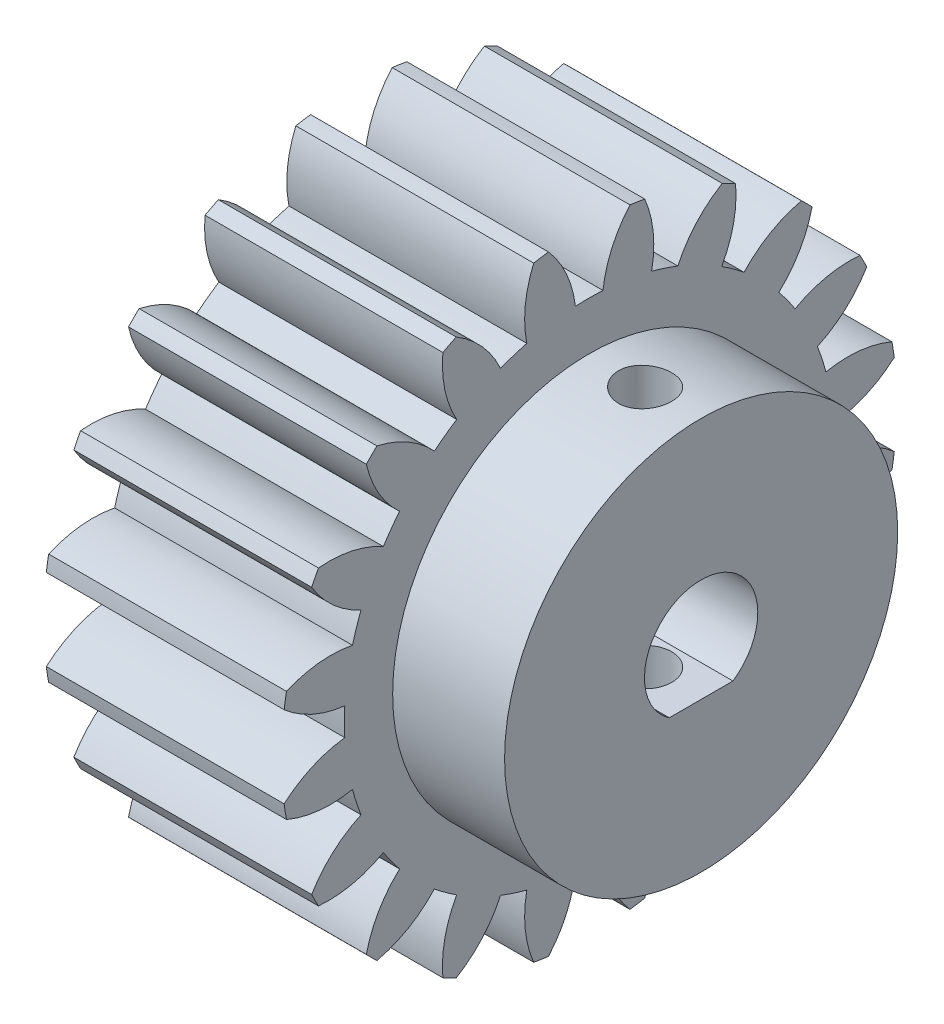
ISO-10303-21;
HEADER;
FILE_DESCRIPTION(('STEP AP214'),'2;1');
FILE_NAME('part.step','',(''),(''),'','','');
FILE_SCHEMA(('AUTOMOTIVE_DESIGN { 1 0 10303 214 1 1 1 1 }'));
ENDSEC;
DATA;
#1=APPLICATION_CONTEXT('core data for automotive mechanical design processes');
#2=APPLICATION_PROTOCOL_DEFINITION('international standard','automotive_design',2000,#1);
#3=PRODUCT_CONTEXT('',#1,'mechanical');
#4=PRODUCT('Part','Part','',(#3));
#5=PRODUCT_RELATED_PRODUCT_CATEGORY('part','',(#4));
#6=PRODUCT_DEFINITION_FORMATION('','',#4);
#7=PRODUCT_DEFINITION_CONTEXT('part definition',#1,'design');
#8=PRODUCT_DEFINITION('design','',#6,#7);
#9=PRODUCT_DEFINITION_SHAPE('','',#8);
#10=(LENGTH_UNIT() NAMED_UNIT(*) SI_UNIT(.MILLI.,.METRE.));
#11=(NAMED_UNIT(*) PLANE_ANGLE_UNIT() SI_UNIT($,.RADIAN.));
#12=(NAMED_UNIT(*) SI_UNIT($,.STERADIAN.) SOLID_ANGLE_UNIT());
#13=UNCERTAINTY_MEASURE_WITH_UNIT(LENGTH_MEASURE(1.E-05),#10,'distance_accuracy_value','');
#14=(GEOMETRIC_REPRESENTATION_CONTEXT(3) GLOBAL_UNCERTAINTY_ASSIGNED_CONTEXT((#13)) GLOBAL_UNIT_ASSIGNED_CONTEXT((#10,
#11,#12)) REPRESENTATION_CONTEXT('',''));
#15=CARTESIAN_POINT('',(0.,0.,0.));
#16=DIRECTION('',(0.,0.,1.));
#17=DIRECTION('',(1.,0.,0.));
#18=AXIS2_PLACEMENT_3D('',#15,#16,#17);
#19=CARTESIAN_POINT('',(50.0000508,0.,0.));
#20=DIRECTION('',(-1.,0.,0.));
#21=DIRECTION('',(0.,0.,1.));
#22=AXIS2_PLACEMENT_3D('',#19,#20,#21);
#23=CYLINDRICAL_SURFACE('',#22,0.4);
#24=CARTESIAN_POINT('',(0.,0.,0.));
#25=DIRECTION('',(1.,0.,0.));
#26=DIRECTION('',(0.,0.,-1.));
#27=AXIS2_PLACEMENT_3D('',#24,#25,#26);
#28=CIRCLE('',#27,0.4);
#29=CARTESIAN_POINT('',(0.,0.,-0.4));
#30=VERTEX_POINT('',#29);
#31=EDGE_CURVE('E992',#30,#30,#28,.F.);
#32=ORIENTED_EDGE('',*,*,#31,.T.);
#33=EDGE_LOOP('',(#32));
#34=FACE_BOUND('',#33,.T.);
#35=CARTESIAN_POINT('',(7.,0.,0.));
#36=DIRECTION('',(1.,0.,0.));
#37=DIRECTION('',(0.,0.,-1.));
#38=AXIS2_PLACEMENT_3D('',#35,#36,#37);
#39=CIRCLE('',#38,0.4);
#40=CARTESIAN_POINT('',(7.,0.,-0.4));
#41=VERTEX_POINT('',#40);
#42=EDGE_CURVE('E47',#41,#41,#39,.T.);
#43=ORIENTED_EDGE('',*,*,#42,.T.);
#44=EDGE_LOOP('',(#43));
#45=FACE_BOUND('',#44,.T.);
#46=ADVANCED_FACE('F44',(#34,#45),#23,.F.);
#47=CARTESIAN_POINT('',(17.,0.,0.));
#48=DIRECTION('',(-1.,0.,0.));
#49=DIRECTION('',(0.,0.,1.));
#50=AXIS2_PLACEMENT_3D('',#47,#48,#49);
#51=PLANE('',#50);
#52=CARTESIAN_POINT('',(17.,8.9313259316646,16.5360305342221));
#53=DIRECTION('',(-1.,0.,0.));
#54=DIRECTION('',(0.,1.,0.));
#55=AXIS2_PLACEMENT_3D('',#52,#53,#54);
#56=CIRCLE('',#55,8.);
#57=CARTESIAN_POINT('',(17.,0.986171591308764,17.471189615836));
#58=VERTEX_POINT('',#57);
#59=CARTESIAN_POINT('',(17.,2.91269635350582,21.8063339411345));
#60=VERTEX_POINT('',#59);
#61=EDGE_CURVE('E1363',#58,#60,#56,.T.);
#62=ORIENTED_EDGE('',*,*,#61,.F.);
#63=CARTESIAN_POINT('',(17.,0.,0.));
#64=DIRECTION('',(-1.,0.,0.));
#65=DIRECTION('',(0.,1.,0.));
#66=AXIS2_PLACEMENT_3D('',#63,#64,#65);
#67=CIRCLE('',#66,17.499);
#68=CARTESIAN_POINT('',(17.,-0.986171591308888,17.471189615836));
#69=VERTEX_POINT('',#68);
#70=EDGE_CURVE('E1374',#69,#58,#67,.T.);
#71=ORIENTED_EDGE('',*,*,#70,.F.);
#72=CARTESIAN_POINT('',(17.,-8.93132593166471,16.536030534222));
#73=DIRECTION('',(-1.,0.,0.));
#74=DIRECTION('',(0.,1.,0.));
#75=AXIS2_PLACEMENT_3D('',#72,#73,#74);
#76=CIRCLE('',#75,8.);
#77=CARTESIAN_POINT('',(17.,-2.91269635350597,21.8063339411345));
#78=VERTEX_POINT('',#77);
#79=EDGE_CURVE('E1366',#78,#69,#76,.T.);
#80=ORIENTED_EDGE('',*,*,#79,.F.);
#81=CARTESIAN_POINT('',(17.,0.,0.));
#82=DIRECTION('',(-1.,0.,0.));
#83=DIRECTION('',(0.,0.,1.));
#84=AXIS2_PLACEMENT_3D('',#81,#82,#83);
#85=CIRCLE('',#84,22.);
#86=CARTESIAN_POINT('',(17.,-3.96838892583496,21.6391286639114));
#87=VERTEX_POINT('',#86);
#88=EDGE_CURVE('E1679',#87,#78,#85,.T.);
#89=ORIENTED_EDGE('',*,*,#88,.F.);
#90=CARTESIAN_POINT('',(17.,3.38428127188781,18.4866310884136));
#91=DIRECTION('',(-1.,0.,0.));
#92=DIRECTION('',(0.,0.951056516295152,0.309016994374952));
#93=AXIS2_PLACEMENT_3D('',#90,#91,#92);
#94=CIRCLE('',#93,8.);
#95=CARTESIAN_POINT('',(17.,-4.46098958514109,16.9208325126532));
#96=VERTEX_POINT('',#95);
#97=EDGE_CURVE('E1341',#96,#87,#94,.T.);
#98=ORIENTED_EDGE('',*,*,#97,.F.);
#99=CARTESIAN_POINT('',(17.,0.,0.));
#100=DIRECTION('',(-1.,0.,0.));
#101=DIRECTION('',(0.,0.951056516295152,0.309016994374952));
#102=AXIS2_PLACEMENT_3D('',#99,#100,#101);
#103=CIRCLE('',#102,17.499);
#104=CARTESIAN_POINT('',(17.,-6.33679942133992,16.3113449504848));
#105=VERTEX_POINT('',#104);
#106=EDGE_CURVE('E1348',#105,#96,#103,.T.);
#107=ORIENTED_EDGE('',*,*,#106,.F.);
#108=CARTESIAN_POINT('',(17.,-13.6041101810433,12.9667680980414));
#109=DIRECTION('',(-1.,0.,0.));
#110=DIRECTION('',(0.,0.951056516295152,0.309016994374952));
#111=AXIS2_PLACEMENT_3D('',#108,#109,#110);
#112=CIRCLE('',#111,8.);
#113=CARTESIAN_POINT('',(17.,-9.50866661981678,19.8389833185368));
#114=VERTEX_POINT('',#113);
#115=EDGE_CURVE('E1349',#114,#105,#112,.T.);
#116=ORIENTED_EDGE('',*,*,#115,.F.);
#117=CARTESIAN_POINT('',(17.,-10.4610206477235,19.3537347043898));
#118=VERTEX_POINT('',#117);
#119=EDGE_CURVE('E1681',#118,#114,#85,.T.);
#120=ORIENTED_EDGE('',*,*,#119,.F.);
#121=CARTESIAN_POINT('',(17.,-2.49404041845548,18.6276313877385));
#122=DIRECTION('',(-1.,0.,0.));
#123=DIRECTION('',(0.,0.809016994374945,0.587785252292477));
#124=AXIS2_PLACEMENT_3D('',#121,#122,#123);
#125=CIRCLE('',#124,8.);
#126=CARTESIAN_POINT('',(17.,-9.47147801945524,14.7141464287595));
#127=VERTEX_POINT('',#126);
#128=EDGE_CURVE('E1317',#127,#118,#125,.T.);
#129=ORIENTED_EDGE('',*,*,#128,.F.);
#130=CARTESIAN_POINT('',(17.,0.,0.));
#131=DIRECTION('',(-1.,0.,0.));
#132=DIRECTION('',(0.,0.809016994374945,0.587785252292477));
#133=AXIS2_PLACEMENT_3D('',#130,#131,#132);
#134=CIRCLE('',#133,17.499);
#135=CARTESIAN_POINT('',(17.,-11.0671371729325,13.5548321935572));
#136=VERTEX_POINT('',#135);
#137=EDGE_CURVE('E1324',#136,#127,#134,.T.);
#138=ORIENTED_EDGE('',*,*,#137,.F.);
#139=CARTESIAN_POINT('',(17.,-16.9452293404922,8.12822805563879));
#140=DIRECTION('',(-1.,0.,0.));
#141=DIRECTION('',(0.,0.809016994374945,0.587785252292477));
#142=AXIS2_PLACEMENT_3D('',#139,#140,#141);
#143=CIRCLE('',#142,8.);
#144=CARTESIAN_POINT('',(17.,-15.1738623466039,15.9296547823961));
#145=VERTEX_POINT('',#144);
#146=EDGE_CURVE('E1325',#145,#136,#143,.T.);
#147=ORIENTED_EDGE('',*,*,#146,.F.);
#148=CARTESIAN_POINT('',(17.,-15.9296547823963,15.1738623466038));
#149=VERTEX_POINT('',#148);
#150=EDGE_CURVE('E1688',#149,#145,#85,.T.);
#151=ORIENTED_EDGE('',*,*,#150,.F.);
#152=CARTESIAN_POINT('',(17.,-8.12822805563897,16.9452293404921));
#153=DIRECTION('',(-1.,0.,0.));
#154=DIRECTION('',(0.,0.587785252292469,0.809016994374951));
#155=AXIS2_PLACEMENT_3D('',#152,#153,#154);
#156=CIRCLE('',#155,8.);
#157=CARTESIAN_POINT('',(17.,-13.5548321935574,11.0671371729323));
#158=VERTEX_POINT('',#157);
#159=EDGE_CURVE('E1294',#158,#149,#156,.T.);
#160=ORIENTED_EDGE('',*,*,#159,.F.);
#161=CARTESIAN_POINT('',(17.,0.,0.));
#162=DIRECTION('',(-1.,0.,0.));
#163=DIRECTION('',(0.,0.587785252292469,0.809016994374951));
#164=AXIS2_PLACEMENT_3D('',#161,#162,#163);
#165=CIRCLE('',#164,17.499);
#166=CARTESIAN_POINT('',(17.,-14.7141464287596,9.47147801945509));
#167=VERTEX_POINT('',#166);
#168=EDGE_CURVE('E1301',#167,#158,#165,.T.);
#169=ORIENTED_EDGE('',*,*,#168,.F.);
#170=CARTESIAN_POINT('',(17.,-18.6276313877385,2.49404041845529));
#171=DIRECTION('',(-1.,0.,0.));
#172=DIRECTION('',(0.,0.587785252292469,0.809016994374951));
#173=AXIS2_PLACEMENT_3D('',#170,#171,#172);
#174=CIRCLE('',#173,8.);
#175=CARTESIAN_POINT('',(17.,-19.3537347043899,10.4610206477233));
#176=VERTEX_POINT('',#175);
#177=EDGE_CURVE('E1300',#176,#167,#174,.T.);
#178=ORIENTED_EDGE('',*,*,#177,.F.);
#179=CARTESIAN_POINT('',(17.,-19.8389833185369,9.50866661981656));
#180=VERTEX_POINT('',#179);
#181=EDGE_CURVE('E1689',#180,#176,#85,.T.);
#182=ORIENTED_EDGE('',*,*,#181,.F.);
#183=CARTESIAN_POINT('',(17.,-12.9667680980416,13.6041101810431));
#184=DIRECTION('',(-1.,0.,0.));
#185=DIRECTION('',(0.,0.309016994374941,0.951056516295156));
#186=AXIS2_PLACEMENT_3D('',#183,#184,#185);
#187=CIRCLE('',#186,8.);
#188=CARTESIAN_POINT('',(17.,-16.3113449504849,6.33679942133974));
#189=VERTEX_POINT('',#188);
#190=EDGE_CURVE('E1274',#189,#180,#187,.T.);
#191=ORIENTED_EDGE('',*,*,#190,.F.);
#192=CARTESIAN_POINT('',(17.,0.,0.));
#193=DIRECTION('',(-1.,0.,0.));
#194=DIRECTION('',(0.,0.309016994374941,0.951056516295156));
#195=AXIS2_PLACEMENT_3D('',#192,#193,#194);
#196=CIRCLE('',#195,17.499);
#197=CARTESIAN_POINT('',(17.,-16.9208325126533,4.4609895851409));
#198=VERTEX_POINT('',#197);
#199=EDGE_CURVE('E1280',#198,#189,#196,.T.);
#200=ORIENTED_EDGE('',*,*,#199,.F.);
#201=CARTESIAN_POINT('',(17.,-18.4866310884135,-3.38428127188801));
#202=DIRECTION('',(-1.,0.,0.));
#203=DIRECTION('',(0.,0.309016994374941,0.951056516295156));
#204=AXIS2_PLACEMENT_3D('',#201,#202,#203);
#205=CIRCLE('',#204,8.);
#206=CARTESIAN_POINT('',(17.,-21.6391286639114,3.96838892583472));
#207=VERTEX_POINT('',#206);
#208=EDGE_CURVE('E1273',#207,#198,#205,.T.);
#209=ORIENTED_EDGE('',*,*,#208,.F.);
#210=CARTESIAN_POINT('',(17.,-21.8063339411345,2.91269635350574));
#211=VERTEX_POINT('',#210);
#212=EDGE_CURVE('E1695',#211,#207,#85,.T.);
#213=ORIENTED_EDGE('',*,*,#212,.F.);
#214=CARTESIAN_POINT('',(17.,-16.5360305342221,8.93132593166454));
#215=DIRECTION('',(-1.,0.,0.));
#216=DIRECTION('',(0.,0.,1.));
#217=AXIS2_PLACEMENT_3D('',#214,#215,#216);
#218=CIRCLE('',#217,8.);
#219=CARTESIAN_POINT('',(17.,-17.471189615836,0.986171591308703));
#220=VERTEX_POINT('',#219);
#221=EDGE_CURVE('E1250',#220,#211,#218,.T.);
#222=ORIENTED_EDGE('',*,*,#221,.F.);
#223=CARTESIAN_POINT('',(17.,0.,0.));
#224=DIRECTION('',(-1.,0.,0.));
#225=DIRECTION('',(0.,0.,1.));
#226=AXIS2_PLACEMENT_3D('',#223,#224,#225);
#227=CIRCLE('',#226,17.499);
#228=CARTESIAN_POINT('',(17.,-17.471189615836,-0.986171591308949));
#229=VERTEX_POINT('',#228);
#230=EDGE_CURVE('E1252',#229,#220,#227,.T.);
#231=ORIENTED_EDGE('',*,*,#230,.F.);
#232=CARTESIAN_POINT('',(17.,-16.536030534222,-8.93132593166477));
#233=DIRECTION('',(-1.,0.,0.));
#234=DIRECTION('',(0.,0.,1.));
#235=AXIS2_PLACEMENT_3D('',#232,#233,#234);
#236=CIRCLE('',#235,8.);
#237=CARTESIAN_POINT('',(17.,-21.8063339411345,-2.91269635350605));
#238=VERTEX_POINT('',#237);
#239=EDGE_CURVE('E1249',#238,#229,#236,.T.);
#240=ORIENTED_EDGE('',*,*,#239,.F.);
#241=CARTESIAN_POINT('',(17.,-21.6391286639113,-3.96838892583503));
#242=VERTEX_POINT('',#241);
#243=EDGE_CURVE('E1694',#242,#238,#85,.T.);
#244=ORIENTED_EDGE('',*,*,#243,.F.);
#245=CARTESIAN_POINT('',(17.,-18.4866310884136,3.38428127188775));
#246=DIRECTION('',(-1.,0.,0.));
#247=DIRECTION('',(0.,-0.309016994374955,0.951056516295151));
#248=AXIS2_PLACEMENT_3D('',#245,#246,#247);
#249=CIRCLE('',#248,8.);
#250=CARTESIAN_POINT('',(17.,-16.9208325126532,-4.46098958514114));
#251=VERTEX_POINT('',#250);
#252=EDGE_CURVE('E1225',#251,#242,#249,.T.);
#253=ORIENTED_EDGE('',*,*,#252,.F.);
#254=CARTESIAN_POINT('',(17.,0.,0.));
#255=DIRECTION('',(-1.,0.,0.));
#256=DIRECTION('',(0.,-0.309016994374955,0.951056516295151));
#257=AXIS2_PLACEMENT_3D('',#254,#255,#256);
#258=CIRCLE('',#257,17.499);
#259=CARTESIAN_POINT('',(17.,-16.3113449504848,-6.33679942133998));
#260=VERTEX_POINT('',#259);
#261=EDGE_CURVE('E1228',#260,#251,#258,.T.);
#262=ORIENTED_EDGE('',*,*,#261,.F.);
#263=CARTESIAN_POINT('',(17.,-12.9667680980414,-13.6041101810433));
#264=DIRECTION('',(-1.,0.,0.));
#265=DIRECTION('',(0.,-0.309016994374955,0.951056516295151));
#266=AXIS2_PLACEMENT_3D('',#263,#264,#265);
#267=CIRCLE('',#266,8.);
#268=CARTESIAN_POINT('',(17.,-19.8389833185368,-9.50866661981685));
#269=VERTEX_POINT('',#268);
#270=EDGE_CURVE('E1226',#269,#260,#267,.T.);
#271=ORIENTED_EDGE('',*,*,#270,.F.);
#272=CARTESIAN_POINT('',(17.,-19.3537347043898,-10.4610206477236));
#273=VERTEX_POINT('',#272);
#274=EDGE_CURVE('E1698',#273,#269,#85,.T.);
#275=ORIENTED_EDGE('',*,*,#274,.F.);
#276=CARTESIAN_POINT('',(17.,-18.6276313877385,-2.49404041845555));
#277=DIRECTION('',(-1.,0.,0.));
#278=DIRECTION('',(0.,-0.58778525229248,0.809016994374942));
#279=AXIS2_PLACEMENT_3D('',#276,#277,#278);
#280=CIRCLE('',#279,8.);
#281=CARTESIAN_POINT('',(17.,-14.7141464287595,-9.4714780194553));
#282=VERTEX_POINT('',#281);
#283=EDGE_CURVE('E1198',#282,#273,#280,.T.);
#284=ORIENTED_EDGE('',*,*,#283,.F.);
#285=CARTESIAN_POINT('',(17.,0.,0.));
#286=DIRECTION('',(-1.,0.,0.));
#287=DIRECTION('',(0.,-0.58778525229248,0.809016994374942));
#288=AXIS2_PLACEMENT_3D('',#285,#286,#287);
#289=CIRCLE('',#288,17.499);
#290=CARTESIAN_POINT('',(17.,-13.5548321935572,-11.0671371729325));
#291=VERTEX_POINT('',#290);
#292=EDGE_CURVE('E1204',#291,#282,#289,.T.);
#293=ORIENTED_EDGE('',*,*,#292,.F.);
#294=CARTESIAN_POINT('',(17.,-8.12822805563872,-16.9452293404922));
#295=DIRECTION('',(-1.,0.,0.));
#296=DIRECTION('',(0.,-0.58778525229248,0.809016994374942));
#297=AXIS2_PLACEMENT_3D('',#294,#295,#296);
#298=CIRCLE('',#297,8.);
#299=CARTESIAN_POINT('',(17.,-15.929654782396,-15.173862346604));
#300=VERTEX_POINT('',#299);
#301=EDGE_CURVE('E1205',#300,#291,#298,.T.);
#302=ORIENTED_EDGE('',*,*,#301,.F.);
#303=CARTESIAN_POINT('',(17.,-15.1738623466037,-15.9296547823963));
#304=VERTEX_POINT('',#303);
#305=EDGE_CURVE('E1701',#304,#300,#85,.T.);
#306=ORIENTED_EDGE('',*,*,#305,.F.);
#307=CARTESIAN_POINT('',(17.,-16.945229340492,-8.12822805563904));
#308=DIRECTION('',(-1.,0.,0.));
#309=DIRECTION('',(0.,-0.809016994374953,0.587785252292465));
#310=AXIS2_PLACEMENT_3D('',#307,#308,#309);
#311=CIRCLE('',#310,8.);
#312=CARTESIAN_POINT('',(17.,-11.0671371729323,-13.5548321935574));
#313=VERTEX_POINT('',#312);
#314=EDGE_CURVE('E1174',#313,#304,#311,.T.);
#315=ORIENTED_EDGE('',*,*,#314,.F.);
#316=CARTESIAN_POINT('',(17.,0.,0.));
#317=DIRECTION('',(-1.,0.,0.));
#318=DIRECTION('',(0.,-0.809016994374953,0.587785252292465));
#319=AXIS2_PLACEMENT_3D('',#316,#317,#318);
#320=CIRCLE('',#319,17.499);
#321=CARTESIAN_POINT('',(17.,-9.47147801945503,-14.7141464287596));
#322=VERTEX_POINT('',#321);
#323=EDGE_CURVE('E1182',#322,#313,#320,.T.);
#324=ORIENTED_EDGE('',*,*,#323,.F.);
#325=CARTESIAN_POINT('',(17.,-2.49404041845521,-18.6276313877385));
#326=DIRECTION('',(-1.,0.,0.));
#327=DIRECTION('',(0.,-0.809016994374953,0.587785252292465));
#328=AXIS2_PLACEMENT_3D('',#325,#326,#327);
#329=CIRCLE('',#328,8.);
#330=CARTESIAN_POINT('',(17.,-10.4610206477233,-19.3537347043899));
#331=VERTEX_POINT('',#330);
#332=EDGE_CURVE('E1177',#331,#322,#329,.T.);
#333=ORIENTED_EDGE('',*,*,#332,.F.);
#334=CARTESIAN_POINT('',(17.,-9.5086666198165,-19.8389833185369));
#335=VERTEX_POINT('',#334);
#336=EDGE_CURVE('E921',#335,#331,#85,.T.);
#337=ORIENTED_EDGE('',*,*,#336,.F.);
#338=CARTESIAN_POINT('',(17.,-13.6041101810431,-12.9667680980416));
#339=DIRECTION('',(-1.,0.,0.));
#340=DIRECTION('',(0.,-0.951056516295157,0.309016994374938));
#341=AXIS2_PLACEMENT_3D('',#338,#339,#340);
#342=CIRCLE('',#341,8.);
#343=CARTESIAN_POINT('',(17.,-6.33679942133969,-16.3113449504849));
#344=VERTEX_POINT('',#343);
#345=EDGE_CURVE('E1151',#344,#335,#342,.T.);
#346=ORIENTED_EDGE('',*,*,#345,.F.);
#347=CARTESIAN_POINT('',(17.,0.,0.));
#348=DIRECTION('',(-1.,0.,0.));
#349=DIRECTION('',(0.,-0.951056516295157,0.309016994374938));
#350=AXIS2_PLACEMENT_3D('',#347,#348,#349);
#351=CIRCLE('',#350,17.499);
#352=CARTESIAN_POINT('',(17.,-4.46098958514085,-16.9208325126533));
#353=VERTEX_POINT('',#352);
#354=EDGE_CURVE('E1157',#353,#344,#351,.T.);
#355=ORIENTED_EDGE('',*,*,#354,.F.);
#356=CARTESIAN_POINT('',(17.,3.38428127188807,-18.4866310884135));
#357=DIRECTION('',(-1.,0.,0.));
#358=DIRECTION('',(0.,-0.951056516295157,0.309016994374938));
#359=AXIS2_PLACEMENT_3D('',#356,#357,#358);
#360=CIRCLE('',#359,8.);
#361=CARTESIAN_POINT('',(17.,-3.96838892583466,-21.6391286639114));
#362=VERTEX_POINT('',#361);
#363=EDGE_CURVE('E1153',#362,#353,#360,.T.);
#364=ORIENTED_EDGE('',*,*,#363,.F.);
#365=CARTESIAN_POINT('',(17.,-2.91269635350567,-21.8063339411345));
#366=VERTEX_POINT('',#365);
#367=EDGE_CURVE('E913',#366,#362,#85,.T.);
#368=ORIENTED_EDGE('',*,*,#367,.F.);
#369=CARTESIAN_POINT('',(17.,-8.93132593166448,-16.5360305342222));
#370=DIRECTION('',(-1.,0.,0.));
#371=DIRECTION('',(0.,-1.,0.));
#372=AXIS2_PLACEMENT_3D('',#369,#370,#371);
#373=CIRCLE('',#372,8.);
#374=CARTESIAN_POINT('',(17.,-0.986171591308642,-17.471189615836));
#375=VERTEX_POINT('',#374);
#376=EDGE_CURVE('E1127',#375,#366,#373,.T.);
#377=ORIENTED_EDGE('',*,*,#376,.F.);
#378=CARTESIAN_POINT('',(17.,0.,0.));
#379=DIRECTION('',(-1.,0.,0.));
#380=DIRECTION('',(0.,-1.,0.));
#381=AXIS2_PLACEMENT_3D('',#378,#379,#380);
#382=CIRCLE('',#381,17.499);
#383=CARTESIAN_POINT('',(17.,0.98617159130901,-17.471189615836));
#384=VERTEX_POINT('',#383);
#385=EDGE_CURVE('E1131',#384,#375,#382,.T.);
#386=ORIENTED_EDGE('',*,*,#385,.F.);
#387=CARTESIAN_POINT('',(17.,8.93132593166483,-16.536030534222));
#388=DIRECTION('',(-1.,0.,0.));
#389=DIRECTION('',(0.,-1.,0.));
#390=AXIS2_PLACEMENT_3D('',#387,#388,#389);
#391=CIRCLE('',#390,8.);
#392=CARTESIAN_POINT('',(17.,2.91269635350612,-21.8063339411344));
#393=VERTEX_POINT('',#392);
#394=EDGE_CURVE('E915',#393,#384,#391,.T.);
#395=ORIENTED_EDGE('',*,*,#394,.F.);
#396=CARTESIAN_POINT('',(17.,3.96838892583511,-21.6391286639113));
#397=VERTEX_POINT('',#396);
#398=EDGE_CURVE('E899',#397,#393,#85,.T.);
#399=ORIENTED_EDGE('',*,*,#398,.F.);
#400=CARTESIAN_POINT('',(17.,-3.38428127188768,-18.4866310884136));
#401=DIRECTION('',(-1.,0.,0.));
#402=DIRECTION('',(0.,-0.95105651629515,-0.309016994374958));
#403=AXIS2_PLACEMENT_3D('',#400,#401,#402);
#404=CIRCLE('',#403,8.);
#405=CARTESIAN_POINT('',(17.,4.4609895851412,-16.9208325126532));
#406=VERTEX_POINT('',#405);
#407=EDGE_CURVE('E908',#406,#397,#404,.T.);
#408=ORIENTED_EDGE('',*,*,#407,.F.);
#409=CARTESIAN_POINT('',(17.,0.,0.));
#410=DIRECTION('',(-1.,0.,0.));
#411=DIRECTION('',(0.,-0.95105651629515,-0.309016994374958));
#412=AXIS2_PLACEMENT_3D('',#409,#410,#411);
#413=CIRCLE('',#412,17.499);
#414=CARTESIAN_POINT('',(17.,6.33679942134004,-16.3113449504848));
#415=VERTEX_POINT('',#414);
#416=EDGE_CURVE('E1108',#415,#406,#413,.T.);
#417=ORIENTED_EDGE('',*,*,#416,.F.);
#418=CARTESIAN_POINT('',(17.,13.6041101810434,-12.9667680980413));
#419=DIRECTION('',(-1.,0.,0.));
#420=DIRECTION('',(0.,-0.95105651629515,-0.309016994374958));
#421=AXIS2_PLACEMENT_3D('',#418,#419,#420);
#422=CIRCLE('',#421,8.);
#423=CARTESIAN_POINT('',(17.,9.50866661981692,-19.8389833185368));
#424=VERTEX_POINT('',#423);
#425=EDGE_CURVE('E1110',#424,#415,#422,.T.);
#426=ORIENTED_EDGE('',*,*,#425,.F.);
#427=CARTESIAN_POINT('',(17.,10.4610206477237,-19.3537347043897));
#428=VERTEX_POINT('',#427);
#429=EDGE_CURVE('E911',#428,#424,#85,.T.);
#430=ORIENTED_EDGE('',*,*,#429,.F.);
#431=CARTESIAN_POINT('',(17.,2.49404041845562,-18.6276313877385));
#432=DIRECTION('',(-1.,0.,0.));
#433=DIRECTION('',(0.,-0.80901699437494,-0.587785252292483));
#434=AXIS2_PLACEMENT_3D('',#431,#432,#433);
#435=CIRCLE('',#434,8.);
#436=CARTESIAN_POINT('',(17.,9.47147801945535,-14.7141464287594));
#437=VERTEX_POINT('',#436);
#438=EDGE_CURVE('E1082',#437,#428,#435,.T.);
#439=ORIENTED_EDGE('',*,*,#438,.F.);
#440=CARTESIAN_POINT('',(17.,0.,0.));
#441=DIRECTION('',(-1.,0.,0.));
#442=DIRECTION('',(0.,-0.80901699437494,-0.587785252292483));
#443=AXIS2_PLACEMENT_3D('',#440,#441,#442);
#444=CIRCLE('',#443,17.499);
#445=CARTESIAN_POINT('',(17.,11.0671371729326,-13.5548321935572));
#446=VERTEX_POINT('',#445);
#447=EDGE_CURVE('E1086',#446,#437,#444,.T.);
#448=ORIENTED_EDGE('',*,*,#447,.F.);
#449=CARTESIAN_POINT('',(17.,16.9452293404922,-8.12822805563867));
#450=DIRECTION('',(-1.,0.,0.));
#451=DIRECTION('',(0.,-0.80901699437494,-0.587785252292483));
#452=AXIS2_PLACEMENT_3D('',#449,#450,#451);
#453=CIRCLE('',#452,8.);
#454=CARTESIAN_POINT('',(17.,15.173862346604,-15.929654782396));
#455=VERTEX_POINT('',#454);
#456=EDGE_CURVE('E1084',#455,#446,#453,.T.);
#457=ORIENTED_EDGE('',*,*,#456,.F.);
#458=CARTESIAN_POINT('',(17.,15.9296547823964,-15.1738623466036));
#459=VERTEX_POINT('',#458);
#460=EDGE_CURVE('E919',#459,#455,#85,.T.);
#461=ORIENTED_EDGE('',*,*,#460,.F.);
#462=CARTESIAN_POINT('',(17.,8.1282280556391,-16.945229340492));
#463=DIRECTION('',(-1.,0.,0.));
#464=DIRECTION('',(0.,-0.587785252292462,-0.809016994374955));
#465=AXIS2_PLACEMENT_3D('',#462,#463,#464);
#466=CIRCLE('',#465,8.);
#467=CARTESIAN_POINT('',(17.,13.5548321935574,-11.0671371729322));
#468=VERTEX_POINT('',#467);
#469=EDGE_CURVE('E1056',#468,#459,#466,.T.);
#470=ORIENTED_EDGE('',*,*,#469,.F.);
#471=CARTESIAN_POINT('',(17.,0.,0.));
#472=DIRECTION('',(-1.,0.,0.));
#473=DIRECTION('',(0.,-0.587785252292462,-0.809016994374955));
#474=AXIS2_PLACEMENT_3D('',#471,#472,#473);
#475=CIRCLE('',#474,17.499);
#476=CARTESIAN_POINT('',(17.,14.7141464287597,-9.47147801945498));
#477=VERTEX_POINT('',#476);
#478=EDGE_CURVE('E1061',#477,#468,#475,.T.);
#479=ORIENTED_EDGE('',*,*,#478,.F.);
#480=CARTESIAN_POINT('',(17.,18.6276313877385,-2.49404041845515));
#481=DIRECTION('',(-1.,0.,0.));
#482=DIRECTION('',(0.,-0.587785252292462,-0.809016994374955));
#483=AXIS2_PLACEMENT_3D('',#480,#481,#482);
#484=CIRCLE('',#483,8.);
#485=CARTESIAN_POINT('',(17.,19.35373470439,-10.4610206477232));
#486=VERTEX_POINT('',#485);
#487=EDGE_CURVE('E1062',#486,#477,#484,.T.);
#488=ORIENTED_EDGE('',*,*,#487,.F.);
#489=CARTESIAN_POINT('',(17.,19.838983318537,-9.50866661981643));
#490=VERTEX_POINT('',#489);
#491=EDGE_CURVE('E928',#490,#486,#85,.T.);
#492=ORIENTED_EDGE('',*,*,#491,.F.);
#493=CARTESIAN_POINT('',(17.,12.9667680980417,-13.604110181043));
#494=DIRECTION('',(-1.,0.,0.));
#495=DIRECTION('',(0.,-0.309016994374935,-0.951056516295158));
#496=AXIS2_PLACEMENT_3D('',#493,#494,#495);
#497=CIRCLE('',#496,8.);
#498=CARTESIAN_POINT('',(17.,16.3113449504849,-6.33679942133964));
#499=VERTEX_POINT('',#498);
#500=EDGE_CURVE('E1031',#499,#490,#497,.T.);
#501=ORIENTED_EDGE('',*,*,#500,.F.);
#502=CARTESIAN_POINT('',(17.,0.,0.));
#503=DIRECTION('',(-1.,0.,0.));
#504=DIRECTION('',(0.,-0.309016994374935,-0.951056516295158));
#505=AXIS2_PLACEMENT_3D('',#502,#503,#504);
#506=CIRCLE('',#505,17.499);
#507=CARTESIAN_POINT('',(17.,16.9208325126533,-4.46098958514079));
#508=VERTEX_POINT('',#507);
#509=EDGE_CURVE('E1038',#508,#499,#506,.T.);
#510=ORIENTED_EDGE('',*,*,#509,.F.);
#511=CARTESIAN_POINT('',(17.,18.4866310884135,3.38428127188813));
#512=DIRECTION('',(-1.,0.,0.));
#513=DIRECTION('',(0.,-0.309016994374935,-0.951056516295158));
#514=AXIS2_PLACEMENT_3D('',#511,#512,#513);
#515=CIRCLE('',#514,8.);
#516=CARTESIAN_POINT('',(17.,21.6391286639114,-3.96838892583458));
#517=VERTEX_POINT('',#516);
#518=EDGE_CURVE('E1040',#517,#508,#515,.T.);
#519=ORIENTED_EDGE('',*,*,#518,.F.);
#520=CARTESIAN_POINT('',(17.,21.8063339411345,-2.9126963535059));
#521=VERTEX_POINT('',#520);
#522=EDGE_CURVE('E925',#521,#517,#85,.T.);
#523=ORIENTED_EDGE('',*,*,#522,.F.);
#524=CARTESIAN_POINT('',(17.,16.5360305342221,-8.93132593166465));
#525=DIRECTION('',(-1.,0.,0.));
#526=DIRECTION('',(0.,0.,-1.));
#527=AXIS2_PLACEMENT_3D('',#524,#525,#526);
#528=CIRCLE('',#527,8.);
#529=CARTESIAN_POINT('',(17.,17.471189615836,-0.986171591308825));
#530=VERTEX_POINT('',#529);
#531=EDGE_CURVE('E1593',#530,#521,#528,.T.);
#532=ORIENTED_EDGE('',*,*,#531,.F.);
#533=CARTESIAN_POINT('',(17.,0.,0.));
#534=DIRECTION('',(-1.,0.,0.));
#535=DIRECTION('',(0.,0.,-1.));
#536=AXIS2_PLACEMENT_3D('',#533,#534,#535);
#537=CIRCLE('',#536,17.499);
#538=CARTESIAN_POINT('',(17.,17.471189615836,0.986171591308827));
#539=VERTEX_POINT('',#538);
#540=EDGE_CURVE('E1596',#539,#530,#537,.T.);
#541=ORIENTED_EDGE('',*,*,#540,.F.);
#542=CARTESIAN_POINT('',(17.,16.5360305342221,8.93132593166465));
#543=DIRECTION('',(-1.,0.,0.));
#544=DIRECTION('',(0.,0.,-1.));
#545=AXIS2_PLACEMENT_3D('',#542,#543,#544);
#546=CIRCLE('',#545,8.);
#547=CARTESIAN_POINT('',(17.,21.8063339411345,2.9126963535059));
#548=VERTEX_POINT('',#547);
#549=EDGE_CURVE('E1592',#548,#539,#546,.T.);
#550=ORIENTED_EDGE('',*,*,#549,.F.);
#551=CARTESIAN_POINT('',(17.,21.6391286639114,3.96838892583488));
#552=VERTEX_POINT('',#551);
#553=EDGE_CURVE('E933',#552,#548,#85,.T.);
#554=ORIENTED_EDGE('',*,*,#553,.F.);
#555=CARTESIAN_POINT('',(17.,18.4866310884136,-3.38428127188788));
#556=DIRECTION('',(-1.,0.,0.));
#557=DIRECTION('',(0.,0.309016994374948,-0.951056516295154));
#558=AXIS2_PLACEMENT_3D('',#555,#556,#557);
#559=CIRCLE('',#558,8.);
#560=CARTESIAN_POINT('',(17.,16.9208325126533,4.46098958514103));
#561=VERTEX_POINT('',#560);
#562=EDGE_CURVE('E1558',#561,#552,#559,.T.);
#563=ORIENTED_EDGE('',*,*,#562,.F.);
#564=CARTESIAN_POINT('',(17.,0.,0.));
#565=DIRECTION('',(-1.,0.,0.));
#566=DIRECTION('',(0.,0.309016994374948,-0.951056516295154));
#567=AXIS2_PLACEMENT_3D('',#564,#565,#566);
#568=CIRCLE('',#567,17.499);
#569=CARTESIAN_POINT('',(17.,16.3113449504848,6.33679942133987));
#570=VERTEX_POINT('',#569);
#571=EDGE_CURVE('E1568',#570,#561,#568,.T.);
#572=ORIENTED_EDGE('',*,*,#571,.F.);
#573=CARTESIAN_POINT('',(17.,12.9667680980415,13.6041101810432));
#574=DIRECTION('',(-1.,0.,0.));
#575=DIRECTION('',(0.,0.309016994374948,-0.951056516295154));
#576=AXIS2_PLACEMENT_3D('',#573,#574,#575);
#577=CIRCLE('',#576,8.);
#578=CARTESIAN_POINT('',(17.,19.8389833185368,9.5086666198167));
#579=VERTEX_POINT('',#578);
#580=EDGE_CURVE('E1564',#579,#570,#577,.T.);
#581=ORIENTED_EDGE('',*,*,#580,.F.);
#582=CARTESIAN_POINT('',(17.,19.3537347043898,10.4610206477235));
#583=VERTEX_POINT('',#582);
#584=EDGE_CURVE('E929',#583,#579,#85,.T.);
#585=ORIENTED_EDGE('',*,*,#584,.F.);
#586=CARTESIAN_POINT('',(17.,18.6276313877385,2.49404041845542));
#587=DIRECTION('',(-1.,0.,0.));
#588=DIRECTION('',(0.,0.587785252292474,-0.809016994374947));
#589=AXIS2_PLACEMENT_3D('',#586,#587,#588);
#590=CIRCLE('',#589,8.);
#591=CARTESIAN_POINT('',(17.,14.7141464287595,9.47147801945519));
#592=VERTEX_POINT('',#591);
#593=EDGE_CURVE('E1431',#592,#583,#590,.T.);
#594=ORIENTED_EDGE('',*,*,#593,.F.);
#595=CARTESIAN_POINT('',(17.,0.,0.));
#596=DIRECTION('',(-1.,0.,0.));
#597=DIRECTION('',(0.,0.587785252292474,-0.809016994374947));
#598=AXIS2_PLACEMENT_3D('',#595,#596,#597);
#599=CIRCLE('',#598,17.499);
#600=CARTESIAN_POINT('',(17.,13.5548321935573,11.0671371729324));
#601=VERTEX_POINT('',#600);
#602=EDGE_CURVE('E1436',#601,#592,#599,.T.);
#603=ORIENTED_EDGE('',*,*,#602,.F.);
#604=CARTESIAN_POINT('',(17.,8.12822805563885,16.9452293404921));
#605=DIRECTION('',(-1.,0.,0.));
#606=DIRECTION('',(0.,0.587785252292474,-0.809016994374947));
#607=AXIS2_PLACEMENT_3D('',#604,#605,#606);
#608=CIRCLE('',#607,8.);
#609=CARTESIAN_POINT('',(17.,15.9296547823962,15.1738623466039));
#610=VERTEX_POINT('',#609);
#611=EDGE_CURVE('E1437',#610,#601,#608,.T.);
#612=ORIENTED_EDGE('',*,*,#611,.F.);
#613=CARTESIAN_POINT('',(17.,15.1738623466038,15.9296547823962));
#614=VERTEX_POINT('',#613);
#615=EDGE_CURVE('E1674',#614,#610,#85,.T.);
#616=ORIENTED_EDGE('',*,*,#615,.F.);
#617=CARTESIAN_POINT('',(17.,16.9452293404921,8.12822805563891));
#618=DIRECTION('',(-1.,0.,0.));
#619=DIRECTION('',(0.,0.809016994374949,-0.587785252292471));
#620=AXIS2_PLACEMENT_3D('',#617,#618,#619);
#621=CIRCLE('',#620,8.);
#622=CARTESIAN_POINT('',(17.,11.0671371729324,13.5548321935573));
#623=VERTEX_POINT('',#622);
#624=EDGE_CURVE('E1406',#623,#614,#621,.T.);
#625=ORIENTED_EDGE('',*,*,#624,.F.);
#626=CARTESIAN_POINT('',(17.,0.,0.));
#627=DIRECTION('',(-1.,0.,0.));
#628=DIRECTION('',(0.,0.809016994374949,-0.587785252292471));
#629=AXIS2_PLACEMENT_3D('',#626,#627,#628);
#630=CIRCLE('',#629,17.499);
#631=CARTESIAN_POINT('',(17.,9.47147801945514,14.7141464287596));
#632=VERTEX_POINT('',#631);
#633=EDGE_CURVE('E1413',#632,#623,#630,.T.);
#634=ORIENTED_EDGE('',*,*,#633,.F.);
#635=CARTESIAN_POINT('',(17.,2.49404041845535,18.6276313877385));
#636=DIRECTION('',(-1.,0.,0.));
#637=DIRECTION('',(0.,0.809016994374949,-0.587785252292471));
#638=AXIS2_PLACEMENT_3D('',#635,#636,#637);
#639=CIRCLE('',#638,8.);
#640=CARTESIAN_POINT('',(17.,10.4610206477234,19.3537347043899));
#641=VERTEX_POINT('',#640);
#642=EDGE_CURVE('E1415',#641,#632,#639,.T.);
#643=ORIENTED_EDGE('',*,*,#642,.F.);
#644=CARTESIAN_POINT('',(17.,9.50866661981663,19.8389833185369));
#645=VERTEX_POINT('',#644);
#646=EDGE_CURVE('E1673',#645,#641,#85,.T.);
#647=ORIENTED_EDGE('',*,*,#646,.F.);
#648=CARTESIAN_POINT('',(17.,13.6041101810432,12.9667680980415));
#649=DIRECTION('',(-1.,0.,0.));
#650=DIRECTION('',(0.,0.951056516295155,-0.309016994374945));
#651=AXIS2_PLACEMENT_3D('',#648,#649,#650);
#652=CIRCLE('',#651,8.);
#653=CARTESIAN_POINT('',(17.,6.33679942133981,16.3113449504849));
#654=VERTEX_POINT('',#653);
#655=EDGE_CURVE('E1388',#654,#645,#652,.T.);
#656=ORIENTED_EDGE('',*,*,#655,.F.);
#657=CARTESIAN_POINT('',(17.,0.,0.));
#658=DIRECTION('',(-1.,0.,0.));
#659=DIRECTION('',(0.,0.951056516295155,-0.309016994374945));
#660=AXIS2_PLACEMENT_3D('',#657,#658,#659);
#661=CIRCLE('',#660,17.499);
#662=CARTESIAN_POINT('',(17.,4.46098958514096,16.9208325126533));
#663=VERTEX_POINT('',#662);
#664=EDGE_CURVE('E1395',#663,#654,#661,.T.);
#665=ORIENTED_EDGE('',*,*,#664,.F.);
#666=CARTESIAN_POINT('',(17.,-3.38428127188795,18.4866310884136));
#667=DIRECTION('',(-1.,0.,0.));
#668=DIRECTION('',(0.,0.951056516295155,-0.309016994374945));
#669=AXIS2_PLACEMENT_3D('',#666,#667,#668);
#670=CIRCLE('',#669,8.);
#671=CARTESIAN_POINT('',(17.,3.9683889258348,21.6391286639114));
#672=VERTEX_POINT('',#671);
#673=EDGE_CURVE('E1389',#672,#663,#670,.T.);
#674=ORIENTED_EDGE('',*,*,#673,.F.);
#675=EDGE_CURVE('E1680',#60,#672,#85,.T.);
#676=ORIENTED_EDGE('',*,*,#675,.F.);
#677=EDGE_LOOP('',(#62,#71,#80,#89,#98,#107,#116,#120,#129,#138,#147,#151,#160,#169,#178,#182,
#191,#200,#209,#213,#222,#231,#240,#244,#253,#262,#271,#275,#284,#293,#302,#306,#315,#324,#333,
#337,#346,#355,#364,#368,#377,#386,#395,#399,#408,#417,#426,#430,#439,#448,#457,#461,#470,#479,
#488,#492,#501,#510,#519,#523,#532,#541,#550,#554,#563,#572,#581,#585,#594,#603,#612,#616,#625,
#634,#643,#647,#656,#665,#674,#676));
#678=FACE_BOUND('',#677,.T.);
#679=CARTESIAN_POINT('',(17.,0.,0.));
#680=DIRECTION('',(-1.,0.,0.));
#681=DIRECTION('',(0.,0.,1.));
#682=AXIS2_PLACEMENT_3D('',#679,#680,#681);
#683=CIRCLE('',#682,14.05);
#684=CARTESIAN_POINT('',(17.,0.,14.05));
#685=VERTEX_POINT('',#684);
#686=EDGE_CURVE('E11',#685,#685,#683,.F.);
#687=ORIENTED_EDGE('',*,*,#686,.F.);
#688=EDGE_LOOP('',(#687));
#689=FACE_BOUND('',#688,.T.);
#690=ADVANCED_FACE('F50',(#678,#689),#51,.F.);
#691=CARTESIAN_POINT('',(-10.,0.,0.));
#692=DIRECTION('',(-1.,0.,0.));
#693=DIRECTION('',(0.,0.,1.));
#694=AXIS2_PLACEMENT_3D('',#691,#692,#693);
#695=CYLINDRICAL_SURFACE('',#694,22.);
#696=DIRECTION('',(-1.,0.,0.));
#697=VECTOR('',#696,1.);
#698=CARTESIAN_POINT('',(8.5,2.91269635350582,21.8063339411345));
#699=LINE('',#698,#697);
#700=CARTESIAN_POINT('',(0.,2.91269635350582,21.8063339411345));
#701=VERTEX_POINT('',#700);
#702=EDGE_CURVE('E1547',#60,#701,#699,.T.);
#703=ORIENTED_EDGE('',*,*,#702,.F.);
#704=ORIENTED_EDGE('',*,*,#675,.T.);
#705=DIRECTION('',(-1.,0.,0.));
#706=VECTOR('',#705,1.);
#707=CARTESIAN_POINT('',(8.5,3.9683889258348,21.6391286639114));
#708=LINE('',#707,#706);
#709=CARTESIAN_POINT('',(0.,3.9683889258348,21.6391286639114));
#710=VERTEX_POINT('',#709);
#711=EDGE_CURVE('E1537',#710,#672,#708,.F.);
#712=ORIENTED_EDGE('',*,*,#711,.F.);
#713=CARTESIAN_POINT('',(0.,0.,0.));
#714=DIRECTION('',(-1.,0.,0.));
#715=DIRECTION('',(0.,0.,1.));
#716=AXIS2_PLACEMENT_3D('',#713,#714,#715);
#717=CIRCLE('',#716,22.);
#718=EDGE_CURVE('E1624',#701,#710,#717,.T.);
#719=ORIENTED_EDGE('',*,*,#718,.F.);
#720=EDGE_LOOP('',(#703,#704,#712,#719));
#721=FACE_BOUND('',#720,.T.);
#722=ADVANCED_FACE('F874',(#721),#695,.T.);
#723=DIRECTION('',(-1.,0.,0.));
#724=VECTOR('',#723,1.);
#725=CARTESIAN_POINT('',(8.5,-2.91269635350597,21.8063339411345));
#726=LINE('',#725,#724);
#727=CARTESIAN_POINT('',(0.,-2.91269635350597,21.8063339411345));
#728=VERTEX_POINT('',#727);
#729=EDGE_CURVE('E1546',#728,#78,#726,.F.);
#730=ORIENTED_EDGE('',*,*,#729,.F.);
#731=CARTESIAN_POINT('',(0.,-3.96838892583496,21.6391286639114));
#732=VERTEX_POINT('',#731);
#733=EDGE_CURVE('E1627',#732,#728,#717,.T.);
#734=ORIENTED_EDGE('',*,*,#733,.F.);
#735=DIRECTION('',(-1.,0.,0.));
#736=VECTOR('',#735,1.);
#737=CARTESIAN_POINT('',(8.5,-3.96838892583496,21.6391286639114));
#738=LINE('',#737,#736);
#739=EDGE_CURVE('E1510',#87,#732,#738,.T.);
#740=ORIENTED_EDGE('',*,*,#739,.F.);
#741=ORIENTED_EDGE('',*,*,#88,.T.);
#742=EDGE_LOOP('',(#730,#734,#740,#741));
#743=FACE_BOUND('',#742,.T.);
#744=ADVANCED_FACE('F882',(#743),#695,.T.);
#745=DIRECTION('',(-1.,0.,0.));
#746=VECTOR('',#745,1.);
#747=CARTESIAN_POINT('',(8.5,9.50866661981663,19.8389833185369));
#748=LINE('',#747,#746);
#749=CARTESIAN_POINT('',(0.,9.50866661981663,19.8389833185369));
#750=VERTEX_POINT('',#749);
#751=EDGE_CURVE('E1543',#645,#750,#748,.T.);
#752=ORIENTED_EDGE('',*,*,#751,.F.);
#753=ORIENTED_EDGE('',*,*,#646,.T.);
#754=DIRECTION('',(-1.,0.,0.));
#755=VECTOR('',#754,1.);
#756=CARTESIAN_POINT('',(8.5,10.4610206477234,19.3537347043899));
#757=LINE('',#756,#755);
#758=CARTESIAN_POINT('',(0.,10.4610206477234,19.3537347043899));
#759=VERTEX_POINT('',#758);
#760=EDGE_CURVE('E1527',#759,#641,#757,.F.);
#761=ORIENTED_EDGE('',*,*,#760,.F.);
#762=EDGE_CURVE('E1625',#750,#759,#717,.T.);
#763=ORIENTED_EDGE('',*,*,#762,.F.);
#764=EDGE_LOOP('',(#752,#753,#761,#763));
#765=FACE_BOUND('',#764,.T.);
#766=ADVANCED_FACE('F1838',(#765),#695,.T.);
#767=DIRECTION('',(-1.,0.,0.));
#768=VECTOR('',#767,1.);
#769=CARTESIAN_POINT('',(8.5,19.3537347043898,10.4610206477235));
#770=LINE('',#769,#768);
#771=CARTESIAN_POINT('',(0.,19.3537347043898,10.4610206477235));
#772=VERTEX_POINT('',#771);
#773=EDGE_CURVE('E1540',#583,#772,#770,.T.);
#774=ORIENTED_EDGE('',*,*,#773,.F.);
#775=ORIENTED_EDGE('',*,*,#584,.T.);
#776=DIRECTION('',(-1.,0.,0.));
#777=VECTOR('',#776,1.);
#778=CARTESIAN_POINT('',(8.5,19.8389833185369,9.5086666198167));
#779=LINE('',#778,#777);
#780=CARTESIAN_POINT('',(0.,19.8389833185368,9.5086666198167));
#781=VERTEX_POINT('',#780);
#782=EDGE_CURVE('E1576',#781,#579,#779,.F.);
#783=ORIENTED_EDGE('',*,*,#782,.F.);
#784=EDGE_CURVE('E1616',#772,#781,#717,.T.);
#785=ORIENTED_EDGE('',*,*,#784,.F.);
#786=EDGE_LOOP('',(#774,#775,#783,#785));
#787=FACE_BOUND('',#786,.T.);
#788=ADVANCED_FACE('F1812',(#787),#695,.T.);
#789=DIRECTION('',(-1.,0.,0.));
#790=VECTOR('',#789,1.);
#791=CARTESIAN_POINT('',(8.5,15.9296547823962,15.1738623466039));
#792=LINE('',#791,#790);
#793=CARTESIAN_POINT('',(0.,15.9296547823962,15.1738623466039));
#794=VERTEX_POINT('',#793);
#795=EDGE_CURVE('E1535',#794,#610,#792,.F.);
#796=ORIENTED_EDGE('',*,*,#795,.F.);
#797=CARTESIAN_POINT('',(0.,15.1738623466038,15.9296547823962));
#798=VERTEX_POINT('',#797);
#799=EDGE_CURVE('E1617',#798,#794,#717,.T.);
#800=ORIENTED_EDGE('',*,*,#799,.F.);
#801=DIRECTION('',(-1.,0.,0.));
#802=VECTOR('',#801,1.);
#803=CARTESIAN_POINT('',(8.5,15.1738623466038,15.9296547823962));
#804=LINE('',#803,#802);
#805=EDGE_CURVE('E1533',#614,#798,#804,.T.);
#806=ORIENTED_EDGE('',*,*,#805,.F.);
#807=ORIENTED_EDGE('',*,*,#615,.T.);
#808=EDGE_LOOP('',(#796,#800,#806,#807));
#809=FACE_BOUND('',#808,.T.);
#810=ADVANCED_FACE('F1825',(#809),#695,.T.);
#811=DIRECTION('',(-1.,0.,0.));
#812=VECTOR('',#811,1.);
#813=CARTESIAN_POINT('',(8.5,-15.9296547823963,15.1738623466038));
#814=LINE('',#813,#812);
#815=CARTESIAN_POINT('',(0.,-15.9296547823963,15.1738623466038));
#816=VERTEX_POINT('',#815);
#817=EDGE_CURVE('E1522',#149,#816,#814,.T.);
#818=ORIENTED_EDGE('',*,*,#817,.F.);
#819=ORIENTED_EDGE('',*,*,#150,.T.);
#820=DIRECTION('',(-1.,0.,0.));
#821=VECTOR('',#820,1.);
#822=CARTESIAN_POINT('',(8.5,-15.1738623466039,15.9296547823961));
#823=LINE('',#822,#821);
#824=CARTESIAN_POINT('',(0.,-15.1738623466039,15.9296547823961));
#825=VERTEX_POINT('',#824);
#826=EDGE_CURVE('E1500',#825,#145,#823,.F.);
#827=ORIENTED_EDGE('',*,*,#826,.F.);
#828=EDGE_CURVE('E1631',#816,#825,#717,.T.);
#829=ORIENTED_EDGE('',*,*,#828,.F.);
#830=EDGE_LOOP('',(#818,#819,#827,#829));
#831=FACE_BOUND('',#830,.T.);
#832=ADVANCED_FACE('F1885',(#831),#695,.T.);
#833=DIRECTION('',(-1.,0.,0.));
#834=VECTOR('',#833,1.);
#835=CARTESIAN_POINT('',(8.5,-19.3537347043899,10.4610206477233));
#836=LINE('',#835,#834);
#837=CARTESIAN_POINT('',(0.,-19.3537347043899,10.4610206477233));
#838=VERTEX_POINT('',#837);
#839=EDGE_CURVE('E1521',#838,#176,#836,.F.);
#840=ORIENTED_EDGE('',*,*,#839,.F.);
#841=CARTESIAN_POINT('',(0.,-19.8389833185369,9.50866661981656));
#842=VERTEX_POINT('',#841);
#843=EDGE_CURVE('E1640',#842,#838,#717,.T.);
#844=ORIENTED_EDGE('',*,*,#843,.F.);
#845=DIRECTION('',(-1.,0.,0.));
#846=VECTOR('',#845,1.);
#847=CARTESIAN_POINT('',(8.5,-19.8389833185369,9.50866661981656));
#848=LINE('',#847,#846);
#849=EDGE_CURVE('E1517',#180,#842,#848,.T.);
#850=ORIENTED_EDGE('',*,*,#849,.F.);
#851=ORIENTED_EDGE('',*,*,#181,.T.);
#852=EDGE_LOOP('',(#840,#844,#850,#851));
#853=FACE_BOUND('',#852,.T.);
#854=ADVANCED_FACE('F1894',(#853),#695,.T.);
#855=DIRECTION('',(-1.,0.,0.));
#856=VECTOR('',#855,1.);
#857=CARTESIAN_POINT('',(8.5,-21.6391286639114,3.96838892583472));
#858=LINE('',#857,#856);
#859=CARTESIAN_POINT('',(0.,-21.6391286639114,3.96838892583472));
#860=VERTEX_POINT('',#859);
#861=EDGE_CURVE('E1518',#860,#207,#858,.F.);
#862=ORIENTED_EDGE('',*,*,#861,.F.);
#863=CARTESIAN_POINT('',(0.,-21.8063339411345,2.91269635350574));
#864=VERTEX_POINT('',#863);
#865=EDGE_CURVE('E1638',#864,#860,#717,.T.);
#866=ORIENTED_EDGE('',*,*,#865,.F.);
#867=DIRECTION('',(-1.,0.,0.));
#868=VECTOR('',#867,1.);
#869=CARTESIAN_POINT('',(8.5,-21.8063339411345,2.91269635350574));
#870=LINE('',#869,#868);
#871=EDGE_CURVE('E1514',#211,#864,#870,.T.);
#872=ORIENTED_EDGE('',*,*,#871,.F.);
#873=ORIENTED_EDGE('',*,*,#212,.T.);
#874=EDGE_LOOP('',(#862,#866,#872,#873));
#875=FACE_BOUND('',#874,.T.);
#876=ADVANCED_FACE('F1906',(#875),#695,.T.);
#877=DIRECTION('',(-1.,0.,0.));
#878=VECTOR('',#877,1.);
#879=CARTESIAN_POINT('',(8.5,-21.8063339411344,-2.91269635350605));
#880=LINE('',#879,#878);
#881=CARTESIAN_POINT('',(0.,-21.8063339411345,-2.91269635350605));
#882=VERTEX_POINT('',#881);
#883=EDGE_CURVE('E1508',#882,#238,#880,.F.);
#884=ORIENTED_EDGE('',*,*,#883,.F.);
#885=CARTESIAN_POINT('',(0.,-21.6391286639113,-3.96838892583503));
#886=VERTEX_POINT('',#885);
#887=EDGE_CURVE('E1641',#886,#882,#717,.T.);
#888=ORIENTED_EDGE('',*,*,#887,.F.);
#889=DIRECTION('',(-1.,0.,0.));
#890=VECTOR('',#889,1.);
#891=CARTESIAN_POINT('',(8.5,-21.6391286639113,-3.96838892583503));
#892=LINE('',#891,#890);
#893=EDGE_CURVE('E1484',#242,#886,#892,.T.);
#894=ORIENTED_EDGE('',*,*,#893,.F.);
#895=ORIENTED_EDGE('',*,*,#243,.T.);
#896=EDGE_LOOP('',(#884,#888,#894,#895));
#897=FACE_BOUND('',#896,.T.);
#898=ADVANCED_FACE('F1921',(#897),#695,.T.);
#899=DIRECTION('',(-1.,0.,0.));
#900=VECTOR('',#899,1.);
#901=CARTESIAN_POINT('',(8.5,-9.50866661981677,19.8389833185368));
#902=LINE('',#901,#900);
#903=CARTESIAN_POINT('',(0.,-9.50866661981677,19.8389833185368));
#904=VERTEX_POINT('',#903);
#905=EDGE_CURVE('E1503',#904,#114,#902,.F.);
#906=ORIENTED_EDGE('',*,*,#905,.F.);
#907=CARTESIAN_POINT('',(0.,-10.4610206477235,19.3537347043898));
#908=VERTEX_POINT('',#907);
#909=EDGE_CURVE('E1632',#908,#904,#717,.T.);
#910=ORIENTED_EDGE('',*,*,#909,.F.);
#911=DIRECTION('',(-1.,0.,0.));
#912=VECTOR('',#911,1.);
#913=CARTESIAN_POINT('',(8.5,-10.4610206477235,19.3537347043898));
#914=LINE('',#913,#912);
#915=EDGE_CURVE('E1501',#118,#908,#914,.T.);
#916=ORIENTED_EDGE('',*,*,#915,.F.);
#917=ORIENTED_EDGE('',*,*,#119,.T.);
#918=EDGE_LOOP('',(#906,#910,#916,#917));
#919=FACE_BOUND('',#918,.T.);
#920=ADVANCED_FACE('F1867',(#919),#695,.T.);
#921=DIRECTION('',(-1.,0.,0.));
#922=VECTOR('',#921,1.);
#923=CARTESIAN_POINT('',(8.5,-15.1738623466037,-15.9296547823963));
#924=LINE('',#923,#922);
#925=CARTESIAN_POINT('',(0.,-15.1738623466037,-15.9296547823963));
#926=VERTEX_POINT('',#925);
#927=EDGE_CURVE('E1494',#304,#926,#924,.T.);
#928=ORIENTED_EDGE('',*,*,#927,.F.);
#929=ORIENTED_EDGE('',*,*,#305,.T.);
#930=DIRECTION('',(-1.,0.,0.));
#931=VECTOR('',#930,1.);
#932=CARTESIAN_POINT('',(8.5,-15.929654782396,-15.173862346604));
#933=LINE('',#932,#931);
#934=CARTESIAN_POINT('',(0.,-15.929654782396,-15.173862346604));
#935=VERTEX_POINT('',#934);
#936=EDGE_CURVE('E1472',#935,#300,#933,.F.);
#937=ORIENTED_EDGE('',*,*,#936,.F.);
#938=EDGE_CURVE('E1648',#926,#935,#717,.T.);
#939=ORIENTED_EDGE('',*,*,#938,.F.);
#940=EDGE_LOOP('',(#928,#929,#937,#939));
#941=FACE_BOUND('',#940,.T.);
#942=ADVANCED_FACE('F1949',(#941),#695,.T.);
#943=DIRECTION('',(-1.,0.,0.));
#944=VECTOR('',#943,1.);
#945=CARTESIAN_POINT('',(8.5,-10.4610206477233,-19.3537347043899));
#946=LINE('',#945,#944);
#947=CARTESIAN_POINT('',(0.,-10.4610206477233,-19.3537347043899));
#948=VERTEX_POINT('',#947);
#949=EDGE_CURVE('E1495',#948,#331,#946,.F.);
#950=ORIENTED_EDGE('',*,*,#949,.F.);
#951=CARTESIAN_POINT('',(0.,-9.5086666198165,-19.8389833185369));
#952=VERTEX_POINT('',#951);
#953=EDGE_CURVE('E1655',#952,#948,#717,.T.);
#954=ORIENTED_EDGE('',*,*,#953,.F.);
#955=DIRECTION('',(-1.,0.,0.));
#956=VECTOR('',#955,1.);
#957=CARTESIAN_POINT('',(8.5,-9.50866661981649,-19.8389833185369));
#958=LINE('',#957,#956);
#959=EDGE_CURVE('E1486',#335,#952,#958,.T.);
#960=ORIENTED_EDGE('',*,*,#959,.F.);
#961=ORIENTED_EDGE('',*,*,#336,.T.);
#962=EDGE_LOOP('',(#950,#954,#960,#961));
#963=FACE_BOUND('',#962,.T.);
#964=ADVANCED_FACE('F1706',(#963),#695,.T.);
#965=DIRECTION('',(-1.,0.,0.));
#966=VECTOR('',#965,1.);
#967=CARTESIAN_POINT('',(8.5,-3.96838892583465,-21.6391286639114));
#968=LINE('',#967,#966);
#969=CARTESIAN_POINT('',(0.,-3.96838892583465,-21.6391286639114));
#970=VERTEX_POINT('',#969);
#971=EDGE_CURVE('E1487',#970,#362,#968,.F.);
#972=ORIENTED_EDGE('',*,*,#971,.F.);
#973=CARTESIAN_POINT('',(0.,-2.91269635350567,-21.8063339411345));
#974=VERTEX_POINT('',#973);
#975=EDGE_CURVE('E1654',#974,#970,#717,.T.);
#976=ORIENTED_EDGE('',*,*,#975,.F.);
#977=DIRECTION('',(-1.,0.,0.));
#978=VECTOR('',#977,1.);
#979=CARTESIAN_POINT('',(8.5,-2.91269635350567,-21.8063339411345));
#980=LINE('',#979,#978);
#981=EDGE_CURVE('E1455',#366,#974,#980,.T.);
#982=ORIENTED_EDGE('',*,*,#981,.F.);
#983=ORIENTED_EDGE('',*,*,#367,.T.);
#984=EDGE_LOOP('',(#972,#976,#982,#983));
#985=FACE_BOUND('',#984,.T.);
#986=ADVANCED_FACE('F1732',(#985),#695,.T.);
#987=DIRECTION('',(-1.,0.,0.));
#988=VECTOR('',#987,1.);
#989=CARTESIAN_POINT('',(8.5,-19.8389833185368,-9.50866661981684));
#990=LINE('',#989,#988);
#991=CARTESIAN_POINT('',(0.,-19.8389833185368,-9.50866661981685));
#992=VERTEX_POINT('',#991);
#993=EDGE_CURVE('E1479',#992,#269,#990,.F.);
#994=ORIENTED_EDGE('',*,*,#993,.F.);
#995=CARTESIAN_POINT('',(0.,-19.3537347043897,-10.4610206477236));
#996=VERTEX_POINT('',#995);
#997=EDGE_CURVE('E1649',#996,#992,#717,.T.);
#998=ORIENTED_EDGE('',*,*,#997,.F.);
#999=DIRECTION('',(-1.,0.,0.));
#1000=VECTOR('',#999,1.);
#1001=CARTESIAN_POINT('',(8.5,-19.3537347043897,-10.4610206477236));
#1002=LINE('',#1001,#1000);
#1003=EDGE_CURVE('E1480',#273,#996,#1002,.T.);
#1004=ORIENTED_EDGE('',*,*,#1003,.F.);
#1005=ORIENTED_EDGE('',*,*,#274,.T.);
#1006=EDGE_LOOP('',(#994,#998,#1004,#1005));
#1007=FACE_BOUND('',#1006,.T.);
#1008=ADVANCED_FACE('F1931',(#1007),#695,.T.);
#1009=DIRECTION('',(-1.,0.,0.));
#1010=VECTOR('',#1009,1.);
#1011=CARTESIAN_POINT('',(8.5,10.4610206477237,-19.3537347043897));
#1012=LINE('',#1011,#1010);
#1013=CARTESIAN_POINT('',(0.,10.4610206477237,-19.3537347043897));
#1014=VERTEX_POINT('',#1013);
#1015=EDGE_CURVE('E1471',#428,#1014,#1012,.T.);
#1016=ORIENTED_EDGE('',*,*,#1015,.F.);
#1017=ORIENTED_EDGE('',*,*,#429,.T.);
#1018=DIRECTION('',(-1.,0.,0.));
#1019=VECTOR('',#1018,1.);
#1020=CARTESIAN_POINT('',(8.5,9.50866661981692,-19.8389833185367));
#1021=LINE('',#1020,#1019);
#1022=CARTESIAN_POINT('',(0.,9.50866661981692,-19.8389833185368));
#1023=VERTEX_POINT('',#1022);
#1024=EDGE_CURVE('E905',#1023,#424,#1021,.F.);
#1025=ORIENTED_EDGE('',*,*,#1024,.F.);
#1026=EDGE_CURVE('E1659',#1014,#1023,#717,.T.);
#1027=ORIENTED_EDGE('',*,*,#1026,.F.);
#1028=EDGE_LOOP('',(#1016,#1017,#1025,#1027));
#1029=FACE_BOUND('',#1028,.T.);
#1030=ADVANCED_FACE('F1746',(#1029),#695,.T.);
#1031=DIRECTION('',(-1.,0.,0.));
#1032=VECTOR('',#1031,1.);
#1033=CARTESIAN_POINT('',(8.5,15.173862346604,-15.929654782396));
#1034=LINE('',#1033,#1032);
#1035=CARTESIAN_POINT('',(0.,15.173862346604,-15.929654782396));
#1036=VERTEX_POINT('',#1035);
#1037=EDGE_CURVE('E1468',#1036,#455,#1034,.F.);
#1038=ORIENTED_EDGE('',*,*,#1037,.F.);
#1039=CARTESIAN_POINT('',(0.,15.9296547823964,-15.1738623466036));
#1040=VERTEX_POINT('',#1039);
#1041=EDGE_CURVE('E1665',#1040,#1036,#717,.T.);
#1042=ORIENTED_EDGE('',*,*,#1041,.F.);
#1043=DIRECTION('',(-1.,0.,0.));
#1044=VECTOR('',#1043,1.);
#1045=CARTESIAN_POINT('',(8.5,15.9296547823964,-15.1738623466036));
#1046=LINE('',#1045,#1044);
#1047=EDGE_CURVE('E1460',#459,#1040,#1046,.T.);
#1048=ORIENTED_EDGE('',*,*,#1047,.F.);
#1049=ORIENTED_EDGE('',*,*,#460,.T.);
#1050=EDGE_LOOP('',(#1038,#1042,#1048,#1049));
#1051=FACE_BOUND('',#1050,.T.);
#1052=ADVANCED_FACE('F1763',(#1051),#695,.T.);
#1053=DIRECTION('',(-1.,0.,0.));
#1054=VECTOR('',#1053,1.);
#1055=CARTESIAN_POINT('',(8.5,19.838983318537,-9.50866661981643));
#1056=LINE('',#1055,#1054);
#1057=CARTESIAN_POINT('',(0.,19.838983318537,-9.50866661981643));
#1058=VERTEX_POINT('',#1057);
#1059=EDGE_CURVE('E1462',#490,#1058,#1056,.T.);
#1060=ORIENTED_EDGE('',*,*,#1059,.F.);
#1061=ORIENTED_EDGE('',*,*,#491,.T.);
#1062=DIRECTION('',(-1.,0.,0.));
#1063=VECTOR('',#1062,1.);
#1064=CARTESIAN_POINT('',(8.5,19.35373470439,-10.4610206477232));
#1065=LINE('',#1064,#1063);
#1066=CARTESIAN_POINT('',(0.,19.35373470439,-10.4610206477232));
#1067=VERTEX_POINT('',#1066);
#1068=EDGE_CURVE('E901',#1067,#486,#1065,.F.);
#1069=ORIENTED_EDGE('',*,*,#1068,.F.);
#1070=EDGE_CURVE('E1620',#1058,#1067,#717,.T.);
#1071=ORIENTED_EDGE('',*,*,#1070,.F.);
#1072=EDGE_LOOP('',(#1060,#1061,#1069,#1071));
#1073=FACE_BOUND('',#1072,.T.);
#1074=ADVANCED_FACE('F889',(#1073),#695,.T.);
#1075=DIRECTION('',(-1.,0.,0.));
#1076=VECTOR('',#1075,1.);
#1077=CARTESIAN_POINT('',(8.5,21.6391286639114,-3.96838892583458));
#1078=LINE('',#1077,#1076);
#1079=CARTESIAN_POINT('',(0.,21.6391286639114,-3.96838892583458));
#1080=VERTEX_POINT('',#1079);
#1081=EDGE_CURVE('E1465',#1080,#517,#1078,.F.);
#1082=ORIENTED_EDGE('',*,*,#1081,.F.);
#1083=CARTESIAN_POINT('',(0.,21.8063339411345,-2.91269635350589));
#1084=VERTEX_POINT('',#1083);
#1085=EDGE_CURVE('E932',#1084,#1080,#717,.T.);
#1086=ORIENTED_EDGE('',*,*,#1085,.F.);
#1087=DIRECTION('',(-1.,0.,0.));
#1088=VECTOR('',#1087,1.);
#1089=CARTESIAN_POINT('',(8.5,21.8063339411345,-2.91269635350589));
#1090=LINE('',#1089,#1088);
#1091=EDGE_CURVE('E1613',#521,#1084,#1090,.T.);
#1092=ORIENTED_EDGE('',*,*,#1091,.F.);
#1093=ORIENTED_EDGE('',*,*,#522,.T.);
#1094=EDGE_LOOP('',(#1082,#1086,#1092,#1093));
#1095=FACE_BOUND('',#1094,.T.);
#1096=ADVANCED_FACE('F884',(#1095),#695,.T.);
#1097=DIRECTION('',(-1.,0.,0.));
#1098=VECTOR('',#1097,1.);
#1099=CARTESIAN_POINT('',(8.5,3.96838892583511,-21.6391286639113));
#1100=LINE('',#1099,#1098);
#1101=CARTESIAN_POINT('',(0.,3.96838892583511,-21.6391286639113));
#1102=VERTEX_POINT('',#1101);
#1103=EDGE_CURVE('E891',#397,#1102,#1100,.T.);
#1104=ORIENTED_EDGE('',*,*,#1103,.F.);
#1105=ORIENTED_EDGE('',*,*,#398,.T.);
#1106=DIRECTION('',(-1.,0.,0.));
#1107=VECTOR('',#1106,1.);
#1108=CARTESIAN_POINT('',(8.5,2.91269635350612,-21.8063339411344));
#1109=LINE('',#1108,#1107);
#1110=CARTESIAN_POINT('',(0.,2.91269635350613,-21.8063339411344));
#1111=VERTEX_POINT('',#1110);
#1112=EDGE_CURVE('E1448',#1111,#393,#1109,.F.);
#1113=ORIENTED_EDGE('',*,*,#1112,.F.);
#1114=EDGE_CURVE('E900',#1102,#1111,#717,.T.);
#1115=ORIENTED_EDGE('',*,*,#1114,.F.);
#1116=EDGE_LOOP('',(#1104,#1105,#1113,#1115));
#1117=FACE_BOUND('',#1116,.T.);
#1118=ADVANCED_FACE('F871',(#1117),#695,.T.);
#1119=CARTESIAN_POINT('',(0.,0.,0.));
#1120=DIRECTION('',(1.,0.,0.));
#1121=DIRECTION('',(0.,0.,-1.));
#1122=AXIS2_PLACEMENT_3D('',#1119,#1120,#1121);
#1123=PLANE('',#1122);
#1124=ORIENTED_EDGE('',*,*,#31,.F.);
#1125=EDGE_LOOP('',(#1124));
#1126=FACE_BOUND('',#1125,.T.);
#1127=CARTESIAN_POINT('',(0.,8.9313259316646,16.5360305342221));
#1128=DIRECTION('',(-1.,0.,0.));
#1129=DIRECTION('',(0.,1.,0.));
#1130=AXIS2_PLACEMENT_3D('',#1127,#1128,#1129);
#1131=CIRCLE('',#1130,8.);
#1132=CARTESIAN_POINT('',(0.,0.986171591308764,17.471189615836));
#1133=VERTEX_POINT('',#1132);
#1134=EDGE_CURVE('E64',#1133,#701,#1131,.T.);
#1135=ORIENTED_EDGE('',*,*,#1134,.T.);
#1136=ORIENTED_EDGE('',*,*,#718,.T.);
#1137=CARTESIAN_POINT('',(0.,-3.38428127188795,18.4866310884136));
#1138=DIRECTION('',(1.,0.,0.));
#1139=DIRECTION('',(0.,0.,-1.));
#1140=AXIS2_PLACEMENT_3D('',#1137,#1138,#1139);
#1141=CIRCLE('',#1140,8.);
#1142=CARTESIAN_POINT('',(0.,4.46098958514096,16.9208325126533));
#1143=VERTEX_POINT('',#1142);
#1144=EDGE_CURVE('E986',#1143,#710,#1141,.T.);
#1145=ORIENTED_EDGE('',*,*,#1144,.F.);
#1146=CARTESIAN_POINT('',(0.,0.,0.));
#1147=DIRECTION('',(-1.,0.,0.));
#1148=DIRECTION('',(0.,0.951056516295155,-0.309016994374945));
#1149=AXIS2_PLACEMENT_3D('',#1146,#1147,#1148);
#1150=CIRCLE('',#1149,17.499);
#1151=CARTESIAN_POINT('',(0.,6.3367994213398,16.3113449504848));
#1152=VERTEX_POINT('',#1151);
#1153=EDGE_CURVE('E1382',#1143,#1152,#1150,.T.);
#1154=ORIENTED_EDGE('',*,*,#1153,.T.);
#1155=CARTESIAN_POINT('',(0.,13.6041101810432,12.9667680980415));
#1156=DIRECTION('',(-1.,0.,0.));
#1157=DIRECTION('',(0.,0.951056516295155,-0.309016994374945));
#1158=AXIS2_PLACEMENT_3D('',#1155,#1156,#1157);
#1159=CIRCLE('',#1158,8.);
#1160=EDGE_CURVE('E74',#1152,#750,#1159,.T.);
#1161=ORIENTED_EDGE('',*,*,#1160,.T.);
#1162=ORIENTED_EDGE('',*,*,#762,.T.);
#1163=CARTESIAN_POINT('',(0.,2.49404041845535,18.6276313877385));
#1164=DIRECTION('',(1.,0.,0.));
#1165=DIRECTION('',(0.,0.,-1.));
#1166=AXIS2_PLACEMENT_3D('',#1163,#1164,#1165);
#1167=CIRCLE('',#1166,8.);
#1168=CARTESIAN_POINT('',(0.,9.47147801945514,14.7141464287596));
#1169=VERTEX_POINT('',#1168);
#1170=EDGE_CURVE('E981',#1169,#759,#1167,.T.);
#1171=ORIENTED_EDGE('',*,*,#1170,.F.);
#1172=CARTESIAN_POINT('',(0.,0.,0.));
#1173=DIRECTION('',(-1.,0.,0.));
#1174=DIRECTION('',(0.,0.809016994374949,-0.587785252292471));
#1175=AXIS2_PLACEMENT_3D('',#1172,#1173,#1174);
#1176=CIRCLE('',#1175,17.499);
#1177=CARTESIAN_POINT('',(0.,11.0671371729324,13.5548321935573));
#1178=VERTEX_POINT('',#1177);
#1179=EDGE_CURVE('E1404',#1169,#1178,#1176,.T.);
#1180=ORIENTED_EDGE('',*,*,#1179,.T.);
#1181=CARTESIAN_POINT('',(0.,16.9452293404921,8.12822805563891));
#1182=DIRECTION('',(-1.,0.,0.));
#1183=DIRECTION('',(0.,0.809016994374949,-0.587785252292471));
#1184=AXIS2_PLACEMENT_3D('',#1181,#1182,#1183);
#1185=CIRCLE('',#1184,8.);
#1186=EDGE_CURVE('E1401',#1178,#798,#1185,.T.);
#1187=ORIENTED_EDGE('',*,*,#1186,.T.);
#1188=ORIENTED_EDGE('',*,*,#799,.T.);
#1189=CARTESIAN_POINT('',(0.,8.12822805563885,16.9452293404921));
#1190=DIRECTION('',(1.,0.,0.));
#1191=DIRECTION('',(0.,0.,-1.));
#1192=AXIS2_PLACEMENT_3D('',#1189,#1190,#1191);
#1193=CIRCLE('',#1192,8.);
#1194=CARTESIAN_POINT('',(0.,13.5548321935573,11.0671371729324));
#1195=VERTEX_POINT('',#1194);
#1196=EDGE_CURVE('E987',#1195,#794,#1193,.T.);
#1197=ORIENTED_EDGE('',*,*,#1196,.F.);
#1198=CARTESIAN_POINT('',(0.,0.,0.));
#1199=DIRECTION('',(-1.,0.,0.));
#1200=DIRECTION('',(0.,0.587785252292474,-0.809016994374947));
#1201=AXIS2_PLACEMENT_3D('',#1198,#1199,#1200);
#1202=CIRCLE('',#1201,17.499);
#1203=CARTESIAN_POINT('',(0.,14.7141464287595,9.47147801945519));
#1204=VERTEX_POINT('',#1203);
#1205=EDGE_CURVE('E1428',#1195,#1204,#1202,.T.);
#1206=ORIENTED_EDGE('',*,*,#1205,.T.);
#1207=CARTESIAN_POINT('',(0.,18.6276313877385,2.49404041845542));
#1208=DIRECTION('',(-1.,0.,0.));
#1209=DIRECTION('',(0.,0.587785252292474,-0.809016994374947));
#1210=AXIS2_PLACEMENT_3D('',#1207,#1208,#1209);
#1211=CIRCLE('',#1210,8.);
#1212=EDGE_CURVE('E1422',#1204,#772,#1211,.T.);
#1213=ORIENTED_EDGE('',*,*,#1212,.T.);
#1214=ORIENTED_EDGE('',*,*,#784,.T.);
#1215=CARTESIAN_POINT('',(0.,12.9667680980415,13.6041101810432));
#1216=DIRECTION('',(1.,0.,0.));
#1217=DIRECTION('',(0.,0.,-1.));
#1218=AXIS2_PLACEMENT_3D('',#1215,#1216,#1217);
#1219=CIRCLE('',#1218,8.);
#1220=CARTESIAN_POINT('',(0.,16.3113449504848,6.33679942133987));
#1221=VERTEX_POINT('',#1220);
#1222=EDGE_CURVE('E940',#1221,#781,#1219,.T.);
#1223=ORIENTED_EDGE('',*,*,#1222,.F.);
#1224=CARTESIAN_POINT('',(0.,0.,0.));
#1225=DIRECTION('',(-1.,0.,0.));
#1226=DIRECTION('',(0.,0.309016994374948,-0.951056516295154));
#1227=AXIS2_PLACEMENT_3D('',#1224,#1225,#1226);
#1228=CIRCLE('',#1227,17.499);
#1229=CARTESIAN_POINT('',(0.,16.9208325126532,4.46098958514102));
#1230=VERTEX_POINT('',#1229);
#1231=EDGE_CURVE('E1557',#1221,#1230,#1228,.T.);
#1232=ORIENTED_EDGE('',*,*,#1231,.T.);
#1233=CARTESIAN_POINT('',(0.,18.4866310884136,-3.38428127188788));
#1234=DIRECTION('',(-1.,0.,0.));
#1235=DIRECTION('',(0.,0.309016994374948,-0.951056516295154));
#1236=AXIS2_PLACEMENT_3D('',#1233,#1234,#1235);
#1237=CIRCLE('',#1236,8.);
#1238=CARTESIAN_POINT('',(0.,21.6391286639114,3.96838892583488));
#1239=VERTEX_POINT('',#1238);
#1240=EDGE_CURVE('E1555',#1230,#1239,#1237,.T.);
#1241=ORIENTED_EDGE('',*,*,#1240,.T.);
#1242=CARTESIAN_POINT('',(0.,21.8063339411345,2.91269635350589));
#1243=VERTEX_POINT('',#1242);
#1244=EDGE_CURVE('E1614',#1239,#1243,#717,.T.);
#1245=ORIENTED_EDGE('',*,*,#1244,.T.);
#1246=CARTESIAN_POINT('',(0.,16.5360305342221,8.93132593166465));
#1247=DIRECTION('',(1.,0.,0.));
#1248=DIRECTION('',(0.,0.,-1.));
#1249=AXIS2_PLACEMENT_3D('',#1246,#1247,#1248);
#1250=CIRCLE('',#1249,8.);
#1251=CARTESIAN_POINT('',(0.,17.471189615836,0.986171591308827));
#1252=VERTEX_POINT('',#1251);
#1253=EDGE_CURVE('E927',#1252,#1243,#1250,.T.);
#1254=ORIENTED_EDGE('',*,*,#1253,.F.);
#1255=CARTESIAN_POINT('',(0.,0.,0.));
#1256=DIRECTION('',(-1.,0.,0.));
#1257=DIRECTION('',(0.,0.,-1.));
#1258=AXIS2_PLACEMENT_3D('',#1255,#1256,#1257);
#1259=CIRCLE('',#1258,17.499);
#1260=CARTESIAN_POINT('',(0.,17.471189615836,-0.986171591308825));
#1261=VERTEX_POINT('',#1260);
#1262=EDGE_CURVE('E1590',#1252,#1261,#1259,.T.);
#1263=ORIENTED_EDGE('',*,*,#1262,.T.);
#1264=CARTESIAN_POINT('',(0.,16.5360305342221,-8.93132593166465));
#1265=DIRECTION('',(-1.,0.,0.));
#1266=DIRECTION('',(0.,0.,-1.));
#1267=AXIS2_PLACEMENT_3D('',#1264,#1265,#1266);
#1268=CIRCLE('',#1267,8.);
#1269=EDGE_CURVE('E1581',#1261,#1084,#1268,.T.);
#1270=ORIENTED_EDGE('',*,*,#1269,.T.);
#1271=ORIENTED_EDGE('',*,*,#1085,.T.);
#1272=CARTESIAN_POINT('',(0.,18.4866310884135,3.38428127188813));
#1273=DIRECTION('',(1.,0.,0.));
#1274=DIRECTION('',(0.,0.,-1.));
#1275=AXIS2_PLACEMENT_3D('',#1272,#1273,#1274);
#1276=CIRCLE('',#1275,8.);
#1277=CARTESIAN_POINT('',(0.,16.9208325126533,-4.46098958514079));
#1278=VERTEX_POINT('',#1277);
#1279=EDGE_CURVE('E949',#1278,#1080,#1276,.T.);
#1280=ORIENTED_EDGE('',*,*,#1279,.F.);
#1281=CARTESIAN_POINT('',(0.,0.,0.));
#1282=DIRECTION('',(-1.,0.,0.));
#1283=DIRECTION('',(0.,-0.309016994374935,-0.951056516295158));
#1284=AXIS2_PLACEMENT_3D('',#1281,#1282,#1283);
#1285=CIRCLE('',#1284,17.499);
#1286=CARTESIAN_POINT('',(0.,16.3113449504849,-6.33679942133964));
#1287=VERTEX_POINT('',#1286);
#1288=EDGE_CURVE('E1029',#1278,#1287,#1285,.T.);
#1289=ORIENTED_EDGE('',*,*,#1288,.T.);
#1290=CARTESIAN_POINT('',(0.,12.9667680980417,-13.604110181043));
#1291=DIRECTION('',(-1.,0.,0.));
#1292=DIRECTION('',(0.,-0.309016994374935,-0.951056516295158));
#1293=AXIS2_PLACEMENT_3D('',#1290,#1291,#1292);
#1294=CIRCLE('',#1293,8.);
#1295=EDGE_CURVE('E996',#1287,#1058,#1294,.T.);
#1296=ORIENTED_EDGE('',*,*,#1295,.T.);
#1297=ORIENTED_EDGE('',*,*,#1070,.T.);
#1298=CARTESIAN_POINT('',(0.,18.6276313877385,-2.49404041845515));
#1299=DIRECTION('',(1.,0.,0.));
#1300=DIRECTION('',(0.,0.,-1.));
#1301=AXIS2_PLACEMENT_3D('',#1298,#1299,#1300);
#1302=CIRCLE('',#1301,8.);
#1303=CARTESIAN_POINT('',(0.,14.7141464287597,-9.47147801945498));
#1304=VERTEX_POINT('',#1303);
#1305=EDGE_CURVE('E950',#1304,#1067,#1302,.T.);
#1306=ORIENTED_EDGE('',*,*,#1305,.F.);
#1307=CARTESIAN_POINT('',(0.,0.,0.));
#1308=DIRECTION('',(-1.,0.,0.));
#1309=DIRECTION('',(0.,-0.587785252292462,-0.809016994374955));
#1310=AXIS2_PLACEMENT_3D('',#1307,#1308,#1309);
#1311=CIRCLE('',#1310,17.499);
#1312=CARTESIAN_POINT('',(0.,13.5548321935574,-11.0671371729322));
#1313=VERTEX_POINT('',#1312);
#1314=EDGE_CURVE('E1053',#1304,#1313,#1311,.T.);
#1315=ORIENTED_EDGE('',*,*,#1314,.T.);
#1316=CARTESIAN_POINT('',(0.,8.1282280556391,-16.945229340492));
#1317=DIRECTION('',(-1.,0.,0.));
#1318=DIRECTION('',(0.,-0.587785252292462,-0.809016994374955));
#1319=AXIS2_PLACEMENT_3D('',#1316,#1317,#1318);
#1320=CIRCLE('',#1319,8.);
#1321=EDGE_CURVE('E1047',#1313,#1040,#1320,.T.);
#1322=ORIENTED_EDGE('',*,*,#1321,.T.);
#1323=ORIENTED_EDGE('',*,*,#1041,.T.);
#1324=CARTESIAN_POINT('',(0.,16.9452293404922,-8.12822805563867));
#1325=DIRECTION('',(1.,0.,0.));
#1326=DIRECTION('',(0.,0.,-1.));
#1327=AXIS2_PLACEMENT_3D('',#1324,#1325,#1326);
#1328=CIRCLE('',#1327,8.);
#1329=CARTESIAN_POINT('',(0.,11.0671371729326,-13.5548321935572));
#1330=VERTEX_POINT('',#1329);
#1331=EDGE_CURVE('E952',#1330,#1036,#1328,.T.);
#1332=ORIENTED_EDGE('',*,*,#1331,.F.);
#1333=CARTESIAN_POINT('',(0.,0.,0.));
#1334=DIRECTION('',(-1.,0.,0.));
#1335=DIRECTION('',(0.,-0.80901699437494,-0.587785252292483));
#1336=AXIS2_PLACEMENT_3D('',#1333,#1334,#1335);
#1337=CIRCLE('',#1336,17.499);
#1338=CARTESIAN_POINT('',(0.,9.47147801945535,-14.7141464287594));
#1339=VERTEX_POINT('',#1338);
#1340=EDGE_CURVE('E1077',#1330,#1339,#1337,.T.);
#1341=ORIENTED_EDGE('',*,*,#1340,.T.);
#1342=CARTESIAN_POINT('',(0.,2.49404041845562,-18.6276313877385));
#1343=DIRECTION('',(-1.,0.,0.));
#1344=DIRECTION('',(0.,-0.80901699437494,-0.587785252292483));
#1345=AXIS2_PLACEMENT_3D('',#1342,#1343,#1344);
#1346=CIRCLE('',#1345,8.);
#1347=EDGE_CURVE('E1073',#1339,#1014,#1346,.T.);
#1348=ORIENTED_EDGE('',*,*,#1347,.T.);
#1349=ORIENTED_EDGE('',*,*,#1026,.T.);
#1350=CARTESIAN_POINT('',(0.,13.6041101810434,-12.9667680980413));
#1351=DIRECTION('',(1.,0.,0.));
#1352=DIRECTION('',(0.,0.,-1.));
#1353=AXIS2_PLACEMENT_3D('',#1350,#1351,#1352);
#1354=CIRCLE('',#1353,8.);
#1355=CARTESIAN_POINT('',(0.,6.33679942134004,-16.3113449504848));
#1356=VERTEX_POINT('',#1355);
#1357=EDGE_CURVE('E942',#1356,#1023,#1354,.T.);
#1358=ORIENTED_EDGE('',*,*,#1357,.F.);
#1359=CARTESIAN_POINT('',(0.,0.,0.));
#1360=DIRECTION('',(-1.,0.,0.));
#1361=DIRECTION('',(0.,-0.95105651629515,-0.309016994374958));
#1362=AXIS2_PLACEMENT_3D('',#1359,#1360,#1361);
#1363=CIRCLE('',#1362,17.499);
#1364=CARTESIAN_POINT('',(0.,4.4609895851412,-16.9208325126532));
#1365=VERTEX_POINT('',#1364);
#1366=EDGE_CURVE('E1101',#1356,#1365,#1363,.T.);
#1367=ORIENTED_EDGE('',*,*,#1366,.T.);
#1368=CARTESIAN_POINT('',(0.,-3.38428127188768,-18.4866310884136));
#1369=DIRECTION('',(-1.,0.,0.));
#1370=DIRECTION('',(0.,-0.95105651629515,-0.309016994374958));
#1371=AXIS2_PLACEMENT_3D('',#1368,#1369,#1370);
#1372=CIRCLE('',#1371,8.);
#1373=EDGE_CURVE('E1098',#1365,#1102,#1372,.T.);
#1374=ORIENTED_EDGE('',*,*,#1373,.T.);
#1375=ORIENTED_EDGE('',*,*,#1114,.T.);
#1376=CARTESIAN_POINT('',(0.,8.93132593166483,-16.536030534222));
#1377=DIRECTION('',(1.,0.,0.));
#1378=DIRECTION('',(0.,0.,-1.));
#1379=AXIS2_PLACEMENT_3D('',#1376,#1377,#1378);
#1380=CIRCLE('',#1379,8.);
#1381=CARTESIAN_POINT('',(0.,0.98617159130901,-17.471189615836));
#1382=VERTEX_POINT('',#1381);
#1383=EDGE_CURVE('E941',#1382,#1111,#1380,.T.);
#1384=ORIENTED_EDGE('',*,*,#1383,.F.);
#1385=CARTESIAN_POINT('',(0.,0.,0.));
#1386=DIRECTION('',(-1.,0.,0.));
#1387=DIRECTION('',(0.,-1.,0.));
#1388=AXIS2_PLACEMENT_3D('',#1385,#1386,#1387);
#1389=CIRCLE('',#1388,17.499);
#1390=CARTESIAN_POINT('',(0.,-0.986171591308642,-17.471189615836));
#1391=VERTEX_POINT('',#1390);
#1392=EDGE_CURVE('E1123',#1382,#1391,#1389,.T.);
#1393=ORIENTED_EDGE('',*,*,#1392,.T.);
#1394=CARTESIAN_POINT('',(0.,-8.93132593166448,-16.5360305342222));
#1395=DIRECTION('',(-1.,0.,0.));
#1396=DIRECTION('',(0.,-1.,0.));
#1397=AXIS2_PLACEMENT_3D('',#1394,#1395,#1396);
#1398=CIRCLE('',#1397,8.);
#1399=EDGE_CURVE('E1119',#1391,#974,#1398,.T.);
#1400=ORIENTED_EDGE('',*,*,#1399,.T.);
#1401=ORIENTED_EDGE('',*,*,#975,.T.);
#1402=CARTESIAN_POINT('',(0.,3.38428127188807,-18.4866310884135));
#1403=DIRECTION('',(1.,0.,0.));
#1404=DIRECTION('',(0.,0.,-1.));
#1405=AXIS2_PLACEMENT_3D('',#1402,#1403,#1404);
#1406=CIRCLE('',#1405,8.);
#1407=CARTESIAN_POINT('',(0.,-4.46098958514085,-16.9208325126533));
#1408=VERTEX_POINT('',#1407);
#1409=EDGE_CURVE('E965',#1408,#970,#1406,.T.);
#1410=ORIENTED_EDGE('',*,*,#1409,.F.);
#1411=CARTESIAN_POINT('',(0.,0.,0.));
#1412=DIRECTION('',(-1.,0.,0.));
#1413=DIRECTION('',(0.,-0.951056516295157,0.309016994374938));
#1414=AXIS2_PLACEMENT_3D('',#1411,#1412,#1413);
#1415=CIRCLE('',#1414,17.499);
#1416=CARTESIAN_POINT('',(0.,-6.33679942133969,-16.3113449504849));
#1417=VERTEX_POINT('',#1416);
#1418=EDGE_CURVE('E1146',#1408,#1417,#1415,.T.);
#1419=ORIENTED_EDGE('',*,*,#1418,.T.);
#1420=CARTESIAN_POINT('',(0.,-13.6041101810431,-12.9667680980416));
#1421=DIRECTION('',(-1.,0.,0.));
#1422=DIRECTION('',(0.,-0.951056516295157,0.309016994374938));
#1423=AXIS2_PLACEMENT_3D('',#1420,#1421,#1422);
#1424=CIRCLE('',#1423,8.);
#1425=EDGE_CURVE('E1141',#1417,#952,#1424,.T.);
#1426=ORIENTED_EDGE('',*,*,#1425,.T.);
#1427=ORIENTED_EDGE('',*,*,#953,.T.);
#1428=CARTESIAN_POINT('',(0.,-2.49404041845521,-18.6276313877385));
#1429=DIRECTION('',(1.,0.,0.));
#1430=DIRECTION('',(0.,0.,-1.));
#1431=AXIS2_PLACEMENT_3D('',#1428,#1429,#1430);
#1432=CIRCLE('',#1431,8.);
#1433=CARTESIAN_POINT('',(0.,-9.47147801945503,-14.7141464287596));
#1434=VERTEX_POINT('',#1433);
#1435=EDGE_CURVE('E963',#1434,#948,#1432,.T.);
#1436=ORIENTED_EDGE('',*,*,#1435,.F.);
#1437=CARTESIAN_POINT('',(0.,0.,0.));
#1438=DIRECTION('',(-1.,0.,0.));
#1439=DIRECTION('',(0.,-0.809016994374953,0.587785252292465));
#1440=AXIS2_PLACEMENT_3D('',#1437,#1438,#1439);
#1441=CIRCLE('',#1440,17.499);
#1442=CARTESIAN_POINT('',(0.,-11.0671371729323,-13.5548321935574));
#1443=VERTEX_POINT('',#1442);
#1444=EDGE_CURVE('E1171',#1434,#1443,#1441,.T.);
#1445=ORIENTED_EDGE('',*,*,#1444,.T.);
#1446=CARTESIAN_POINT('',(0.,-16.945229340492,-8.12822805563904));
#1447=DIRECTION('',(-1.,0.,0.));
#1448=DIRECTION('',(0.,-0.809016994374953,0.587785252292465));
#1449=AXIS2_PLACEMENT_3D('',#1446,#1447,#1448);
#1450=CIRCLE('',#1449,8.);
#1451=EDGE_CURVE('E1170',#1443,#926,#1450,.T.);
#1452=ORIENTED_EDGE('',*,*,#1451,.T.);
#1453=ORIENTED_EDGE('',*,*,#938,.T.);
#1454=CARTESIAN_POINT('',(0.,-8.12822805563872,-16.9452293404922));
#1455=DIRECTION('',(1.,0.,0.));
#1456=DIRECTION('',(0.,0.,-1.));
#1457=AXIS2_PLACEMENT_3D('',#1454,#1455,#1456);
#1458=CIRCLE('',#1457,8.);
#1459=CARTESIAN_POINT('',(0.,-13.5548321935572,-11.0671371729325));
#1460=VERTEX_POINT('',#1459);
#1461=EDGE_CURVE('E957',#1460,#935,#1458,.T.);
#1462=ORIENTED_EDGE('',*,*,#1461,.F.);
#1463=CARTESIAN_POINT('',(0.,0.,0.));
#1464=DIRECTION('',(-1.,0.,0.));
#1465=DIRECTION('',(0.,-0.58778525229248,0.809016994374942));
#1466=AXIS2_PLACEMENT_3D('',#1463,#1464,#1465);
#1467=CIRCLE('',#1466,17.499);
#1468=CARTESIAN_POINT('',(0.,-14.7141464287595,-9.4714780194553));
#1469=VERTEX_POINT('',#1468);
#1470=EDGE_CURVE('E1194',#1460,#1469,#1467,.T.);
#1471=ORIENTED_EDGE('',*,*,#1470,.T.);
#1472=CARTESIAN_POINT('',(0.,-18.6276313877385,-2.49404041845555));
#1473=DIRECTION('',(-1.,0.,0.));
#1474=DIRECTION('',(0.,-0.58778525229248,0.809016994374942));
#1475=AXIS2_PLACEMENT_3D('',#1472,#1473,#1474);
#1476=CIRCLE('',#1475,8.);
#1477=EDGE_CURVE('E1193',#1469,#996,#1476,.T.);
#1478=ORIENTED_EDGE('',*,*,#1477,.T.);
#1479=ORIENTED_EDGE('',*,*,#997,.T.);
#1480=CARTESIAN_POINT('',(0.,-12.9667680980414,-13.6041101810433));
#1481=DIRECTION('',(1.,0.,0.));
#1482=DIRECTION('',(0.,0.,-1.));
#1483=AXIS2_PLACEMENT_3D('',#1480,#1481,#1482);
#1484=CIRCLE('',#1483,8.);
#1485=CARTESIAN_POINT('',(0.,-16.3113449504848,-6.33679942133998));
#1486=VERTEX_POINT('',#1485);
#1487=EDGE_CURVE('E956',#1486,#992,#1484,.T.);
#1488=ORIENTED_EDGE('',*,*,#1487,.F.);
#1489=CARTESIAN_POINT('',(0.,0.,0.));
#1490=DIRECTION('',(-1.,0.,0.));
#1491=DIRECTION('',(0.,-0.309016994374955,0.951056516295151));
#1492=AXIS2_PLACEMENT_3D('',#1489,#1490,#1491);
#1493=CIRCLE('',#1492,17.499);
#1494=CARTESIAN_POINT('',(0.,-16.9208325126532,-4.46098958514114));
#1495=VERTEX_POINT('',#1494);
#1496=EDGE_CURVE('E1217',#1486,#1495,#1493,.T.);
#1497=ORIENTED_EDGE('',*,*,#1496,.T.);
#1498=CARTESIAN_POINT('',(0.,-18.4866310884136,3.38428127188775));
#1499=DIRECTION('',(-1.,0.,0.));
#1500=DIRECTION('',(0.,-0.309016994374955,0.951056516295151));
#1501=AXIS2_PLACEMENT_3D('',#1498,#1499,#1500);
#1502=CIRCLE('',#1501,8.);
#1503=EDGE_CURVE('E1213',#1495,#886,#1502,.T.);
#1504=ORIENTED_EDGE('',*,*,#1503,.T.);
#1505=ORIENTED_EDGE('',*,*,#887,.T.);
#1506=CARTESIAN_POINT('',(0.,-16.536030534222,-8.93132593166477));
#1507=DIRECTION('',(1.,0.,0.));
#1508=DIRECTION('',(0.,0.,-1.));
#1509=AXIS2_PLACEMENT_3D('',#1506,#1507,#1508);
#1510=CIRCLE('',#1509,8.);
#1511=CARTESIAN_POINT('',(0.,-17.471189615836,-0.986171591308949));
#1512=VERTEX_POINT('',#1511);
#1513=EDGE_CURVE('E973',#1512,#882,#1510,.T.);
#1514=ORIENTED_EDGE('',*,*,#1513,.F.);
#1515=CARTESIAN_POINT('',(0.,0.,0.));
#1516=DIRECTION('',(-1.,0.,0.));
#1517=DIRECTION('',(0.,0.,1.));
#1518=AXIS2_PLACEMENT_3D('',#1515,#1516,#1517);
#1519=CIRCLE('',#1518,17.499);
#1520=CARTESIAN_POINT('',(0.,-17.471189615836,0.986171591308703));
#1521=VERTEX_POINT('',#1520);
#1522=EDGE_CURVE('E1243',#1512,#1521,#1519,.T.);
#1523=ORIENTED_EDGE('',*,*,#1522,.T.);
#1524=CARTESIAN_POINT('',(0.,-16.5360305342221,8.93132593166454));
#1525=DIRECTION('',(-1.,0.,0.));
#1526=DIRECTION('',(0.,0.,1.));
#1527=AXIS2_PLACEMENT_3D('',#1524,#1525,#1526);
#1528=CIRCLE('',#1527,8.);
#1529=EDGE_CURVE('E1239',#1521,#864,#1528,.T.);
#1530=ORIENTED_EDGE('',*,*,#1529,.T.);
#1531=ORIENTED_EDGE('',*,*,#865,.T.);
#1532=CARTESIAN_POINT('',(0.,-18.4866310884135,-3.38428127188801));
#1533=DIRECTION('',(1.,0.,0.));
#1534=DIRECTION('',(0.,0.,-1.));
#1535=AXIS2_PLACEMENT_3D('',#1532,#1533,#1534);
#1536=CIRCLE('',#1535,8.);
#1537=CARTESIAN_POINT('',(0.,-16.9208325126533,4.4609895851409));
#1538=VERTEX_POINT('',#1537);
#1539=EDGE_CURVE('E980',#1538,#860,#1536,.T.);
#1540=ORIENTED_EDGE('',*,*,#1539,.F.);
#1541=CARTESIAN_POINT('',(0.,0.,0.));
#1542=DIRECTION('',(-1.,0.,0.));
#1543=DIRECTION('',(0.,0.309016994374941,0.951056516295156));
#1544=AXIS2_PLACEMENT_3D('',#1541,#1542,#1543);
#1545=CIRCLE('',#1544,17.499);
#1546=CARTESIAN_POINT('',(0.,-16.3113449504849,6.33679942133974));
#1547=VERTEX_POINT('',#1546);
#1548=EDGE_CURVE('E1270',#1538,#1547,#1545,.T.);
#1549=ORIENTED_EDGE('',*,*,#1548,.T.);
#1550=CARTESIAN_POINT('',(0.,-12.9667680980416,13.6041101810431));
#1551=DIRECTION('',(-1.,0.,0.));
#1552=DIRECTION('',(0.,0.309016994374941,0.951056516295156));
#1553=AXIS2_PLACEMENT_3D('',#1550,#1551,#1552);
#1554=CIRCLE('',#1553,8.);
#1555=EDGE_CURVE('E1264',#1547,#842,#1554,.T.);
#1556=ORIENTED_EDGE('',*,*,#1555,.T.);
#1557=ORIENTED_EDGE('',*,*,#843,.T.);
#1558=CARTESIAN_POINT('',(0.,-18.6276313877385,2.49404041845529));
#1559=DIRECTION('',(1.,0.,0.));
#1560=DIRECTION('',(0.,0.,-1.));
#1561=AXIS2_PLACEMENT_3D('',#1558,#1559,#1560);
#1562=CIRCLE('',#1561,8.);
#1563=CARTESIAN_POINT('',(0.,-14.7141464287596,9.47147801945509));
#1564=VERTEX_POINT('',#1563);
#1565=EDGE_CURVE('E979',#1564,#838,#1562,.T.);
#1566=ORIENTED_EDGE('',*,*,#1565,.F.);
#1567=CARTESIAN_POINT('',(0.,0.,0.));
#1568=DIRECTION('',(-1.,0.,0.));
#1569=DIRECTION('',(0.,0.587785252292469,0.809016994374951));
#1570=AXIS2_PLACEMENT_3D('',#1567,#1568,#1569);
#1571=CIRCLE('',#1570,17.499);
#1572=CARTESIAN_POINT('',(0.,-13.5548321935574,11.0671371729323));
#1573=VERTEX_POINT('',#1572);
#1574=EDGE_CURVE('E1293',#1564,#1573,#1571,.T.);
#1575=ORIENTED_EDGE('',*,*,#1574,.T.);
#1576=CARTESIAN_POINT('',(0.,-8.12822805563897,16.9452293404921));
#1577=DIRECTION('',(-1.,0.,0.));
#1578=DIRECTION('',(0.,0.587785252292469,0.809016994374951));
#1579=AXIS2_PLACEMENT_3D('',#1576,#1577,#1578);
#1580=CIRCLE('',#1579,8.);
#1581=EDGE_CURVE('E1290',#1573,#816,#1580,.T.);
#1582=ORIENTED_EDGE('',*,*,#1581,.T.);
#1583=ORIENTED_EDGE('',*,*,#828,.T.);
#1584=CARTESIAN_POINT('',(0.,-16.9452293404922,8.12822805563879));
#1585=DIRECTION('',(1.,0.,0.));
#1586=DIRECTION('',(0.,0.,-1.));
#1587=AXIS2_PLACEMENT_3D('',#1584,#1585,#1586);
#1588=CIRCLE('',#1587,8.);
#1589=CARTESIAN_POINT('',(0.,-11.0671371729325,13.5548321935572));
#1590=VERTEX_POINT('',#1589);
#1591=EDGE_CURVE('E966',#1590,#825,#1588,.T.);
#1592=ORIENTED_EDGE('',*,*,#1591,.F.);
#1593=CARTESIAN_POINT('',(0.,0.,0.));
#1594=DIRECTION('',(-1.,0.,0.));
#1595=DIRECTION('',(0.,0.809016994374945,0.587785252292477));
#1596=AXIS2_PLACEMENT_3D('',#1593,#1594,#1595);
#1597=CIRCLE('',#1596,17.499);
#1598=CARTESIAN_POINT('',(0.,-9.47147801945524,14.7141464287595));
#1599=VERTEX_POINT('',#1598);
#1600=EDGE_CURVE('E1312',#1590,#1599,#1597,.T.);
#1601=ORIENTED_EDGE('',*,*,#1600,.T.);
#1602=CARTESIAN_POINT('',(0.,-2.49404041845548,18.6276313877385));
#1603=DIRECTION('',(-1.,0.,0.));
#1604=DIRECTION('',(0.,0.809016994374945,0.587785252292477));
#1605=AXIS2_PLACEMENT_3D('',#1602,#1603,#1604);
#1606=CIRCLE('',#1605,8.);
#1607=EDGE_CURVE('E1313',#1599,#908,#1606,.T.);
#1608=ORIENTED_EDGE('',*,*,#1607,.T.);
#1609=ORIENTED_EDGE('',*,*,#909,.T.);
#1610=CARTESIAN_POINT('',(0.,-13.6041101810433,12.9667680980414));
#1611=DIRECTION('',(1.,0.,0.));
#1612=DIRECTION('',(0.,0.,-1.));
#1613=AXIS2_PLACEMENT_3D('',#1610,#1611,#1612);
#1614=CIRCLE('',#1613,8.);
#1615=CARTESIAN_POINT('',(0.,-6.33679942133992,16.3113449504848));
#1616=VERTEX_POINT('',#1615);
#1617=EDGE_CURVE('E974',#1616,#904,#1614,.T.);
#1618=ORIENTED_EDGE('',*,*,#1617,.F.);
#1619=CARTESIAN_POINT('',(0.,0.,0.));
#1620=DIRECTION('',(-1.,0.,0.));
#1621=DIRECTION('',(0.,0.951056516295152,0.309016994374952));
#1622=AXIS2_PLACEMENT_3D('',#1619,#1620,#1621);
#1623=CIRCLE('',#1622,17.499);
#1624=CARTESIAN_POINT('',(0.,-4.46098958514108,16.9208325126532));
#1625=VERTEX_POINT('',#1624);
#1626=EDGE_CURVE('E1336',#1616,#1625,#1623,.T.);
#1627=ORIENTED_EDGE('',*,*,#1626,.T.);
#1628=CARTESIAN_POINT('',(0.,3.38428127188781,18.4866310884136));
#1629=DIRECTION('',(-1.,0.,0.));
#1630=DIRECTION('',(0.,0.951056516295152,0.309016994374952));
#1631=AXIS2_PLACEMENT_3D('',#1628,#1629,#1630);
#1632=CIRCLE('',#1631,8.);
#1633=EDGE_CURVE('E1333',#1625,#732,#1632,.T.);
#1634=ORIENTED_EDGE('',*,*,#1633,.T.);
#1635=ORIENTED_EDGE('',*,*,#733,.T.);
#1636=CARTESIAN_POINT('',(0.,-8.93132593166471,16.536030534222));
#1637=DIRECTION('',(1.,0.,0.));
#1638=DIRECTION('',(0.,0.,-1.));
#1639=AXIS2_PLACEMENT_3D('',#1636,#1637,#1638);
#1640=CIRCLE('',#1639,8.);
#1641=CARTESIAN_POINT('',(0.,-0.986171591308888,17.471189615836));
#1642=VERTEX_POINT('',#1641);
#1643=EDGE_CURVE('E54',#1642,#728,#1640,.T.);
#1644=ORIENTED_EDGE('',*,*,#1643,.F.);
#1645=CARTESIAN_POINT('',(0.,0.,0.));
#1646=DIRECTION('',(-1.,0.,0.));
#1647=DIRECTION('',(0.,1.,0.));
#1648=AXIS2_PLACEMENT_3D('',#1645,#1646,#1647);
#1649=CIRCLE('',#1648,17.499);
#1650=EDGE_CURVE('E1362',#1642,#1133,#1649,.T.);
#1651=ORIENTED_EDGE('',*,*,#1650,.T.);
#1652=EDGE_LOOP('',(#1135,#1136,#1145,#1154,#1161,#1162,#1171,#1180,#1187,#1188,#1197,#1206,
#1213,#1214,#1223,#1232,#1241,#1245,#1254,#1263,#1270,#1271,#1280,#1289,#1296,#1297,#1306,#1315,
#1322,#1323,#1332,#1341,#1348,#1349,#1358,#1367,#1374,#1375,#1384,#1393,#1400,#1401,#1410,#1419,
#1426,#1427,#1436,#1445,#1452,#1453,#1462,#1471,#1478,#1479,#1488,#1497,#1504,#1505,#1514,#1523,
#1530,#1531,#1540,#1549,#1556,#1557,#1566,#1575,#1582,#1583,#1592,#1601,#1608,#1609,#1618,#1627,
#1634,#1635,#1644,#1651));
#1653=FACE_BOUND('',#1652,.T.);
#1654=ADVANCED_FACE('F867',(#1126,#1653),#1123,.F.);
#1655=DIRECTION('',(-1.,0.,0.));
#1656=VECTOR('',#1655,1.);
#1657=CARTESIAN_POINT('',(8.5,21.6391286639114,3.96838892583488));
#1658=LINE('',#1657,#1656);
#1659=EDGE_CURVE('E1579',#552,#1239,#1658,.T.);
#1660=ORIENTED_EDGE('',*,*,#1659,.F.);
#1661=ORIENTED_EDGE('',*,*,#553,.T.);
#1662=DIRECTION('',(-1.,0.,0.));
#1663=VECTOR('',#1662,1.);
#1664=CARTESIAN_POINT('',(8.5,21.8063339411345,2.91269635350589));
#1665=LINE('',#1664,#1663);
#1666=EDGE_CURVE('E1607',#1243,#548,#1665,.F.);
#1667=ORIENTED_EDGE('',*,*,#1666,.F.);
#1668=ORIENTED_EDGE('',*,*,#1244,.F.);
#1669=EDGE_LOOP('',(#1660,#1661,#1667,#1668));
#1670=FACE_BOUND('',#1669,.T.);
#1671=ADVANCED_FACE('F870',(#1670),#695,.T.);
#1672=CARTESIAN_POINT('',(17.,16.5360305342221,-8.93132593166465));
#1673=DIRECTION('',(-1.,0.,0.));
#1674=DIRECTION('',(0.,0.,1.));
#1675=AXIS2_PLACEMENT_3D('',#1672,#1673,#1674);
#1676=CYLINDRICAL_SURFACE('',#1675,8.);
#1677=ORIENTED_EDGE('',*,*,#1091,.T.);
#1678=ORIENTED_EDGE('',*,*,#1269,.F.);
#1679=DIRECTION('',(-1.,0.,0.));
#1680=VECTOR('',#1679,1.);
#1681=CARTESIAN_POINT('',(17.,17.471189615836,-0.986171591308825));
#1682=LINE('',#1681,#1680);
#1683=EDGE_CURVE('E1597',#530,#1261,#1682,.T.);
#1684=ORIENTED_EDGE('',*,*,#1683,.F.);
#1685=ORIENTED_EDGE('',*,*,#531,.T.);
#1686=EDGE_LOOP('',(#1677,#1678,#1684,#1685));
#1687=FACE_BOUND('',#1686,.T.);
#1688=ADVANCED_FACE('F861',(#1687),#1676,.T.);
#1689=CARTESIAN_POINT('',(17.,16.5360305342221,8.93132593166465));
#1690=DIRECTION('',(-1.,0.,0.));
#1691=DIRECTION('',(0.,0.,1.));
#1692=AXIS2_PLACEMENT_3D('',#1689,#1690,#1691);
#1693=CYLINDRICAL_SURFACE('',#1692,8.);
#1694=ORIENTED_EDGE('',*,*,#1666,.T.);
#1695=ORIENTED_EDGE('',*,*,#549,.T.);
#1696=DIRECTION('',(-1.,0.,0.));
#1697=VECTOR('',#1696,1.);
#1698=CARTESIAN_POINT('',(17.,17.471189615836,0.986171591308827));
#1699=LINE('',#1698,#1697);
#1700=EDGE_CURVE('E1603',#539,#1252,#1699,.T.);
#1701=ORIENTED_EDGE('',*,*,#1700,.T.);
#1702=ORIENTED_EDGE('',*,*,#1253,.T.);
#1703=EDGE_LOOP('',(#1694,#1695,#1701,#1702));
#1704=FACE_BOUND('',#1703,.T.);
#1705=ADVANCED_FACE('F860',(#1704),#1693,.T.);
#1706=CARTESIAN_POINT('',(17.,0.,0.));
#1707=DIRECTION('',(-1.,0.,0.));
#1708=DIRECTION('',(0.,0.,1.));
#1709=AXIS2_PLACEMENT_3D('',#1706,#1707,#1708);
#1710=CYLINDRICAL_SURFACE('',#1709,17.499);
#1711=ORIENTED_EDGE('',*,*,#1262,.F.);
#1712=ORIENTED_EDGE('',*,*,#1700,.F.);
#1713=ORIENTED_EDGE('',*,*,#540,.T.);
#1714=ORIENTED_EDGE('',*,*,#1683,.T.);
#1715=EDGE_LOOP('',(#1711,#1712,#1713,#1714));
#1716=FACE_BOUND('',#1715,.T.);
#1717=ADVANCED_FACE('F854',(#1716),#1710,.T.);
#1718=CARTESIAN_POINT('',(17.,18.4866310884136,-3.38428127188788));
#1719=DIRECTION('',(-1.,0.,0.));
#1720=DIRECTION('',(0.,0.,1.));
#1721=AXIS2_PLACEMENT_3D('',#1718,#1719,#1720);
#1722=CYLINDRICAL_SURFACE('',#1721,8.);
#1723=ORIENTED_EDGE('',*,*,#1659,.T.);
#1724=ORIENTED_EDGE('',*,*,#1240,.F.);
#1725=DIRECTION('',(-1.,0.,0.));
#1726=VECTOR('',#1725,1.);
#1727=CARTESIAN_POINT('',(17.,16.9208325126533,4.46098958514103));
#1728=LINE('',#1727,#1726);
#1729=EDGE_CURVE('E1567',#561,#1230,#1728,.T.);
#1730=ORIENTED_EDGE('',*,*,#1729,.F.);
#1731=ORIENTED_EDGE('',*,*,#562,.T.);
#1732=EDGE_LOOP('',(#1723,#1724,#1730,#1731));
#1733=FACE_BOUND('',#1732,.T.);
#1734=ADVANCED_FACE('F851',(#1733),#1722,.T.);
#1735=CARTESIAN_POINT('',(17.,12.9667680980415,13.6041101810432));
#1736=DIRECTION('',(-1.,0.,0.));
#1737=DIRECTION('',(0.,0.,1.));
#1738=AXIS2_PLACEMENT_3D('',#1735,#1736,#1737);
#1739=CYLINDRICAL_SURFACE('',#1738,8.);
#1740=ORIENTED_EDGE('',*,*,#782,.T.);
#1741=ORIENTED_EDGE('',*,*,#580,.T.);
#1742=DIRECTION('',(-1.,0.,0.));
#1743=VECTOR('',#1742,1.);
#1744=CARTESIAN_POINT('',(17.,16.3113449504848,6.33679942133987));
#1745=LINE('',#1744,#1743);
#1746=EDGE_CURVE('E1575',#570,#1221,#1745,.T.);
#1747=ORIENTED_EDGE('',*,*,#1746,.T.);
#1748=ORIENTED_EDGE('',*,*,#1222,.T.);
#1749=EDGE_LOOP('',(#1740,#1741,#1747,#1748));
#1750=FACE_BOUND('',#1749,.T.);
#1751=ADVANCED_FACE('F846',(#1750),#1739,.T.);
#1752=CARTESIAN_POINT('',(17.,0.,0.));
#1753=DIRECTION('',(-1.,0.,0.));
#1754=DIRECTION('',(0.,0.,1.));
#1755=AXIS2_PLACEMENT_3D('',#1752,#1753,#1754);
#1756=CYLINDRICAL_SURFACE('',#1755,17.499);
#1757=ORIENTED_EDGE('',*,*,#1231,.F.);
#1758=ORIENTED_EDGE('',*,*,#1746,.F.);
#1759=ORIENTED_EDGE('',*,*,#571,.T.);
#1760=ORIENTED_EDGE('',*,*,#1729,.T.);
#1761=EDGE_LOOP('',(#1757,#1758,#1759,#1760));
#1762=FACE_BOUND('',#1761,.T.);
#1763=ADVANCED_FACE('F831',(#1762),#1756,.T.);
#1764=CARTESIAN_POINT('',(17.,-8.93132593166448,-16.5360305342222));
#1765=DIRECTION('',(-1.,0.,0.));
#1766=DIRECTION('',(0.,0.,1.));
#1767=AXIS2_PLACEMENT_3D('',#1764,#1765,#1766);
#1768=CYLINDRICAL_SURFACE('',#1767,8.);
#1769=ORIENTED_EDGE('',*,*,#981,.T.);
#1770=ORIENTED_EDGE('',*,*,#1399,.F.);
#1771=DIRECTION('',(-1.,0.,0.));
#1772=VECTOR('',#1771,1.);
#1773=CARTESIAN_POINT('',(17.,-0.986171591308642,-17.471189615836));
#1774=LINE('',#1773,#1772);
#1775=EDGE_CURVE('E1137',#375,#1391,#1774,.T.);
#1776=ORIENTED_EDGE('',*,*,#1775,.F.);
#1777=ORIENTED_EDGE('',*,*,#376,.T.);
#1778=EDGE_LOOP('',(#1769,#1770,#1776,#1777));
#1779=FACE_BOUND('',#1778,.T.);
#1780=ADVANCED_FACE('F828',(#1779),#1768,.T.);
#1781=CARTESIAN_POINT('',(17.,8.93132593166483,-16.536030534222));
#1782=DIRECTION('',(-1.,0.,0.));
#1783=DIRECTION('',(0.,0.,1.));
#1784=AXIS2_PLACEMENT_3D('',#1781,#1782,#1783);
#1785=CYLINDRICAL_SURFACE('',#1784,8.);
#1786=ORIENTED_EDGE('',*,*,#1112,.T.);
#1787=ORIENTED_EDGE('',*,*,#394,.T.);
#1788=DIRECTION('',(-1.,0.,0.));
#1789=VECTOR('',#1788,1.);
#1790=CARTESIAN_POINT('',(17.,0.98617159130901,-17.471189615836));
#1791=LINE('',#1790,#1789);
#1792=EDGE_CURVE('E1138',#384,#1382,#1791,.T.);
#1793=ORIENTED_EDGE('',*,*,#1792,.T.);
#1794=ORIENTED_EDGE('',*,*,#1383,.T.);
#1795=EDGE_LOOP('',(#1786,#1787,#1793,#1794));
#1796=FACE_BOUND('',#1795,.T.);
#1797=ADVANCED_FACE('F822',(#1796),#1785,.T.);
#1798=CARTESIAN_POINT('',(17.,0.,0.));
#1799=DIRECTION('',(-1.,0.,0.));
#1800=DIRECTION('',(0.,0.,1.));
#1801=AXIS2_PLACEMENT_3D('',#1798,#1799,#1800);
#1802=CYLINDRICAL_SURFACE('',#1801,17.499);
#1803=ORIENTED_EDGE('',*,*,#1392,.F.);
#1804=ORIENTED_EDGE('',*,*,#1792,.F.);
#1805=ORIENTED_EDGE('',*,*,#385,.T.);
#1806=ORIENTED_EDGE('',*,*,#1775,.T.);
#1807=EDGE_LOOP('',(#1803,#1804,#1805,#1806));
#1808=FACE_BOUND('',#1807,.T.);
#1809=ADVANCED_FACE('F824',(#1808),#1802,.T.);
#1810=CARTESIAN_POINT('',(17.,-3.38428127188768,-18.4866310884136));
#1811=DIRECTION('',(-1.,0.,0.));
#1812=DIRECTION('',(0.,0.,1.));
#1813=AXIS2_PLACEMENT_3D('',#1810,#1811,#1812);
#1814=CYLINDRICAL_SURFACE('',#1813,8.);
#1815=ORIENTED_EDGE('',*,*,#1103,.T.);
#1816=ORIENTED_EDGE('',*,*,#1373,.F.);
#1817=DIRECTION('',(-1.,0.,0.));
#1818=VECTOR('',#1817,1.);
#1819=CARTESIAN_POINT('',(17.,4.4609895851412,-16.9208325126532));
#1820=LINE('',#1819,#1818);
#1821=EDGE_CURVE('E1114',#406,#1365,#1820,.T.);
#1822=ORIENTED_EDGE('',*,*,#1821,.F.);
#1823=ORIENTED_EDGE('',*,*,#407,.T.);
#1824=EDGE_LOOP('',(#1815,#1816,#1822,#1823));
#1825=FACE_BOUND('',#1824,.T.);
#1826=ADVANCED_FACE('F823',(#1825),#1814,.T.);
#1827=CARTESIAN_POINT('',(17.,13.6041101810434,-12.9667680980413));
#1828=DIRECTION('',(-1.,0.,0.));
#1829=DIRECTION('',(0.,0.,1.));
#1830=AXIS2_PLACEMENT_3D('',#1827,#1828,#1829);
#1831=CYLINDRICAL_SURFACE('',#1830,8.);
#1832=ORIENTED_EDGE('',*,*,#1024,.T.);
#1833=ORIENTED_EDGE('',*,*,#425,.T.);
#1834=DIRECTION('',(-1.,0.,0.));
#1835=VECTOR('',#1834,1.);
#1836=CARTESIAN_POINT('',(17.,6.33679942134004,-16.3113449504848));
#1837=LINE('',#1836,#1835);
#1838=EDGE_CURVE('E1120',#415,#1356,#1837,.T.);
#1839=ORIENTED_EDGE('',*,*,#1838,.T.);
#1840=ORIENTED_EDGE('',*,*,#1357,.T.);
#1841=EDGE_LOOP('',(#1832,#1833,#1839,#1840));
#1842=FACE_BOUND('',#1841,.T.);
#1843=ADVANCED_FACE('F840',(#1842),#1831,.T.);
#1844=CARTESIAN_POINT('',(17.,0.,0.));
#1845=DIRECTION('',(-1.,0.,0.));
#1846=DIRECTION('',(0.,0.,1.));
#1847=AXIS2_PLACEMENT_3D('',#1844,#1845,#1846);
#1848=CYLINDRICAL_SURFACE('',#1847,17.499);
#1849=ORIENTED_EDGE('',*,*,#1366,.F.);
#1850=ORIENTED_EDGE('',*,*,#1838,.F.);
#1851=ORIENTED_EDGE('',*,*,#416,.T.);
#1852=ORIENTED_EDGE('',*,*,#1821,.T.);
#1853=EDGE_LOOP('',(#1849,#1850,#1851,#1852));
#1854=FACE_BOUND('',#1853,.T.);
#1855=ADVANCED_FACE('F806',(#1854),#1848,.T.);
#1856=CARTESIAN_POINT('',(17.,8.1282280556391,-16.945229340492));
#1857=DIRECTION('',(-1.,0.,0.));
#1858=DIRECTION('',(0.,0.,1.));
#1859=AXIS2_PLACEMENT_3D('',#1856,#1857,#1858);
#1860=CYLINDRICAL_SURFACE('',#1859,8.);
#1861=ORIENTED_EDGE('',*,*,#1047,.T.);
#1862=ORIENTED_EDGE('',*,*,#1321,.F.);
#1863=DIRECTION('',(-1.,0.,0.));
#1864=VECTOR('',#1863,1.);
#1865=CARTESIAN_POINT('',(17.,13.5548321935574,-11.0671371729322));
#1866=LINE('',#1865,#1864);
#1867=EDGE_CURVE('E1070',#468,#1313,#1866,.T.);
#1868=ORIENTED_EDGE('',*,*,#1867,.F.);
#1869=ORIENTED_EDGE('',*,*,#469,.T.);
#1870=EDGE_LOOP('',(#1861,#1862,#1868,#1869));
#1871=FACE_BOUND('',#1870,.T.);
#1872=ADVANCED_FACE('F804',(#1871),#1860,.T.);
#1873=CARTESIAN_POINT('',(17.,18.6276313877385,-2.49404041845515));
#1874=DIRECTION('',(-1.,0.,0.));
#1875=DIRECTION('',(0.,0.,1.));
#1876=AXIS2_PLACEMENT_3D('',#1873,#1874,#1875);
#1877=CYLINDRICAL_SURFACE('',#1876,8.);
#1878=ORIENTED_EDGE('',*,*,#1068,.T.);
#1879=ORIENTED_EDGE('',*,*,#487,.T.);
#1880=DIRECTION('',(-1.,0.,0.));
#1881=VECTOR('',#1880,1.);
#1882=CARTESIAN_POINT('',(17.,14.7141464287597,-9.47147801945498));
#1883=LINE('',#1882,#1881);
#1884=EDGE_CURVE('E1074',#477,#1304,#1883,.T.);
#1885=ORIENTED_EDGE('',*,*,#1884,.T.);
#1886=ORIENTED_EDGE('',*,*,#1305,.T.);
#1887=EDGE_LOOP('',(#1878,#1879,#1885,#1886));
#1888=FACE_BOUND('',#1887,.T.);
#1889=ADVANCED_FACE('F801',(#1888),#1877,.T.);
#1890=CARTESIAN_POINT('',(17.,0.,0.));
#1891=DIRECTION('',(-1.,0.,0.));
#1892=DIRECTION('',(0.,0.,1.));
#1893=AXIS2_PLACEMENT_3D('',#1890,#1891,#1892);
#1894=CYLINDRICAL_SURFACE('',#1893,17.499);
#1895=ORIENTED_EDGE('',*,*,#1314,.F.);
#1896=ORIENTED_EDGE('',*,*,#1884,.F.);
#1897=ORIENTED_EDGE('',*,*,#478,.T.);
#1898=ORIENTED_EDGE('',*,*,#1867,.T.);
#1899=EDGE_LOOP('',(#1895,#1896,#1897,#1898));
#1900=FACE_BOUND('',#1899,.T.);
#1901=ADVANCED_FACE('F800',(#1900),#1894,.T.);
#1902=CARTESIAN_POINT('',(17.,12.9667680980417,-13.604110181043));
#1903=DIRECTION('',(-1.,0.,0.));
#1904=DIRECTION('',(0.,0.,1.));
#1905=AXIS2_PLACEMENT_3D('',#1902,#1903,#1904);
#1906=CYLINDRICAL_SURFACE('',#1905,8.);
#1907=ORIENTED_EDGE('',*,*,#1059,.T.);
#1908=ORIENTED_EDGE('',*,*,#1295,.F.);
#1909=DIRECTION('',(-1.,0.,0.));
#1910=VECTOR('',#1909,1.);
#1911=CARTESIAN_POINT('',(17.,16.3113449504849,-6.33679942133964));
#1912=LINE('',#1911,#1910);
#1913=EDGE_CURVE('E1041',#499,#1287,#1912,.T.);
#1914=ORIENTED_EDGE('',*,*,#1913,.F.);
#1915=ORIENTED_EDGE('',*,*,#500,.T.);
#1916=EDGE_LOOP('',(#1907,#1908,#1914,#1915));
#1917=FACE_BOUND('',#1916,.T.);
#1918=ADVANCED_FACE('F793',(#1917),#1906,.T.);
#1919=CARTESIAN_POINT('',(17.,18.4866310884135,3.38428127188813));
#1920=DIRECTION('',(-1.,0.,0.));
#1921=DIRECTION('',(0.,0.,1.));
#1922=AXIS2_PLACEMENT_3D('',#1919,#1920,#1921);
#1923=CYLINDRICAL_SURFACE('',#1922,8.);
#1924=ORIENTED_EDGE('',*,*,#1081,.T.);
#1925=ORIENTED_EDGE('',*,*,#518,.T.);
#1926=DIRECTION('',(-1.,0.,0.));
#1927=VECTOR('',#1926,1.);
#1928=CARTESIAN_POINT('',(17.,16.9208325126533,-4.46098958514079));
#1929=LINE('',#1928,#1927);
#1930=EDGE_CURVE('E1046',#508,#1278,#1929,.T.);
#1931=ORIENTED_EDGE('',*,*,#1930,.T.);
#1932=ORIENTED_EDGE('',*,*,#1279,.T.);
#1933=EDGE_LOOP('',(#1924,#1925,#1931,#1932));
#1934=FACE_BOUND('',#1933,.T.);
#1935=ADVANCED_FACE('F789',(#1934),#1923,.T.);
#1936=CARTESIAN_POINT('',(17.,0.,0.));
#1937=DIRECTION('',(-1.,0.,0.));
#1938=DIRECTION('',(0.,0.,1.));
#1939=AXIS2_PLACEMENT_3D('',#1936,#1937,#1938);
#1940=CYLINDRICAL_SURFACE('',#1939,17.499);
#1941=ORIENTED_EDGE('',*,*,#1288,.F.);
#1942=ORIENTED_EDGE('',*,*,#1930,.F.);
#1943=ORIENTED_EDGE('',*,*,#509,.T.);
#1944=ORIENTED_EDGE('',*,*,#1913,.T.);
#1945=EDGE_LOOP('',(#1941,#1942,#1943,#1944));
#1946=FACE_BOUND('',#1945,.T.);
#1947=ADVANCED_FACE('F784',(#1946),#1940,.T.);
#1948=CARTESIAN_POINT('',(17.,2.49404041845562,-18.6276313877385));
#1949=DIRECTION('',(-1.,0.,0.));
#1950=DIRECTION('',(0.,0.,1.));
#1951=AXIS2_PLACEMENT_3D('',#1948,#1949,#1950);
#1952=CYLINDRICAL_SURFACE('',#1951,8.);
#1953=ORIENTED_EDGE('',*,*,#1015,.T.);
#1954=ORIENTED_EDGE('',*,*,#1347,.F.);
#1955=DIRECTION('',(-1.,0.,0.));
#1956=VECTOR('',#1955,1.);
#1957=CARTESIAN_POINT('',(17.,9.47147801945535,-14.7141464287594));
#1958=LINE('',#1957,#1956);
#1959=EDGE_CURVE('E1091',#437,#1339,#1958,.T.);
#1960=ORIENTED_EDGE('',*,*,#1959,.F.);
#1961=ORIENTED_EDGE('',*,*,#438,.T.);
#1962=EDGE_LOOP('',(#1953,#1954,#1960,#1961));
#1963=FACE_BOUND('',#1962,.T.);
#1964=ADVANCED_FACE('F786',(#1963),#1952,.T.);
#1965=CARTESIAN_POINT('',(17.,16.9452293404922,-8.12822805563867));
#1966=DIRECTION('',(-1.,0.,0.));
#1967=DIRECTION('',(0.,0.,1.));
#1968=AXIS2_PLACEMENT_3D('',#1965,#1966,#1967);
#1969=CYLINDRICAL_SURFACE('',#1968,8.);
#1970=ORIENTED_EDGE('',*,*,#1037,.T.);
#1971=ORIENTED_EDGE('',*,*,#456,.T.);
#1972=DIRECTION('',(-1.,0.,0.));
#1973=VECTOR('',#1972,1.);
#1974=CARTESIAN_POINT('',(17.,11.0671371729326,-13.5548321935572));
#1975=LINE('',#1974,#1973);
#1976=EDGE_CURVE('E1094',#446,#1330,#1975,.T.);
#1977=ORIENTED_EDGE('',*,*,#1976,.T.);
#1978=ORIENTED_EDGE('',*,*,#1331,.T.);
#1979=EDGE_LOOP('',(#1970,#1971,#1977,#1978));
#1980=FACE_BOUND('',#1979,.T.);
#1981=ADVANCED_FACE('F814',(#1980),#1969,.T.);
#1982=CARTESIAN_POINT('',(17.,0.,0.));
#1983=DIRECTION('',(-1.,0.,0.));
#1984=DIRECTION('',(0.,0.,1.));
#1985=AXIS2_PLACEMENT_3D('',#1982,#1983,#1984);
#1986=CYLINDRICAL_SURFACE('',#1985,17.499);
#1987=ORIENTED_EDGE('',*,*,#1340,.F.);
#1988=ORIENTED_EDGE('',*,*,#1976,.F.);
#1989=ORIENTED_EDGE('',*,*,#447,.T.);
#1990=ORIENTED_EDGE('',*,*,#1959,.T.);
#1991=EDGE_LOOP('',(#1987,#1988,#1989,#1990));
#1992=FACE_BOUND('',#1991,.T.);
#1993=ADVANCED_FACE('F775',(#1992),#1986,.T.);
#1994=CARTESIAN_POINT('',(17.,-18.6276313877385,-2.49404041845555));
#1995=DIRECTION('',(-1.,0.,0.));
#1996=DIRECTION('',(0.,0.,1.));
#1997=AXIS2_PLACEMENT_3D('',#1994,#1995,#1996);
#1998=CYLINDRICAL_SURFACE('',#1997,8.);
#1999=ORIENTED_EDGE('',*,*,#1003,.T.);
#2000=ORIENTED_EDGE('',*,*,#1477,.F.);
#2001=DIRECTION('',(-1.,0.,0.));
#2002=VECTOR('',#2001,1.);
#2003=CARTESIAN_POINT('',(17.,-14.7141464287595,-9.4714780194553));
#2004=LINE('',#2003,#2002);
#2005=EDGE_CURVE('E1206',#282,#1469,#2004,.T.);
#2006=ORIENTED_EDGE('',*,*,#2005,.F.);
#2007=ORIENTED_EDGE('',*,*,#283,.T.);
#2008=EDGE_LOOP('',(#1999,#2000,#2006,#2007));
#2009=FACE_BOUND('',#2008,.T.);
#2010=ADVANCED_FACE('F767',(#2009),#1998,.T.);
#2011=CARTESIAN_POINT('',(17.,-8.12822805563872,-16.9452293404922));
#2012=DIRECTION('',(-1.,0.,0.));
#2013=DIRECTION('',(0.,0.,1.));
#2014=AXIS2_PLACEMENT_3D('',#2011,#2012,#2013);
#2015=CYLINDRICAL_SURFACE('',#2014,8.);
#2016=ORIENTED_EDGE('',*,*,#936,.T.);
#2017=ORIENTED_EDGE('',*,*,#301,.T.);
#2018=DIRECTION('',(-1.,0.,0.));
#2019=VECTOR('',#2018,1.);
#2020=CARTESIAN_POINT('',(17.,-13.5548321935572,-11.0671371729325));
#2021=LINE('',#2020,#2019);
#2022=EDGE_CURVE('E1215',#291,#1460,#2021,.T.);
#2023=ORIENTED_EDGE('',*,*,#2022,.T.);
#2024=ORIENTED_EDGE('',*,*,#1461,.T.);
#2025=EDGE_LOOP('',(#2016,#2017,#2023,#2024));
#2026=FACE_BOUND('',#2025,.T.);
#2027=ADVANCED_FACE('F763',(#2026),#2015,.T.);
#2028=CARTESIAN_POINT('',(17.,0.,0.));
#2029=DIRECTION('',(-1.,0.,0.));
#2030=DIRECTION('',(0.,0.,1.));
#2031=AXIS2_PLACEMENT_3D('',#2028,#2029,#2030);
#2032=CYLINDRICAL_SURFACE('',#2031,17.499);
#2033=ORIENTED_EDGE('',*,*,#1470,.F.);
#2034=ORIENTED_EDGE('',*,*,#2022,.F.);
#2035=ORIENTED_EDGE('',*,*,#292,.T.);
#2036=ORIENTED_EDGE('',*,*,#2005,.T.);
#2037=EDGE_LOOP('',(#2033,#2034,#2035,#2036));
#2038=FACE_BOUND('',#2037,.T.);
#2039=ADVANCED_FACE('F762',(#2038),#2032,.T.);
#2040=CARTESIAN_POINT('',(17.,-18.4866310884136,3.38428127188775));
#2041=DIRECTION('',(-1.,0.,0.));
#2042=DIRECTION('',(0.,0.,1.));
#2043=AXIS2_PLACEMENT_3D('',#2040,#2041,#2042);
#2044=CYLINDRICAL_SURFACE('',#2043,8.);
#2045=ORIENTED_EDGE('',*,*,#893,.T.);
#2046=ORIENTED_EDGE('',*,*,#1503,.F.);
#2047=DIRECTION('',(-1.,0.,0.));
#2048=VECTOR('',#2047,1.);
#2049=CARTESIAN_POINT('',(17.,-16.9208325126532,-4.46098958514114));
#2050=LINE('',#2049,#2048);
#2051=EDGE_CURVE('E1232',#251,#1495,#2050,.T.);
#2052=ORIENTED_EDGE('',*,*,#2051,.F.);
#2053=ORIENTED_EDGE('',*,*,#252,.T.);
#2054=EDGE_LOOP('',(#2045,#2046,#2052,#2053));
#2055=FACE_BOUND('',#2054,.T.);
#2056=ADVANCED_FACE('F761',(#2055),#2044,.T.);
#2057=CARTESIAN_POINT('',(17.,-12.9667680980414,-13.6041101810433));
#2058=DIRECTION('',(-1.,0.,0.));
#2059=DIRECTION('',(0.,0.,1.));
#2060=AXIS2_PLACEMENT_3D('',#2057,#2058,#2059);
#2061=CYLINDRICAL_SURFACE('',#2060,8.);
#2062=ORIENTED_EDGE('',*,*,#993,.T.);
#2063=ORIENTED_EDGE('',*,*,#270,.T.);
#2064=DIRECTION('',(-1.,0.,0.));
#2065=VECTOR('',#2064,1.);
#2066=CARTESIAN_POINT('',(17.,-16.3113449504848,-6.33679942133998));
#2067=LINE('',#2066,#2065);
#2068=EDGE_CURVE('E1238',#260,#1486,#2067,.T.);
#2069=ORIENTED_EDGE('',*,*,#2068,.T.);
#2070=ORIENTED_EDGE('',*,*,#1487,.T.);
#2071=EDGE_LOOP('',(#2062,#2063,#2069,#2070));
#2072=FACE_BOUND('',#2071,.T.);
#2073=ADVANCED_FACE('F780',(#2072),#2061,.T.);
#2074=CARTESIAN_POINT('',(17.,0.,0.));
#2075=DIRECTION('',(-1.,0.,0.));
#2076=DIRECTION('',(0.,0.,1.));
#2077=AXIS2_PLACEMENT_3D('',#2074,#2075,#2076);
#2078=CYLINDRICAL_SURFACE('',#2077,17.499);
#2079=ORIENTED_EDGE('',*,*,#1496,.F.);
#2080=ORIENTED_EDGE('',*,*,#2068,.F.);
#2081=ORIENTED_EDGE('',*,*,#261,.T.);
#2082=ORIENTED_EDGE('',*,*,#2051,.T.);
#2083=EDGE_LOOP('',(#2079,#2080,#2081,#2082));
#2084=FACE_BOUND('',#2083,.T.);
#2085=ADVANCED_FACE('F748',(#2084),#2078,.T.);
#2086=CARTESIAN_POINT('',(17.,-13.6041101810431,-12.9667680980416));
#2087=DIRECTION('',(-1.,0.,0.));
#2088=DIRECTION('',(0.,0.,1.));
#2089=AXIS2_PLACEMENT_3D('',#2086,#2087,#2088);
#2090=CYLINDRICAL_SURFACE('',#2089,8.);
#2091=ORIENTED_EDGE('',*,*,#959,.T.);
#2092=ORIENTED_EDGE('',*,*,#1425,.F.);
#2093=DIRECTION('',(-1.,0.,0.));
#2094=VECTOR('',#2093,1.);
#2095=CARTESIAN_POINT('',(17.,-6.33679942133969,-16.3113449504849));
#2096=LINE('',#2095,#2094);
#2097=EDGE_CURVE('E1159',#344,#1417,#2096,.T.);
#2098=ORIENTED_EDGE('',*,*,#2097,.F.);
#2099=ORIENTED_EDGE('',*,*,#345,.T.);
#2100=EDGE_LOOP('',(#2091,#2092,#2098,#2099));
#2101=FACE_BOUND('',#2100,.T.);
#2102=ADVANCED_FACE('F744',(#2101),#2090,.T.);
#2103=CARTESIAN_POINT('',(17.,3.38428127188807,-18.4866310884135));
#2104=DIRECTION('',(-1.,0.,0.));
#2105=DIRECTION('',(0.,0.,1.));
#2106=AXIS2_PLACEMENT_3D('',#2103,#2104,#2105);
#2107=CYLINDRICAL_SURFACE('',#2106,8.);
#2108=ORIENTED_EDGE('',*,*,#971,.T.);
#2109=ORIENTED_EDGE('',*,*,#363,.T.);
#2110=DIRECTION('',(-1.,0.,0.));
#2111=VECTOR('',#2110,1.);
#2112=CARTESIAN_POINT('',(17.,-4.46098958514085,-16.9208325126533));
#2113=LINE('',#2112,#2111);
#2114=EDGE_CURVE('E1164',#353,#1408,#2113,.T.);
#2115=ORIENTED_EDGE('',*,*,#2114,.T.);
#2116=ORIENTED_EDGE('',*,*,#1409,.T.);
#2117=EDGE_LOOP('',(#2108,#2109,#2115,#2116));
#2118=FACE_BOUND('',#2117,.T.);
#2119=ADVANCED_FACE('F743',(#2118),#2107,.T.);
#2120=CARTESIAN_POINT('',(17.,0.,0.));
#2121=DIRECTION('',(-1.,0.,0.));
#2122=DIRECTION('',(0.,0.,1.));
#2123=AXIS2_PLACEMENT_3D('',#2120,#2121,#2122);
#2124=CYLINDRICAL_SURFACE('',#2123,17.499);
#2125=ORIENTED_EDGE('',*,*,#1418,.F.);
#2126=ORIENTED_EDGE('',*,*,#2114,.F.);
#2127=ORIENTED_EDGE('',*,*,#354,.T.);
#2128=ORIENTED_EDGE('',*,*,#2097,.T.);
#2129=EDGE_LOOP('',(#2125,#2126,#2127,#2128));
#2130=FACE_BOUND('',#2129,.T.);
#2131=ADVANCED_FACE('F740',(#2130),#2124,.T.);
#2132=CARTESIAN_POINT('',(17.,-16.945229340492,-8.12822805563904));
#2133=DIRECTION('',(-1.,0.,0.));
#2134=DIRECTION('',(0.,0.,1.));
#2135=AXIS2_PLACEMENT_3D('',#2132,#2133,#2134);
#2136=CYLINDRICAL_SURFACE('',#2135,8.);
#2137=ORIENTED_EDGE('',*,*,#927,.T.);
#2138=ORIENTED_EDGE('',*,*,#1451,.F.);
#2139=DIRECTION('',(-1.,0.,0.));
#2140=VECTOR('',#2139,1.);
#2141=CARTESIAN_POINT('',(17.,-11.0671371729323,-13.5548321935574));
#2142=LINE('',#2141,#2140);
#2143=EDGE_CURVE('E1181',#313,#1443,#2142,.T.);
#2144=ORIENTED_EDGE('',*,*,#2143,.F.);
#2145=ORIENTED_EDGE('',*,*,#314,.T.);
#2146=EDGE_LOOP('',(#2137,#2138,#2144,#2145));
#2147=FACE_BOUND('',#2146,.T.);
#2148=ADVANCED_FACE('F738',(#2147),#2136,.T.);
#2149=CARTESIAN_POINT('',(17.,-2.49404041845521,-18.6276313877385));
#2150=DIRECTION('',(-1.,0.,0.));
#2151=DIRECTION('',(0.,0.,1.));
#2152=AXIS2_PLACEMENT_3D('',#2149,#2150,#2151);
#2153=CYLINDRICAL_SURFACE('',#2152,8.);
#2154=ORIENTED_EDGE('',*,*,#949,.T.);
#2155=ORIENTED_EDGE('',*,*,#332,.T.);
#2156=DIRECTION('',(-1.,0.,0.));
#2157=VECTOR('',#2156,1.);
#2158=CARTESIAN_POINT('',(17.,-9.47147801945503,-14.7141464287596));
#2159=LINE('',#2158,#2157);
#2160=EDGE_CURVE('E1189',#322,#1434,#2159,.T.);
#2161=ORIENTED_EDGE('',*,*,#2160,.T.);
#2162=ORIENTED_EDGE('',*,*,#1435,.T.);
#2163=EDGE_LOOP('',(#2154,#2155,#2161,#2162));
#2164=FACE_BOUND('',#2163,.T.);
#2165=ADVANCED_FACE('F752',(#2164),#2153,.T.);
#2166=CARTESIAN_POINT('',(17.,0.,0.));
#2167=DIRECTION('',(-1.,0.,0.));
#2168=DIRECTION('',(0.,0.,1.));
#2169=AXIS2_PLACEMENT_3D('',#2166,#2167,#2168);
#2170=CYLINDRICAL_SURFACE('',#2169,17.499);
#2171=ORIENTED_EDGE('',*,*,#1444,.F.);
#2172=ORIENTED_EDGE('',*,*,#2160,.F.);
#2173=ORIENTED_EDGE('',*,*,#323,.T.);
#2174=ORIENTED_EDGE('',*,*,#2143,.T.);
#2175=EDGE_LOOP('',(#2171,#2172,#2173,#2174));
#2176=FACE_BOUND('',#2175,.T.);
#2177=ADVANCED_FACE('F724',(#2176),#2170,.T.);
#2178=CARTESIAN_POINT('',(17.,-2.49404041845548,18.6276313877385));
#2179=DIRECTION('',(-1.,0.,0.));
#2180=DIRECTION('',(0.,0.,1.));
#2181=AXIS2_PLACEMENT_3D('',#2178,#2179,#2180);
#2182=CYLINDRICAL_SURFACE('',#2181,8.);
#2183=ORIENTED_EDGE('',*,*,#915,.T.);
#2184=ORIENTED_EDGE('',*,*,#1607,.F.);
#2185=DIRECTION('',(-1.,0.,0.));
#2186=VECTOR('',#2185,1.);
#2187=CARTESIAN_POINT('',(17.,-9.47147801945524,14.7141464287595));
#2188=LINE('',#2187,#2186);
#2189=EDGE_CURVE('E1327',#127,#1599,#2188,.T.);
#2190=ORIENTED_EDGE('',*,*,#2189,.F.);
#2191=ORIENTED_EDGE('',*,*,#128,.T.);
#2192=EDGE_LOOP('',(#2183,#2184,#2190,#2191));
#2193=FACE_BOUND('',#2192,.T.);
#2194=ADVANCED_FACE('F721',(#2193),#2182,.T.);
#2195=CARTESIAN_POINT('',(17.,-16.9452293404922,8.12822805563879));
#2196=DIRECTION('',(-1.,0.,0.));
#2197=DIRECTION('',(0.,0.,1.));
#2198=AXIS2_PLACEMENT_3D('',#2195,#2196,#2197);
#2199=CYLINDRICAL_SURFACE('',#2198,8.);
#2200=ORIENTED_EDGE('',*,*,#826,.T.);
#2201=ORIENTED_EDGE('',*,*,#146,.T.);
#2202=DIRECTION('',(-1.,0.,0.));
#2203=VECTOR('',#2202,1.);
#2204=CARTESIAN_POINT('',(17.,-11.0671371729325,13.5548321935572));
#2205=LINE('',#2204,#2203);
#2206=EDGE_CURVE('E1335',#136,#1590,#2205,.T.);
#2207=ORIENTED_EDGE('',*,*,#2206,.T.);
#2208=ORIENTED_EDGE('',*,*,#1591,.T.);
#2209=EDGE_LOOP('',(#2200,#2201,#2207,#2208));
#2210=FACE_BOUND('',#2209,.T.);
#2211=ADVANCED_FACE('F720',(#2210),#2199,.T.);
#2212=CARTESIAN_POINT('',(17.,0.,0.));
#2213=DIRECTION('',(-1.,0.,0.));
#2214=DIRECTION('',(0.,0.,1.));
#2215=AXIS2_PLACEMENT_3D('',#2212,#2213,#2214);
#2216=CYLINDRICAL_SURFACE('',#2215,17.499);
#2217=ORIENTED_EDGE('',*,*,#1600,.F.);
#2218=ORIENTED_EDGE('',*,*,#2206,.F.);
#2219=ORIENTED_EDGE('',*,*,#137,.T.);
#2220=ORIENTED_EDGE('',*,*,#2189,.T.);
#2221=EDGE_LOOP('',(#2217,#2218,#2219,#2220));
#2222=FACE_BOUND('',#2221,.T.);
#2223=ADVANCED_FACE('F711',(#2222),#2216,.T.);
#2224=CARTESIAN_POINT('',(17.,3.38428127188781,18.4866310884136));
#2225=DIRECTION('',(-1.,0.,0.));
#2226=DIRECTION('',(0.,0.,1.));
#2227=AXIS2_PLACEMENT_3D('',#2224,#2225,#2226);
#2228=CYLINDRICAL_SURFACE('',#2227,8.);
#2229=ORIENTED_EDGE('',*,*,#739,.T.);
#2230=ORIENTED_EDGE('',*,*,#1633,.F.);
#2231=DIRECTION('',(-1.,0.,0.));
#2232=VECTOR('',#2231,1.);
#2233=CARTESIAN_POINT('',(17.,-4.46098958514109,16.9208325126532));
#2234=LINE('',#2233,#2232);
#2235=EDGE_CURVE('E1355',#96,#1625,#2234,.T.);
#2236=ORIENTED_EDGE('',*,*,#2235,.F.);
#2237=ORIENTED_EDGE('',*,*,#97,.T.);
#2238=EDGE_LOOP('',(#2229,#2230,#2236,#2237));
#2239=FACE_BOUND('',#2238,.T.);
#2240=ADVANCED_FACE('F716',(#2239),#2228,.T.);
#2241=CARTESIAN_POINT('',(17.,-13.6041101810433,12.9667680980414));
#2242=DIRECTION('',(-1.,0.,0.));
#2243=DIRECTION('',(0.,0.,1.));
#2244=AXIS2_PLACEMENT_3D('',#2241,#2242,#2243);
#2245=CYLINDRICAL_SURFACE('',#2244,8.);
#2246=ORIENTED_EDGE('',*,*,#905,.T.);
#2247=ORIENTED_EDGE('',*,*,#115,.T.);
#2248=DIRECTION('',(-1.,0.,0.));
#2249=VECTOR('',#2248,1.);
#2250=CARTESIAN_POINT('',(17.,-6.33679942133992,16.3113449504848));
#2251=LINE('',#2250,#2249);
#2252=EDGE_CURVE('E1357',#105,#1616,#2251,.T.);
#2253=ORIENTED_EDGE('',*,*,#2252,.T.);
#2254=ORIENTED_EDGE('',*,*,#1617,.T.);
#2255=EDGE_LOOP('',(#2246,#2247,#2253,#2254));
#2256=FACE_BOUND('',#2255,.T.);
#2257=ADVANCED_FACE('F728',(#2256),#2245,.T.);
#2258=CARTESIAN_POINT('',(17.,0.,0.));
#2259=DIRECTION('',(-1.,0.,0.));
#2260=DIRECTION('',(0.,0.,1.));
#2261=AXIS2_PLACEMENT_3D('',#2258,#2259,#2260);
#2262=CYLINDRICAL_SURFACE('',#2261,17.499);
#2263=ORIENTED_EDGE('',*,*,#1626,.F.);
#2264=ORIENTED_EDGE('',*,*,#2252,.F.);
#2265=ORIENTED_EDGE('',*,*,#106,.T.);
#2266=ORIENTED_EDGE('',*,*,#2235,.T.);
#2267=EDGE_LOOP('',(#2263,#2264,#2265,#2266));
#2268=FACE_BOUND('',#2267,.T.);
#2269=ADVANCED_FACE('F701',(#2268),#2262,.T.);
#2270=CARTESIAN_POINT('',(17.,-16.5360305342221,8.93132593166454));
#2271=DIRECTION('',(-1.,0.,0.));
#2272=DIRECTION('',(0.,0.,1.));
#2273=AXIS2_PLACEMENT_3D('',#2270,#2271,#2272);
#2274=CYLINDRICAL_SURFACE('',#2273,8.);
#2275=ORIENTED_EDGE('',*,*,#871,.T.);
#2276=ORIENTED_EDGE('',*,*,#1529,.F.);
#2277=DIRECTION('',(-1.,0.,0.));
#2278=VECTOR('',#2277,1.);
#2279=CARTESIAN_POINT('',(17.,-17.471189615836,0.986171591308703));
#2280=LINE('',#2279,#2278);
#2281=EDGE_CURVE('E1257',#220,#1521,#2280,.T.);
#2282=ORIENTED_EDGE('',*,*,#2281,.F.);
#2283=ORIENTED_EDGE('',*,*,#221,.T.);
#2284=EDGE_LOOP('',(#2275,#2276,#2282,#2283));
#2285=FACE_BOUND('',#2284,.T.);
#2286=ADVANCED_FACE('F696',(#2285),#2274,.T.);
#2287=CARTESIAN_POINT('',(17.,-16.536030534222,-8.93132593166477));
#2288=DIRECTION('',(-1.,0.,0.));
#2289=DIRECTION('',(0.,0.,1.));
#2290=AXIS2_PLACEMENT_3D('',#2287,#2288,#2289);
#2291=CYLINDRICAL_SURFACE('',#2290,8.);
#2292=ORIENTED_EDGE('',*,*,#883,.T.);
#2293=ORIENTED_EDGE('',*,*,#239,.T.);
#2294=DIRECTION('',(-1.,0.,0.));
#2295=VECTOR('',#2294,1.);
#2296=CARTESIAN_POINT('',(17.,-17.471189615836,-0.986171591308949));
#2297=LINE('',#2296,#2295);
#2298=EDGE_CURVE('E1258',#229,#1512,#2297,.T.);
#2299=ORIENTED_EDGE('',*,*,#2298,.T.);
#2300=ORIENTED_EDGE('',*,*,#1513,.T.);
#2301=EDGE_LOOP('',(#2292,#2293,#2299,#2300));
#2302=FACE_BOUND('',#2301,.T.);
#2303=ADVANCED_FACE('F691',(#2302),#2291,.T.);
#2304=CARTESIAN_POINT('',(17.,0.,0.));
#2305=DIRECTION('',(-1.,0.,0.));
#2306=DIRECTION('',(0.,0.,1.));
#2307=AXIS2_PLACEMENT_3D('',#2304,#2305,#2306);
#2308=CYLINDRICAL_SURFACE('',#2307,17.499);
#2309=ORIENTED_EDGE('',*,*,#1522,.F.);
#2310=ORIENTED_EDGE('',*,*,#2298,.F.);
#2311=ORIENTED_EDGE('',*,*,#230,.T.);
#2312=ORIENTED_EDGE('',*,*,#2281,.T.);
#2313=EDGE_LOOP('',(#2309,#2310,#2311,#2312));
#2314=FACE_BOUND('',#2313,.T.);
#2315=ADVANCED_FACE('F686',(#2314),#2308,.T.);
#2316=CARTESIAN_POINT('',(17.,-12.9667680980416,13.6041101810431));
#2317=DIRECTION('',(-1.,0.,0.));
#2318=DIRECTION('',(0.,0.,1.));
#2319=AXIS2_PLACEMENT_3D('',#2316,#2317,#2318);
#2320=CYLINDRICAL_SURFACE('',#2319,8.);
#2321=ORIENTED_EDGE('',*,*,#849,.T.);
#2322=ORIENTED_EDGE('',*,*,#1555,.F.);
#2323=DIRECTION('',(-1.,0.,0.));
#2324=VECTOR('',#2323,1.);
#2325=CARTESIAN_POINT('',(17.,-16.3113449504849,6.33679942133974));
#2326=LINE('',#2325,#2324);
#2327=EDGE_CURVE('E1279',#189,#1547,#2326,.T.);
#2328=ORIENTED_EDGE('',*,*,#2327,.F.);
#2329=ORIENTED_EDGE('',*,*,#190,.T.);
#2330=EDGE_LOOP('',(#2321,#2322,#2328,#2329));
#2331=FACE_BOUND('',#2330,.T.);
#2332=ADVANCED_FACE('F683',(#2331),#2320,.T.);
#2333=CARTESIAN_POINT('',(17.,-18.4866310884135,-3.38428127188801));
#2334=DIRECTION('',(-1.,0.,0.));
#2335=DIRECTION('',(0.,0.,1.));
#2336=AXIS2_PLACEMENT_3D('',#2333,#2334,#2335);
#2337=CYLINDRICAL_SURFACE('',#2336,8.);
#2338=ORIENTED_EDGE('',*,*,#861,.T.);
#2339=ORIENTED_EDGE('',*,*,#208,.T.);
#2340=DIRECTION('',(-1.,0.,0.));
#2341=VECTOR('',#2340,1.);
#2342=CARTESIAN_POINT('',(17.,-16.9208325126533,4.4609895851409));
#2343=LINE('',#2342,#2341);
#2344=EDGE_CURVE('E1284',#198,#1538,#2343,.T.);
#2345=ORIENTED_EDGE('',*,*,#2344,.T.);
#2346=ORIENTED_EDGE('',*,*,#1539,.T.);
#2347=EDGE_LOOP('',(#2338,#2339,#2345,#2346));
#2348=FACE_BOUND('',#2347,.T.);
#2349=ADVANCED_FACE('F682',(#2348),#2337,.T.);
#2350=CARTESIAN_POINT('',(17.,0.,0.));
#2351=DIRECTION('',(-1.,0.,0.));
#2352=DIRECTION('',(0.,0.,1.));
#2353=AXIS2_PLACEMENT_3D('',#2350,#2351,#2352);
#2354=CYLINDRICAL_SURFACE('',#2353,17.499);
#2355=ORIENTED_EDGE('',*,*,#1548,.F.);
#2356=ORIENTED_EDGE('',*,*,#2344,.F.);
#2357=ORIENTED_EDGE('',*,*,#199,.T.);
#2358=ORIENTED_EDGE('',*,*,#2327,.T.);
#2359=EDGE_LOOP('',(#2355,#2356,#2357,#2358));
#2360=FACE_BOUND('',#2359,.T.);
#2361=ADVANCED_FACE('F680',(#2360),#2354,.T.);
#2362=CARTESIAN_POINT('',(17.,-8.12822805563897,16.9452293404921));
#2363=DIRECTION('',(-1.,0.,0.));
#2364=DIRECTION('',(0.,0.,1.));
#2365=AXIS2_PLACEMENT_3D('',#2362,#2363,#2364);
#2366=CYLINDRICAL_SURFACE('',#2365,8.);
#2367=ORIENTED_EDGE('',*,*,#817,.T.);
#2368=ORIENTED_EDGE('',*,*,#1581,.F.);
#2369=DIRECTION('',(-1.,0.,0.));
#2370=VECTOR('',#2369,1.);
#2371=CARTESIAN_POINT('',(17.,-13.5548321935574,11.0671371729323));
#2372=LINE('',#2371,#2370);
#2373=EDGE_CURVE('E1303',#158,#1573,#2372,.T.);
#2374=ORIENTED_EDGE('',*,*,#2373,.F.);
#2375=ORIENTED_EDGE('',*,*,#159,.T.);
#2376=EDGE_LOOP('',(#2367,#2368,#2374,#2375));
#2377=FACE_BOUND('',#2376,.T.);
#2378=ADVANCED_FACE('F679',(#2377),#2366,.T.);
#2379=CARTESIAN_POINT('',(17.,-18.6276313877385,2.49404041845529));
#2380=DIRECTION('',(-1.,0.,0.));
#2381=DIRECTION('',(0.,0.,1.));
#2382=AXIS2_PLACEMENT_3D('',#2379,#2380,#2381);
#2383=CYLINDRICAL_SURFACE('',#2382,8.);
#2384=ORIENTED_EDGE('',*,*,#839,.T.);
#2385=ORIENTED_EDGE('',*,*,#177,.T.);
#2386=DIRECTION('',(-1.,0.,0.));
#2387=VECTOR('',#2386,1.);
#2388=CARTESIAN_POINT('',(17.,-14.7141464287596,9.47147801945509));
#2389=LINE('',#2388,#2387);
#2390=EDGE_CURVE('E1306',#167,#1564,#2389,.T.);
#2391=ORIENTED_EDGE('',*,*,#2390,.T.);
#2392=ORIENTED_EDGE('',*,*,#1565,.T.);
#2393=EDGE_LOOP('',(#2384,#2385,#2391,#2392));
#2394=FACE_BOUND('',#2393,.T.);
#2395=ADVANCED_FACE('F704',(#2394),#2383,.T.);
#2396=CARTESIAN_POINT('',(17.,0.,0.));
#2397=DIRECTION('',(-1.,0.,0.));
#2398=DIRECTION('',(0.,0.,1.));
#2399=AXIS2_PLACEMENT_3D('',#2396,#2397,#2398);
#2400=CYLINDRICAL_SURFACE('',#2399,17.499);
#2401=ORIENTED_EDGE('',*,*,#1574,.F.);
#2402=ORIENTED_EDGE('',*,*,#2390,.F.);
#2403=ORIENTED_EDGE('',*,*,#168,.T.);
#2404=ORIENTED_EDGE('',*,*,#2373,.T.);
#2405=EDGE_LOOP('',(#2401,#2402,#2403,#2404));
#2406=FACE_BOUND('',#2405,.T.);
#2407=ADVANCED_FACE('F663',(#2406),#2400,.T.);
#2408=CARTESIAN_POINT('',(17.,16.9452293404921,8.12822805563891));
#2409=DIRECTION('',(-1.,0.,0.));
#2410=DIRECTION('',(0.,0.,1.));
#2411=AXIS2_PLACEMENT_3D('',#2408,#2409,#2410);
#2412=CYLINDRICAL_SURFACE('',#2411,8.);
#2413=ORIENTED_EDGE('',*,*,#805,.T.);
#2414=ORIENTED_EDGE('',*,*,#1186,.F.);
#2415=DIRECTION('',(-1.,0.,0.));
#2416=VECTOR('',#2415,1.);
#2417=CARTESIAN_POINT('',(17.,11.0671371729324,13.5548321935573));
#2418=LINE('',#2417,#2416);
#2419=EDGE_CURVE('E1416',#623,#1178,#2418,.T.);
#2420=ORIENTED_EDGE('',*,*,#2419,.F.);
#2421=ORIENTED_EDGE('',*,*,#624,.T.);
#2422=EDGE_LOOP('',(#2413,#2414,#2420,#2421));
#2423=FACE_BOUND('',#2422,.T.);
#2424=ADVANCED_FACE('F662',(#2423),#2412,.T.);
#2425=CARTESIAN_POINT('',(17.,2.49404041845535,18.6276313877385));
#2426=DIRECTION('',(-1.,0.,0.));
#2427=DIRECTION('',(0.,0.,1.));
#2428=AXIS2_PLACEMENT_3D('',#2425,#2426,#2427);
#2429=CYLINDRICAL_SURFACE('',#2428,8.);
#2430=ORIENTED_EDGE('',*,*,#760,.T.);
#2431=ORIENTED_EDGE('',*,*,#642,.T.);
#2432=DIRECTION('',(-1.,0.,0.));
#2433=VECTOR('',#2432,1.);
#2434=CARTESIAN_POINT('',(17.,9.47147801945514,14.7141464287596));
#2435=LINE('',#2434,#2433);
#2436=EDGE_CURVE('E1421',#632,#1169,#2435,.T.);
#2437=ORIENTED_EDGE('',*,*,#2436,.T.);
#2438=ORIENTED_EDGE('',*,*,#1170,.T.);
#2439=EDGE_LOOP('',(#2430,#2431,#2437,#2438));
#2440=FACE_BOUND('',#2439,.T.);
#2441=ADVANCED_FACE('F660',(#2440),#2429,.T.);
#2442=CARTESIAN_POINT('',(17.,0.,0.));
#2443=DIRECTION('',(-1.,0.,0.));
#2444=DIRECTION('',(0.,0.,1.));
#2445=AXIS2_PLACEMENT_3D('',#2442,#2443,#2444);
#2446=CYLINDRICAL_SURFACE('',#2445,17.499);
#2447=ORIENTED_EDGE('',*,*,#1179,.F.);
#2448=ORIENTED_EDGE('',*,*,#2436,.F.);
#2449=ORIENTED_EDGE('',*,*,#633,.T.);
#2450=ORIENTED_EDGE('',*,*,#2419,.T.);
#2451=EDGE_LOOP('',(#2447,#2448,#2449,#2450));
#2452=FACE_BOUND('',#2451,.T.);
#2453=ADVANCED_FACE('F652',(#2452),#2446,.T.);
#2454=CARTESIAN_POINT('',(17.,18.6276313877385,2.49404041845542));
#2455=DIRECTION('',(-1.,0.,0.));
#2456=DIRECTION('',(0.,0.,1.));
#2457=AXIS2_PLACEMENT_3D('',#2454,#2455,#2456);
#2458=CYLINDRICAL_SURFACE('',#2457,8.);
#2459=ORIENTED_EDGE('',*,*,#773,.T.);
#2460=ORIENTED_EDGE('',*,*,#1212,.F.);
#2461=DIRECTION('',(-1.,0.,0.));
#2462=VECTOR('',#2461,1.);
#2463=CARTESIAN_POINT('',(17.,14.7141464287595,9.47147801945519));
#2464=LINE('',#2463,#2462);
#2465=EDGE_CURVE('E1445',#592,#1204,#2464,.T.);
#2466=ORIENTED_EDGE('',*,*,#2465,.F.);
#2467=ORIENTED_EDGE('',*,*,#593,.T.);
#2468=EDGE_LOOP('',(#2459,#2460,#2466,#2467));
#2469=FACE_BOUND('',#2468,.T.);
#2470=ADVANCED_FACE('F657',(#2469),#2458,.T.);
#2471=CARTESIAN_POINT('',(17.,8.12822805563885,16.9452293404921));
#2472=DIRECTION('',(-1.,0.,0.));
#2473=DIRECTION('',(0.,0.,1.));
#2474=AXIS2_PLACEMENT_3D('',#2471,#2472,#2473);
#2475=CYLINDRICAL_SURFACE('',#2474,8.);
#2476=ORIENTED_EDGE('',*,*,#795,.T.);
#2477=ORIENTED_EDGE('',*,*,#611,.T.);
#2478=DIRECTION('',(-1.,0.,0.));
#2479=VECTOR('',#2478,1.);
#2480=CARTESIAN_POINT('',(17.,13.5548321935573,11.0671371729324));
#2481=LINE('',#2480,#2479);
#2482=EDGE_CURVE('E1449',#601,#1195,#2481,.T.);
#2483=ORIENTED_EDGE('',*,*,#2482,.T.);
#2484=ORIENTED_EDGE('',*,*,#1196,.T.);
#2485=EDGE_LOOP('',(#2476,#2477,#2483,#2484));
#2486=FACE_BOUND('',#2485,.T.);
#2487=ADVANCED_FACE('F667',(#2486),#2475,.T.);
#2488=CARTESIAN_POINT('',(17.,0.,0.));
#2489=DIRECTION('',(-1.,0.,0.));
#2490=DIRECTION('',(0.,0.,1.));
#2491=AXIS2_PLACEMENT_3D('',#2488,#2489,#2490);
#2492=CYLINDRICAL_SURFACE('',#2491,17.499);
#2493=ORIENTED_EDGE('',*,*,#1205,.F.);
#2494=ORIENTED_EDGE('',*,*,#2482,.F.);
#2495=ORIENTED_EDGE('',*,*,#602,.T.);
#2496=ORIENTED_EDGE('',*,*,#2465,.T.);
#2497=EDGE_LOOP('',(#2493,#2494,#2495,#2496));
#2498=FACE_BOUND('',#2497,.T.);
#2499=ADVANCED_FACE('F645',(#2498),#2492,.T.);
#2500=CARTESIAN_POINT('',(17.,13.6041101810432,12.9667680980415));
#2501=DIRECTION('',(-1.,0.,0.));
#2502=DIRECTION('',(0.,0.,1.));
#2503=AXIS2_PLACEMENT_3D('',#2500,#2501,#2502);
#2504=CYLINDRICAL_SURFACE('',#2503,8.);
#2505=ORIENTED_EDGE('',*,*,#751,.T.);
#2506=ORIENTED_EDGE('',*,*,#1160,.F.);
#2507=DIRECTION('',(-1.,0.,0.));
#2508=VECTOR('',#2507,1.);
#2509=CARTESIAN_POINT('',(17.,6.33679942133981,16.3113449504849));
#2510=LINE('',#2509,#2508);
#2511=EDGE_CURVE('E1394',#654,#1152,#2510,.T.);
#2512=ORIENTED_EDGE('',*,*,#2511,.F.);
#2513=ORIENTED_EDGE('',*,*,#655,.T.);
#2514=EDGE_LOOP('',(#2505,#2506,#2512,#2513));
#2515=FACE_BOUND('',#2514,.T.);
#2516=ADVANCED_FACE('F636',(#2515),#2504,.T.);
#2517=CARTESIAN_POINT('',(17.,-3.38428127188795,18.4866310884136));
#2518=DIRECTION('',(-1.,0.,0.));
#2519=DIRECTION('',(0.,0.,1.));
#2520=AXIS2_PLACEMENT_3D('',#2517,#2518,#2519);
#2521=CYLINDRICAL_SURFACE('',#2520,8.);
#2522=ORIENTED_EDGE('',*,*,#711,.T.);
#2523=ORIENTED_EDGE('',*,*,#673,.T.);
#2524=DIRECTION('',(-1.,0.,0.));
#2525=VECTOR('',#2524,1.);
#2526=CARTESIAN_POINT('',(17.,4.46098958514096,16.9208325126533));
#2527=LINE('',#2526,#2525);
#2528=EDGE_CURVE('E1398',#663,#1143,#2527,.T.);
#2529=ORIENTED_EDGE('',*,*,#2528,.T.);
#2530=ORIENTED_EDGE('',*,*,#1144,.T.);
#2531=EDGE_LOOP('',(#2522,#2523,#2529,#2530));
#2532=FACE_BOUND('',#2531,.T.);
#2533=ADVANCED_FACE('F635',(#2532),#2521,.T.);
#2534=CARTESIAN_POINT('',(17.,0.,0.));
#2535=DIRECTION('',(-1.,0.,0.));
#2536=DIRECTION('',(0.,0.,1.));
#2537=AXIS2_PLACEMENT_3D('',#2534,#2535,#2536);
#2538=CYLINDRICAL_SURFACE('',#2537,17.499);
#2539=ORIENTED_EDGE('',*,*,#1153,.F.);
#2540=ORIENTED_EDGE('',*,*,#2528,.F.);
#2541=ORIENTED_EDGE('',*,*,#664,.T.);
#2542=ORIENTED_EDGE('',*,*,#2511,.T.);
#2543=EDGE_LOOP('',(#2539,#2540,#2541,#2542));
#2544=FACE_BOUND('',#2543,.T.);
#2545=ADVANCED_FACE('F629',(#2544),#2538,.T.);
#2546=CARTESIAN_POINT('',(17.,8.9313259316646,16.5360305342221));
#2547=DIRECTION('',(-1.,0.,0.));
#2548=DIRECTION('',(0.,0.,1.));
#2549=AXIS2_PLACEMENT_3D('',#2546,#2547,#2548);
#2550=CYLINDRICAL_SURFACE('',#2549,8.);
#2551=ORIENTED_EDGE('',*,*,#702,.T.);
#2552=ORIENTED_EDGE('',*,*,#1134,.F.);
#2553=DIRECTION('',(-1.,0.,0.));
#2554=VECTOR('',#2553,1.);
#2555=CARTESIAN_POINT('',(17.,0.986171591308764,17.471189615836));
#2556=LINE('',#2555,#2554);
#2557=EDGE_CURVE('E1373',#58,#1133,#2556,.T.);
#2558=ORIENTED_EDGE('',*,*,#2557,.F.);
#2559=ORIENTED_EDGE('',*,*,#61,.T.);
#2560=EDGE_LOOP('',(#2551,#2552,#2558,#2559));
#2561=FACE_BOUND('',#2560,.T.);
#2562=ADVANCED_FACE('F631',(#2561),#2550,.T.);
#2563=CARTESIAN_POINT('',(17.,-8.93132593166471,16.536030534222));
#2564=DIRECTION('',(-1.,0.,0.));
#2565=DIRECTION('',(0.,0.,1.));
#2566=AXIS2_PLACEMENT_3D('',#2563,#2564,#2565);
#2567=CYLINDRICAL_SURFACE('',#2566,8.);
#2568=ORIENTED_EDGE('',*,*,#729,.T.);
#2569=ORIENTED_EDGE('',*,*,#79,.T.);
#2570=DIRECTION('',(-1.,0.,0.));
#2571=VECTOR('',#2570,1.);
#2572=CARTESIAN_POINT('',(17.,-0.986171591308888,17.471189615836));
#2573=LINE('',#2572,#2571);
#2574=EDGE_CURVE('E1380',#69,#1642,#2573,.T.);
#2575=ORIENTED_EDGE('',*,*,#2574,.T.);
#2576=ORIENTED_EDGE('',*,*,#1643,.T.);
#2577=EDGE_LOOP('',(#2568,#2569,#2575,#2576));
#2578=FACE_BOUND('',#2577,.T.);
#2579=ADVANCED_FACE('F646',(#2578),#2567,.T.);
#2580=CARTESIAN_POINT('',(17.,0.,0.));
#2581=DIRECTION('',(-1.,0.,0.));
#2582=DIRECTION('',(0.,0.,1.));
#2583=AXIS2_PLACEMENT_3D('',#2580,#2581,#2582);
#2584=CYLINDRICAL_SURFACE('',#2583,17.499);
#2585=ORIENTED_EDGE('',*,*,#1650,.F.);
#2586=ORIENTED_EDGE('',*,*,#2574,.F.);
#2587=ORIENTED_EDGE('',*,*,#70,.T.);
#2588=ORIENTED_EDGE('',*,*,#2557,.T.);
#2589=EDGE_LOOP('',(#2585,#2586,#2587,#2588));
#2590=FACE_BOUND('',#2589,.T.);
#2591=ADVANCED_FACE('F643',(#2590),#2584,.T.);
#2592=CARTESIAN_POINT('',(25.,0.,0.));
#2593=DIRECTION('',(1.,0.,0.));
#2594=DIRECTION('',(0.,0.,-1.));
#2595=AXIS2_PLACEMENT_3D('',#2592,#2593,#2594);
#2596=PLANE('',#2595);
#2597=CARTESIAN_POINT('',(25.,0.,0.));
#2598=DIRECTION('',(1.,0.,0.));
#2599=DIRECTION('',(0.,0.,-1.));
#2600=AXIS2_PLACEMENT_3D('',#2597,#2598,#2599);
#2601=CIRCLE('',#2600,14.05);
#2602=CARTESIAN_POINT('',(25.,0.,-14.05));
#2603=VERTEX_POINT('',#2602);
#2604=EDGE_CURVE('E571',#2603,#2603,#2601,.T.);
#2605=ORIENTED_EDGE('',*,*,#2604,.T.);
#2606=EDGE_LOOP('',(#2605));
#2607=FACE_BOUND('',#2606,.T.);
#2608=DIRECTION('',(0.,0.,-1.));
#2609=VECTOR('',#2608,1.);
#2610=CARTESIAN_POINT('',(25.,-3.35,2.27596133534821));
#2611=LINE('',#2610,#2609);
#2612=CARTESIAN_POINT('',(25.,-3.35,2.27596133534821));
#2613=VERTEX_POINT('',#2612);
#2614=CARTESIAN_POINT('',(25.,-3.35,-2.27596133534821));
#2615=VERTEX_POINT('',#2614);
#2616=EDGE_CURVE('E1021',#2613,#2615,#2611,.T.);
#2617=ORIENTED_EDGE('',*,*,#2616,.F.);
#2618=CARTESIAN_POINT('',(25.,0.,0.));
#2619=DIRECTION('',(1.,0.,0.));
#2620=DIRECTION('',(0.,0.,-1.));
#2621=AXIS2_PLACEMENT_3D('',#2618,#2619,#2620);
#2622=CIRCLE('',#2621,4.05);
#2623=EDGE_CURVE('E566',#2615,#2613,#2622,.T.);
#2624=ORIENTED_EDGE('',*,*,#2623,.F.);
#2625=EDGE_LOOP('',(#2617,#2624));
#2626=FACE_BOUND('',#2625,.T.);
#2627=ADVANCED_FACE('F623',(#2607,#2626),#2596,.T.);
#2628=CARTESIAN_POINT('',(25.,0.,0.));
#2629=DIRECTION('',(-1.,0.,0.));
#2630=DIRECTION('',(0.,0.,1.));
#2631=AXIS2_PLACEMENT_3D('',#2628,#2629,#2630);
#2632=CYLINDRICAL_SURFACE('',#2631,14.05);
#2633=CARTESIAN_POINT('',(21.,-13.9209374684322,1.9));
#2634=CARTESIAN_POINT('',(21.106198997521,-13.9209391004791,1.89999553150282));
#2635=CARTESIAN_POINT('',(21.2124625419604,-13.9221658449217,1.89106606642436));
#2636=CARTESIAN_POINT('',(21.4220270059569,-13.9269378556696,1.85558884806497));
#2637=CARTESIAN_POINT('',(21.5253247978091,-13.930485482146,1.82902315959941));
#2638=CARTESIAN_POINT('',(21.72589356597,-13.9394902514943,1.75907558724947));
#2639=CARTESIAN_POINT('',(21.8231687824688,-13.9449460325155,1.71570569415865));
#2640=CARTESIAN_POINT('',(22.0090443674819,-13.9571507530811,1.61340754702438));
#2641=CARTESIAN_POINT('',(22.0976461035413,-13.963899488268,1.55448175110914));
#2642=CARTESIAN_POINT('',(22.2642545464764,-13.9779790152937,1.42233293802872));
#2643=CARTESIAN_POINT('',(22.3421964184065,-13.9853129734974,1.34902850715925));
#2644=CARTESIAN_POINT('',(22.48471188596,-13.9997082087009,1.19037879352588));
#2645=CARTESIAN_POINT('',(22.5492847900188,-14.006769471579,1.10503288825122));
#2646=CARTESIAN_POINT('',(22.6634647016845,-14.0198564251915,0.92431204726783));
#2647=CARTESIAN_POINT('',(22.7130125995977,-14.0258779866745,0.82889944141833));
#2648=CARTESIAN_POINT('',(22.795357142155,-14.0361721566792,0.631012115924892));
#2649=CARTESIAN_POINT('',(22.828154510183,-14.0404448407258,0.528537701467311));
#2650=CARTESIAN_POINT('',(22.8758720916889,-14.0467375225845,0.320100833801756));
#2651=CARTESIAN_POINT('',(22.8909004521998,-14.0487711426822,0.214163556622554));
#2652=CARTESIAN_POINT('',(22.9029888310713,-14.0504031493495,0.00125256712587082));
#2653=CARTESIAN_POINT('',(22.900049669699,-14.0500016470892,-0.105721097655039));
#2654=CARTESIAN_POINT('',(22.8763725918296,-14.0468196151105,-0.316931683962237));
#2655=CARTESIAN_POINT('',(22.8557509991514,-14.0440546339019,-0.42118191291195));
#2656=CARTESIAN_POINT('',(22.7974765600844,-14.0364737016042,-0.624728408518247));
#2657=CARTESIAN_POINT('',(22.7598233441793,-14.0316577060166,-0.724024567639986));
#2658=CARTESIAN_POINT('',(22.6684325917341,-14.0204890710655,-0.915201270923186));
#2659=CARTESIAN_POINT('',(22.6146452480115,-14.0141316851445,-1.00705771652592));
#2660=CARTESIAN_POINT('',(22.4925493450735,-14.0005904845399,-1.18048468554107));
#2661=CARTESIAN_POINT('',(22.4242400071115,-13.9934066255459,-1.26205465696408));
#2662=CARTESIAN_POINT('',(22.2743889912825,-13.9789475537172,-1.41327751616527));
#2663=CARTESIAN_POINT('',(22.1927458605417,-13.9716720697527,-1.48282988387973));
#2664=CARTESIAN_POINT('',(22.0188918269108,-13.9579061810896,-1.60726052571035));
#2665=CARTESIAN_POINT('',(21.9266808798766,-13.9514157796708,-1.6621387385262));
#2666=CARTESIAN_POINT('',(21.7342132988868,-13.9399550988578,-1.7556720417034));
#2667=CARTESIAN_POINT('',(21.6339522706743,-13.9349856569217,-1.79431819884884));
#2668=CARTESIAN_POINT('',(21.4282810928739,-13.9271452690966,-1.85419660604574));
#2669=CARTESIAN_POINT('',(21.3228712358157,-13.9242742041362,-1.87542984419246));
#2670=CARTESIAN_POINT('',(21.1107849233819,-13.9209777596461,-1.89974472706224));
#2671=CARTESIAN_POINT('',(21.0041250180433,-13.9205332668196,-1.90296823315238));
#2672=CARTESIAN_POINT('',(20.7917866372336,-13.9220896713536,-1.89154727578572));
#2673=CARTESIAN_POINT('',(20.6861081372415,-13.9240905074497,-1.87690325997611));
#2674=CARTESIAN_POINT('',(20.4791630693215,-13.9302946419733,-1.83028273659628));
#2675=CARTESIAN_POINT('',(20.377880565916,-13.9344891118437,-1.79837568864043));
#2676=CARTESIAN_POINT('',(20.1821024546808,-13.9446007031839,-1.71820661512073));
#2677=CARTESIAN_POINT('',(20.0876071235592,-13.9505178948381,-1.66994392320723));
#2678=CARTESIAN_POINT('',(19.9074461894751,-13.963453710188,-1.5580878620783));
#2679=CARTESIAN_POINT('',(19.8218385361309,-13.9704788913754,-1.4944019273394));
#2680=CARTESIAN_POINT('',(19.6624760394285,-13.9848188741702,-1.35363719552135));
#2681=CARTESIAN_POINT('',(19.5887217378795,-13.9921336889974,-1.27655778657));
#2682=CARTESIAN_POINT('',(19.4546569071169,-14.0062878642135,-1.11057242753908));
#2683=CARTESIAN_POINT('',(19.3944399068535,-14.0131237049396,-1.02159059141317));
#2684=CARTESIAN_POINT('',(19.2898079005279,-14.0254963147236,-0.834692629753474));
#2685=CARTESIAN_POINT('',(19.2453925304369,-14.0310331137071,-0.736776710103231));
#2686=CARTESIAN_POINT('',(19.1737770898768,-14.0401682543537,-0.535093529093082));
#2687=CARTESIAN_POINT('',(19.1465241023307,-14.0437725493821,-0.431345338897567));
#2688=CARTESIAN_POINT('',(19.1098352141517,-14.0486614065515,-0.220693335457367));
#2689=CARTESIAN_POINT('',(19.1003983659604,-14.0499460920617,-0.113789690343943));
#2690=CARTESIAN_POINT('',(19.099629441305,-14.0500501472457,0.0992277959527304));
#2691=CARTESIAN_POINT('',(19.1081535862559,-14.0488890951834,0.205341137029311));
#2692=CARTESIAN_POINT('',(19.1427587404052,-14.044271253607,0.414611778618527));
#2693=CARTESIAN_POINT('',(19.1688397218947,-14.0408144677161,0.517769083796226));
#2694=CARTESIAN_POINT('',(19.2377707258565,-14.031991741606,0.71817247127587));
#2695=CARTESIAN_POINT('',(19.2806126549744,-14.026626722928,0.815421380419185));
#2696=CARTESIAN_POINT('',(19.381834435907,-14.0145797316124,1.00137265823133));
#2697=CARTESIAN_POINT('',(19.4402145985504,-14.0078977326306,1.09007485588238));
#2698=CARTESIAN_POINT('',(19.5713831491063,-13.9938977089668,1.25714746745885));
#2699=CARTESIAN_POINT('',(19.6442782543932,-13.9865752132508,1.33543372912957));
#2700=CARTESIAN_POINT('',(19.8021839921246,-13.9721542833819,1.47871710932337));
#2701=CARTESIAN_POINT('',(19.8871974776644,-13.9650559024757,1.54371108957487));
#2702=CARTESIAN_POINT('',(20.0673731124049,-13.9518526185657,1.65882209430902));
#2703=CARTESIAN_POINT('',(20.1625794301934,-13.9457523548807,1.70887049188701));
#2704=CARTESIAN_POINT('',(20.3600785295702,-13.9352902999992,1.79219513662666));
#2705=CARTESIAN_POINT('',(20.4623636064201,-13.9309266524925,1.825489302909));
#2706=CARTESIAN_POINT('',(20.6376267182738,-13.9254716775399,1.86654910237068));
#2707=CARTESIAN_POINT('',(20.7095075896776,-13.9237800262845,1.87907470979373));
#2708=CARTESIAN_POINT('',(20.8542488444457,-13.9215123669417,1.89580165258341));
#2709=CARTESIAN_POINT('',(20.9271092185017,-13.92093634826,1.9000030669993));
#2710=CARTESIAN_POINT('',(21.,-13.9209374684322,1.9));
#2711=B_SPLINE_CURVE_WITH_KNOTS('',3,(#2633,#2634,#2635,#2636,#2637,#2638,#2639,#2640,#2641,
#2642,#2643,#2644,#2645,#2646,#2647,#2648,#2649,#2650,#2651,#2652,#2653,#2654,#2655,#2656,#2657,
#2658,#2659,#2660,#2661,#2662,#2663,#2664,#2665,#2666,#2667,#2668,#2669,#2670,#2671,#2672,#2673,
#2674,#2675,#2676,#2677,#2678,#2679,#2680,#2681,#2682,#2683,#2684,#2685,#2686,#2687,#2688,#2689,
#2690,#2691,#2692,#2693,#2694,#2695,#2696,#2697,#2698,#2699,#2700,#2701,#2702,#2703,#2704,#2705,
#2706,#2707,#2708,#2709,#2710),.UNSPECIFIED.,.T.,.F.,(4,2,2,2,2,2,2,2,2,2,2,2,2,2,2,2,2,2,2,2,2,
2,2,2,2,2,2,2,2,2,2,2,2,2,2,2,2,2,4),(0.,0.318330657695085,0.636985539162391,0.955413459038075,
1.27379109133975,1.59402635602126,1.91427818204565,2.23577403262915,2.55725599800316,
2.87677109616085,3.19627160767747,3.51368627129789,3.83110782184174,4.149519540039,
4.46794833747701,4.78892367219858,5.10990034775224,5.43105344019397,5.75218830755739,
6.07079001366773,6.38938373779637,6.70670499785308,7.02403918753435,7.34332729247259,
7.66262998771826,7.98407521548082,8.30551303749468,8.62595484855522,8.94637961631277,
9.26424911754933,9.58211811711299,9.8998338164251,10.2175558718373,10.5377064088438,
10.857932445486,11.179607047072,11.5009368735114,11.7194284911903,11.9379180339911),.UNSPECIFIED.);
#2712=CARTESIAN_POINT('',(21.,-13.9209374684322,1.9));
#2713=VERTEX_POINT('',#2712);
#2714=EDGE_CURVE('E615',#2713,#2713,#2711,.T.);
#2715=ORIENTED_EDGE('',*,*,#2714,.T.);
#2716=EDGE_LOOP('',(#2715));
#2717=FACE_BOUND('',#2716,.T.);
#2718=CARTESIAN_POINT('',(21.,13.9209374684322,1.9));
#2719=CARTESIAN_POINT('',(20.893801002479,13.9209391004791,1.89999553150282));
#2720=CARTESIAN_POINT('',(20.7875374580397,13.9221658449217,1.89106606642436));
#2721=CARTESIAN_POINT('',(20.5779729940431,13.9269378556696,1.85558884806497));
#2722=CARTESIAN_POINT('',(20.4746752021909,13.930485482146,1.82902315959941));
#2723=CARTESIAN_POINT('',(20.27410643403,13.9394902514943,1.75907558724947));
#2724=CARTESIAN_POINT('',(20.1768312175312,13.9449460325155,1.71570569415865));
#2725=CARTESIAN_POINT('',(19.9909556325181,13.9571507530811,1.61340754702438));
#2726=CARTESIAN_POINT('',(19.9023538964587,13.963899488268,1.55448175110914));
#2727=CARTESIAN_POINT('',(19.7357454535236,13.9779790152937,1.42233293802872));
#2728=CARTESIAN_POINT('',(19.6578035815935,13.9853129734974,1.34902850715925));
#2729=CARTESIAN_POINT('',(19.51528811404,13.9997082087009,1.19037879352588));
#2730=CARTESIAN_POINT('',(19.4507152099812,14.006769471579,1.10503288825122));
#2731=CARTESIAN_POINT('',(19.3365352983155,14.0198564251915,0.92431204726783));
#2732=CARTESIAN_POINT('',(19.2869874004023,14.0258779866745,0.828899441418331));
#2733=CARTESIAN_POINT('',(19.204642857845,14.0361721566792,0.631012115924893));
#2734=CARTESIAN_POINT('',(19.171845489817,14.0404448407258,0.528537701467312));
#2735=CARTESIAN_POINT('',(19.1241279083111,14.0467375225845,0.320100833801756));
#2736=CARTESIAN_POINT('',(19.1090995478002,14.0487711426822,0.214163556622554));
#2737=CARTESIAN_POINT('',(19.0970111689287,14.0504031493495,0.00125256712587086));
#2738=CARTESIAN_POINT('',(19.099950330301,14.0500016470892,-0.105721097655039));
#2739=CARTESIAN_POINT('',(19.1236274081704,14.0468196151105,-0.316931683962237));
#2740=CARTESIAN_POINT('',(19.1442490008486,14.0440546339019,-0.42118191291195));
#2741=CARTESIAN_POINT('',(19.2025234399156,14.0364737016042,-0.624728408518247));
#2742=CARTESIAN_POINT('',(19.2401766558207,14.0316577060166,-0.724024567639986));
#2743=CARTESIAN_POINT('',(19.3315674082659,14.0204890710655,-0.915201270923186));
#2744=CARTESIAN_POINT('',(19.3853547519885,14.0141316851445,-1.00705771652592));
#2745=CARTESIAN_POINT('',(19.5074506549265,14.0005904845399,-1.18048468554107));
#2746=CARTESIAN_POINT('',(19.5757599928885,13.9934066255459,-1.26205465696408));
#2747=CARTESIAN_POINT('',(19.7256110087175,13.9789475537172,-1.41327751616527));
#2748=CARTESIAN_POINT('',(19.8072541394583,13.9716720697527,-1.48282988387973));
#2749=CARTESIAN_POINT('',(19.9811081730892,13.9579061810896,-1.60726052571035));
#2750=CARTESIAN_POINT('',(20.0733191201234,13.9514157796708,-1.6621387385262));
#2751=CARTESIAN_POINT('',(20.2657867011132,13.9399550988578,-1.7556720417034));
#2752=CARTESIAN_POINT('',(20.3660477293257,13.9349856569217,-1.79431819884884));
#2753=CARTESIAN_POINT('',(20.5717189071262,13.9271452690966,-1.85419660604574));
#2754=CARTESIAN_POINT('',(20.6771287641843,13.9242742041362,-1.87542984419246));
#2755=CARTESIAN_POINT('',(20.8892150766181,13.9209777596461,-1.89974472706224));
#2756=CARTESIAN_POINT('',(20.9958749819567,13.9205332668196,-1.90296823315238));
#2757=CARTESIAN_POINT('',(21.2082133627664,13.9220896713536,-1.89154727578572));
#2758=CARTESIAN_POINT('',(21.3138918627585,13.9240905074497,-1.87690325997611));
#2759=CARTESIAN_POINT('',(21.5208369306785,13.9302946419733,-1.83028273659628));
#2760=CARTESIAN_POINT('',(21.622119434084,13.9344891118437,-1.79837568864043));
#2761=CARTESIAN_POINT('',(21.8178975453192,13.9446007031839,-1.71820661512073));
#2762=CARTESIAN_POINT('',(21.9123928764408,13.9505178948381,-1.66994392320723));
#2763=CARTESIAN_POINT('',(22.0925538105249,13.963453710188,-1.5580878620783));
#2764=CARTESIAN_POINT('',(22.1781614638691,13.9704788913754,-1.4944019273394));
#2765=CARTESIAN_POINT('',(22.3375239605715,13.9848188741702,-1.35363719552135));
#2766=CARTESIAN_POINT('',(22.4112782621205,13.9921336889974,-1.27655778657));
#2767=CARTESIAN_POINT('',(22.5453430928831,14.0062878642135,-1.11057242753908));
#2768=CARTESIAN_POINT('',(22.6055600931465,14.0131237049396,-1.02159059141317));
#2769=CARTESIAN_POINT('',(22.7101920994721,14.0254963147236,-0.834692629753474));
#2770=CARTESIAN_POINT('',(22.7546074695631,14.0310331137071,-0.736776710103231));
#2771=CARTESIAN_POINT('',(22.8262229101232,14.0401682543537,-0.535093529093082));
#2772=CARTESIAN_POINT('',(22.8534758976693,14.0437725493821,-0.431345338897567));
#2773=CARTESIAN_POINT('',(22.8901647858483,14.0486614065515,-0.220693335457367));
#2774=CARTESIAN_POINT('',(22.8996016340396,14.0499460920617,-0.113789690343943));
#2775=CARTESIAN_POINT('',(22.900370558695,14.0500501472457,0.0992277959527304));
#2776=CARTESIAN_POINT('',(22.8918464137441,14.0488890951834,0.205341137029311));
#2777=CARTESIAN_POINT('',(22.8572412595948,14.044271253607,0.414611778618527));
#2778=CARTESIAN_POINT('',(22.8311602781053,14.0408144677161,0.517769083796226));
#2779=CARTESIAN_POINT('',(22.7622292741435,14.031991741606,0.71817247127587));
#2780=CARTESIAN_POINT('',(22.7193873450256,14.026626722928,0.815421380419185));
#2781=CARTESIAN_POINT('',(22.618165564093,14.0145797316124,1.00137265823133));
#2782=CARTESIAN_POINT('',(22.5597854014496,14.0078977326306,1.09007485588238));
#2783=CARTESIAN_POINT('',(22.4286168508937,13.9938977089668,1.25714746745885));
#2784=CARTESIAN_POINT('',(22.3557217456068,13.9865752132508,1.33543372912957));
#2785=CARTESIAN_POINT('',(22.1978160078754,13.9721542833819,1.47871710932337));
#2786=CARTESIAN_POINT('',(22.1128025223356,13.9650559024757,1.54371108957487));
#2787=CARTESIAN_POINT('',(21.9326268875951,13.9518526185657,1.65882209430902));
#2788=CARTESIAN_POINT('',(21.8374205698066,13.9457523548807,1.70887049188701));
#2789=CARTESIAN_POINT('',(21.6399214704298,13.9352902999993,1.79219513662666));
#2790=CARTESIAN_POINT('',(21.5376363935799,13.9309266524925,1.825489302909));
#2791=CARTESIAN_POINT('',(21.3623732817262,13.9254716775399,1.86654910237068));
#2792=CARTESIAN_POINT('',(21.2904924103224,13.9237800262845,1.87907470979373));
#2793=CARTESIAN_POINT('',(21.1457511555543,13.9215123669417,1.89580165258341));
#2794=CARTESIAN_POINT('',(21.0728907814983,13.92093634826,1.9000030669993));
#2795=CARTESIAN_POINT('',(21.,13.9209374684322,1.9));
#2796=B_SPLINE_CURVE_WITH_KNOTS('',3,(#2718,#2719,#2720,#2721,#2722,#2723,#2724,#2725,#2726,
#2727,#2728,#2729,#2730,#2731,#2732,#2733,#2734,#2735,#2736,#2737,#2738,#2739,#2740,#2741,#2742,
#2743,#2744,#2745,#2746,#2747,#2748,#2749,#2750,#2751,#2752,#2753,#2754,#2755,#2756,#2757,#2758,
#2759,#2760,#2761,#2762,#2763,#2764,#2765,#2766,#2767,#2768,#2769,#2770,#2771,#2772,#2773,#2774,
#2775,#2776,#2777,#2778,#2779,#2780,#2781,#2782,#2783,#2784,#2785,#2786,#2787,#2788,#2789,#2790,
#2791,#2792,#2793,#2794,#2795),.UNSPECIFIED.,.T.,.F.,(4,2,2,2,2,2,2,2,2,2,2,2,2,2,2,2,2,2,2,2,2,
2,2,2,2,2,2,2,2,2,2,2,2,2,2,2,2,2,4),(0.,0.318330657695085,0.636985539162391,0.955413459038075,
1.27379109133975,1.59402635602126,1.91427818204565,2.23577403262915,2.55725599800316,
2.87677109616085,3.19627160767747,3.51368627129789,3.83110782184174,4.149519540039,
4.46794833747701,4.78892367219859,5.10990034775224,5.43105344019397,5.75218830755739,
6.07079001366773,6.38938373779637,6.70670499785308,7.02403918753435,7.34332729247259,
7.66262998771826,7.98407521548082,8.30551303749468,8.62595484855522,8.94637961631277,
9.26424911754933,9.58211811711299,9.8998338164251,10.2175558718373,10.5377064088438,
10.857932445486,11.179607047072,11.5009368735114,11.7194284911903,11.9379180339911),.UNSPECIFIED.);
#2797=CARTESIAN_POINT('',(21.,13.9209374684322,1.9));
#2798=VERTEX_POINT('',#2797);
#2799=EDGE_CURVE('E594',#2798,#2798,#2796,.T.);
#2800=ORIENTED_EDGE('',*,*,#2799,.T.);
#2801=EDGE_LOOP('',(#2800));
#2802=FACE_BOUND('',#2801,.T.);
#2803=ORIENTED_EDGE('',*,*,#2604,.F.);
#2804=EDGE_LOOP('',(#2803));
#2805=FACE_BOUND('',#2804,.T.);
#2806=ORIENTED_EDGE('',*,*,#686,.T.);
#2807=EDGE_LOOP('',(#2806));
#2808=FACE_BOUND('',#2807,.T.);
#2809=ADVANCED_FACE('F619',(#2717,#2802,#2805,#2808),#2632,.T.);
#2810=CARTESIAN_POINT('',(25.,0.,0.));
#2811=DIRECTION('',(-1.,0.,0.));
#2812=DIRECTION('',(0.,0.,1.));
#2813=AXIS2_PLACEMENT_3D('',#2810,#2811,#2812);
#2814=CYLINDRICAL_SURFACE('',#2813,4.05);
#2815=CARTESIAN_POINT('',(21.,3.57666045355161,1.9));
#2816=CARTESIAN_POINT('',(20.9000779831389,3.57666732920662,1.89999408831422));
#2817=CARTESIAN_POINT('',(20.8000091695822,3.58090985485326,1.89206625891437));
#2818=CARTESIAN_POINT('',(20.6028699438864,3.59728999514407,1.86072561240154));
#2819=CARTESIAN_POINT('',(20.5058071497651,3.60944618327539,1.83727636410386));
#2820=CARTESIAN_POINT('',(20.3178945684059,3.63994534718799,1.776077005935));
#2821=CARTESIAN_POINT('',(20.2270172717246,3.65825843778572,1.73839586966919));
#2822=CARTESIAN_POINT('',(20.0528962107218,3.69896234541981,1.65001118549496));
#2823=CARTESIAN_POINT('',(19.969652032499,3.72135294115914,1.59930834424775));
#2824=CARTESIAN_POINT('',(19.8065094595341,3.7696701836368,1.48202107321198));
#2825=CARTESIAN_POINT('',(19.7272858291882,3.79573540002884,1.41455471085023));
#2826=CARTESIAN_POINT('',(19.5807631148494,3.84733992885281,1.26749665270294));
#2827=CARTESIAN_POINT('',(19.5134694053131,3.87287899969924,1.18789952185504));
#2828=CARTESIAN_POINT('',(19.3889367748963,3.92231674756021,1.01322464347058));
#2829=CARTESIAN_POINT('',(19.3325004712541,3.94603615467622,0.917519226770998));
#2830=CARTESIAN_POINT('',(19.2368320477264,3.9874044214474,0.716653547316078));
#2831=CARTESIAN_POINT('',(19.1975903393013,4.00505666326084,0.611498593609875));
#2832=CARTESIAN_POINT('',(19.1400076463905,4.03130977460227,0.401843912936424));
#2833=CARTESIAN_POINT('',(19.1204911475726,4.04041703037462,0.297731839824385));
#2834=CARTESIAN_POINT('',(19.0990698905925,4.05042462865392,0.0873412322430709));
#2835=CARTESIAN_POINT('',(19.0971559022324,4.05132927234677,-0.0189361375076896));
#2836=CARTESIAN_POINT('',(19.1104763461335,4.04509287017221,-0.221918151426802));
#2837=CARTESIAN_POINT('',(19.1244053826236,4.03856425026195,-0.318731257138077));
#2838=CARTESIAN_POINT('',(19.1667190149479,4.01908790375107,-0.508457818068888));
#2839=CARTESIAN_POINT('',(19.1951046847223,4.00613970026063,-0.601370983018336));
#2840=CARTESIAN_POINT('',(19.2657871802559,3.97479296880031,-0.782361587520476));
#2841=CARTESIAN_POINT('',(19.3082844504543,3.95631631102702,-0.870346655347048));
#2842=CARTESIAN_POINT('',(19.4057467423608,3.9156333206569,-1.03816297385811));
#2843=CARTESIAN_POINT('',(19.4607163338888,3.89342562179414,-1.11799122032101));
#2844=CARTESIAN_POINT('',(19.587004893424,3.84517418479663,-1.27452175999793));
#2845=CARTESIAN_POINT('',(19.6593216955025,3.81896480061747,-1.3503688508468));
#2846=CARTESIAN_POINT('',(19.8155343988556,3.76696637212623,-1.48928751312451));
#2847=CARTESIAN_POINT('',(19.8994373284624,3.74117759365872,-1.55235127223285));
#2848=CARTESIAN_POINT('',(20.0817009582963,3.69157325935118,-1.66700036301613));
#2849=CARTESIAN_POINT('',(20.1805788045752,3.66792388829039,-1.71784220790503));
#2850=CARTESIAN_POINT('',(20.3868779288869,3.62742943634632,-1.80179127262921));
#2851=CARTESIAN_POINT('',(20.4942911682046,3.61057804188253,-1.8349149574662));
#2852=CARTESIAN_POINT('',(20.7060572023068,3.58729481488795,-1.88000482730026));
#2853=CARTESIAN_POINT('',(20.8100333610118,3.58017511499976,-1.89337394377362));
#2854=CARTESIAN_POINT('',(21.0189647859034,3.57518941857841,-1.90277652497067));
#2855=CARTESIAN_POINT('',(21.1239194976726,3.57731846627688,-1.89881927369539));
#2856=CARTESIAN_POINT('',(21.3217443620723,3.58986621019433,-1.87496789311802));
#2857=CARTESIAN_POINT('',(21.4148483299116,3.59951696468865,-1.85654902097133));
#2858=CARTESIAN_POINT('',(21.5965094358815,3.62494457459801,-1.80639453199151));
#2859=CARTESIAN_POINT('',(21.6850652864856,3.64072315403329,-1.77465516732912));
#2860=CARTESIAN_POINT('',(21.8597190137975,3.67749674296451,-1.69718302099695));
#2861=CARTESIAN_POINT('',(21.945515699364,3.69869858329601,-1.65087293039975));
#2862=CARTESIAN_POINT('',(22.1085916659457,3.74370405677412,-1.54610109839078));
#2863=CARTESIAN_POINT('',(22.185866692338,3.76750897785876,-1.48763332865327));
#2864=CARTESIAN_POINT('',(22.3384352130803,3.81813829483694,-1.35279060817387));
#2865=CARTESIAN_POINT('',(22.4126103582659,3.84501079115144,-1.27516280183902));
#2866=CARTESIAN_POINT('',(22.5471745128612,3.89645718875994,-1.10804376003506));
#2867=CARTESIAN_POINT('',(22.6075605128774,3.92103058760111,-1.0185499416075));
#2868=CARTESIAN_POINT('',(22.7135181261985,3.96563934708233,-0.828187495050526));
#2869=CARTESIAN_POINT('',(22.7588467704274,3.98559883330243,-0.727164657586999));
#2870=CARTESIAN_POINT('',(22.8314517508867,4.018165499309,-0.51772753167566));
#2871=CARTESIAN_POINT('',(22.8587420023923,4.03077834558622,-0.409319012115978));
#2872=CARTESIAN_POINT('',(22.8924186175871,4.04642434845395,-0.198036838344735));
#2873=CARTESIAN_POINT('',(22.9003704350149,4.0501741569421,-0.0954648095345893));
#2874=CARTESIAN_POINT('',(22.8996033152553,4.04981352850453,0.109589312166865));
#2875=CARTESIAN_POINT('',(22.8908889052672,4.04570522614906,0.212071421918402));
#2876=CARTESIAN_POINT('',(22.8581296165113,4.03050294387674,0.408322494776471));
#2877=CARTESIAN_POINT('',(22.8349270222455,4.01979316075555,0.50226467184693));
#2878=CARTESIAN_POINT('',(22.7748982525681,3.99274941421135,0.684816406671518));
#2879=CARTESIAN_POINT('',(22.7380698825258,3.97641454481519,0.773425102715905));
#2880=CARTESIAN_POINT('',(22.6500369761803,3.93871433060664,0.947258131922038));
#2881=CARTESIAN_POINT('',(22.5982574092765,3.9171548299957,1.0321479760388));
#2882=CARTESIAN_POINT('',(22.4825484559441,3.87138577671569,1.19240483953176));
#2883=CARTESIAN_POINT('',(22.4186135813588,3.84717502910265,1.26776753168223));
#2884=CARTESIAN_POINT('',(22.2738251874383,3.79606995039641,1.41380828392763));
#2885=CARTESIAN_POINT('',(22.1919765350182,3.7691273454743,1.48348602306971));
#2886=CARTESIAN_POINT('',(22.0171476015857,3.71754277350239,1.60840183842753));
#2887=CARTESIAN_POINT('',(21.9241593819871,3.69290246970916,1.66362952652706));
#2888=CARTESIAN_POINT('',(21.7276593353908,3.64865754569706,1.75857699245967));
#2889=CARTESIAN_POINT('',(21.6240134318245,3.62913188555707,1.79805802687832));
#2890=CARTESIAN_POINT('',(21.4104373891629,3.59859858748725,1.85843099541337));
#2891=CARTESIAN_POINT('',(21.3005296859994,3.58756236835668,1.87938533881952));
#2892=CARTESIAN_POINT('',(21.1580920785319,3.58001216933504,1.89367786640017));
#2893=CARTESIAN_POINT('',(21.126538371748,3.57875859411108,1.89604583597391));
#2894=CARTESIAN_POINT('',(21.0633280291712,3.57708162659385,1.89920787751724));
#2895=CARTESIAN_POINT('',(21.0316713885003,3.5766582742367,1.9000018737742));
#2896=CARTESIAN_POINT('',(21.,3.57666045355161,1.9));
#2897=B_SPLINE_CURVE_WITH_KNOTS('',3,(#2815,#2816,#2817,#2818,#2819,#2820,#2821,#2822,#2823,
#2824,#2825,#2826,#2827,#2828,#2829,#2830,#2831,#2832,#2833,#2834,#2835,#2836,#2837,#2838,#2839,
#2840,#2841,#2842,#2843,#2844,#2845,#2846,#2847,#2848,#2849,#2850,#2851,#2852,#2853,#2854,#2855,
#2856,#2857,#2858,#2859,#2860,#2861,#2862,#2863,#2864,#2865,#2866,#2867,#2868,#2869,#2870,#2871,
#2872,#2873,#2874,#2875,#2876,#2877,#2878,#2879,#2880,#2881,#2882,#2883,#2884,#2885,#2886,#2887,
#2888,#2889,#2890,#2891,#2892,#2893,#2894,#2895,#2896),.UNSPECIFIED.,.T.,.F.,(4,2,2,2,2,2,2,2,2,
2,2,2,2,2,2,2,2,2,2,2,2,2,2,2,2,2,2,2,2,2,2,2,2,2,2,2,2,2,2,2,4),(0.,0.299632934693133,
0.599971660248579,0.898873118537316,1.19775835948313,1.51820872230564,1.83880308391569,
2.17786722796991,2.51674205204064,2.83395871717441,3.15100903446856,3.44371578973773,
3.73644429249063,4.03352257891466,4.33070989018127,4.65338401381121,4.97625474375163,
5.31548464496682,5.65439875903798,5.96784322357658,6.28111975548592,6.56603424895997,
6.85102895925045,7.14915330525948,7.44742582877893,7.77795979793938,8.10856583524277,
8.44427324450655,8.77972137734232,9.0869489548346,9.39409308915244,9.68485862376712,
9.97567101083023,10.2796404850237,10.5837475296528,10.9146915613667,11.2458728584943,
11.5819001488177,11.9167911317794,12.0117585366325,12.1067305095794),.UNSPECIFIED.);
#2898=CARTESIAN_POINT('',(21.,3.57666045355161,1.9));
#2899=VERTEX_POINT('',#2898);
#2900=EDGE_CURVE('E587',#2899,#2899,#2897,.T.);
#2901=ORIENTED_EDGE('',*,*,#2900,.F.);
#2902=EDGE_LOOP('',(#2901));
#2903=FACE_BOUND('',#2902,.T.);
#2904=DIRECTION('',(-1.,0.,0.));
#2905=VECTOR('',#2904,1.);
#2906=CARTESIAN_POINT('',(25.,-3.35,2.27596133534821));
#2907=LINE('',#2906,#2905);
#2908=CARTESIAN_POINT('',(7.,-3.35,2.27596133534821));
#2909=VERTEX_POINT('',#2908);
#2910=EDGE_CURVE('E560',#2613,#2909,#2907,.T.);
#2911=ORIENTED_EDGE('',*,*,#2910,.T.);
#2912=CARTESIAN_POINT('',(7.,0.,0.));
#2913=DIRECTION('',(1.,0.,0.));
#2914=DIRECTION('',(0.,0.,-1.));
#2915=AXIS2_PLACEMENT_3D('',#2912,#2913,#2914);
#2916=CIRCLE('',#2915,4.05);
#2917=CARTESIAN_POINT('',(7.,-3.35,-2.27596133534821));
#2918=VERTEX_POINT('',#2917);
#2919=EDGE_CURVE('E561',#2918,#2909,#2916,.T.);
#2920=ORIENTED_EDGE('',*,*,#2919,.F.);
#2921=DIRECTION('',(-1.,0.,0.));
#2922=VECTOR('',#2921,1.);
#2923=CARTESIAN_POINT('',(25.,-3.35,-2.27596133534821));
#2924=LINE('',#2923,#2922);
#2925=EDGE_CURVE('E575',#2615,#2918,#2924,.T.);
#2926=ORIENTED_EDGE('',*,*,#2925,.F.);
#2927=ORIENTED_EDGE('',*,*,#2623,.T.);
#2928=EDGE_LOOP('',(#2911,#2920,#2926,#2927));
#2929=FACE_BOUND('',#2928,.T.);
#2930=ADVANCED_FACE('F563',(#2903,#2929),#2814,.F.);
#2931=CARTESIAN_POINT('',(25.,-3.35,2.27596133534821));
#2932=DIRECTION('',(0.,1.,0.));
#2933=DIRECTION('',(0.,0.,1.));
#2934=AXIS2_PLACEMENT_3D('',#2931,#2932,#2933);
#2935=PLANE('',#2934);
#2936=CARTESIAN_POINT('',(21.,-3.35,0.));
#2937=DIRECTION('',(0.,1.,0.));
#2938=DIRECTION('',(0.,0.,1.));
#2939=AXIS2_PLACEMENT_3D('',#2936,#2937,#2938);
#2940=CIRCLE('',#2939,1.9);
#2941=CARTESIAN_POINT('',(21.,-3.35,1.9));
#2942=VERTEX_POINT('',#2941);
#2943=EDGE_CURVE('E581',#2942,#2942,#2940,.T.);
#2944=ORIENTED_EDGE('',*,*,#2943,.F.);
#2945=EDGE_LOOP('',(#2944));
#2946=FACE_BOUND('',#2945,.T.);
#2947=ORIENTED_EDGE('',*,*,#2925,.T.);
#2948=DIRECTION('',(0.,0.,-1.));
#2949=VECTOR('',#2948,1.);
#2950=CARTESIAN_POINT('',(7.,-3.35,2.27596133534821));
#2951=LINE('',#2950,#2949);
#2952=EDGE_CURVE('E576',#2909,#2918,#2951,.T.);
#2953=ORIENTED_EDGE('',*,*,#2952,.F.);
#2954=ORIENTED_EDGE('',*,*,#2910,.F.);
#2955=ORIENTED_EDGE('',*,*,#2616,.T.);
#2956=EDGE_LOOP('',(#2947,#2953,#2954,#2955));
#2957=FACE_BOUND('',#2956,.T.);
#2958=ADVANCED_FACE('F578',(#2946,#2957),#2935,.T.);
#2959=CARTESIAN_POINT('',(21.,-21.8063339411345,0.));
#2960=DIRECTION('',(0.,1.,0.));
#2961=DIRECTION('',(0.,0.,1.));
#2962=AXIS2_PLACEMENT_3D('',#2959,#2960,#2961);
#2963=CYLINDRICAL_SURFACE('',#2962,1.9);
#2964=ORIENTED_EDGE('',*,*,#2943,.T.);
#2965=EDGE_LOOP('',(#2964));
#2966=FACE_BOUND('',#2965,.T.);
#2967=ORIENTED_EDGE('',*,*,#2714,.F.);
#2968=EDGE_LOOP('',(#2967));
#2969=FACE_BOUND('',#2968,.T.);
#2970=ADVANCED_FACE('F603',(#2966,#2969),#2963,.F.);
#2971=ORIENTED_EDGE('',*,*,#2900,.T.);
#2972=EDGE_LOOP('',(#2971));
#2973=FACE_BOUND('',#2972,.T.);
#2974=ORIENTED_EDGE('',*,*,#2799,.F.);
#2975=EDGE_LOOP('',(#2974));
#2976=FACE_BOUND('',#2975,.T.);
#2977=ADVANCED_FACE('F606',(#2973,#2976),#2963,.F.);
#2978=CARTESIAN_POINT('',(7.,0.,0.));
#2979=DIRECTION('',(1.,0.,0.));
#2980=DIRECTION('',(0.,0.,-1.));
#2981=AXIS2_PLACEMENT_3D('',#2978,#2979,#2980);
#2982=PLANE('',#2981);
#2983=ORIENTED_EDGE('',*,*,#42,.F.);
#2984=EDGE_LOOP('',(#2983));
#2985=FACE_BOUND('',#2984,.T.);
#2986=ORIENTED_EDGE('',*,*,#2919,.T.);
#2987=ORIENTED_EDGE('',*,*,#2952,.T.);
#2988=EDGE_LOOP('',(#2986,#2987));
#2989=FACE_BOUND('',#2988,.T.);
#2990=ADVANCED_FACE('F574',(#2985,#2989),#2982,.T.);
#2991=CLOSED_SHELL('',(#46,#690,#722,#744,#766,#788,#810,#832,#854,#876,#898,#920,#942,#964,
#986,#1008,#1030,#1052,#1074,#1096,#1118,#1654,#1671,#1688,#1705,#1717,#1734,#1751,#1763,#1780,
#1797,#1809,#1826,#1843,#1855,#1872,#1889,#1901,#1918,#1935,#1947,#1964,#1981,#1993,#2010,#2027,
#2039,#2056,#2073,#2085,#2102,#2119,#2131,#2148,#2165,#2177,#2194,#2211,#2223,#2240,#2257,#2269,
#2286,#2303,#2315,#2332,#2349,#2361,#2378,#2395,#2407,#2424,#2441,#2453,#2470,#2487,#2499,#2516,
#2533,#2545,#2562,#2579,#2591,#2627,#2809,#2930,#2958,#2970,#2977,#2990));
#2992=MANIFOLD_SOLID_BREP('B2',#2991);
#2993=ADVANCED_BREP_SHAPE_REPRESENTATION('',(#18,#2992),#14);
#2994=SHAPE_DEFINITION_REPRESENTATION(#9,#2993);
ENDSEC;
END-ISO-10303-21;
